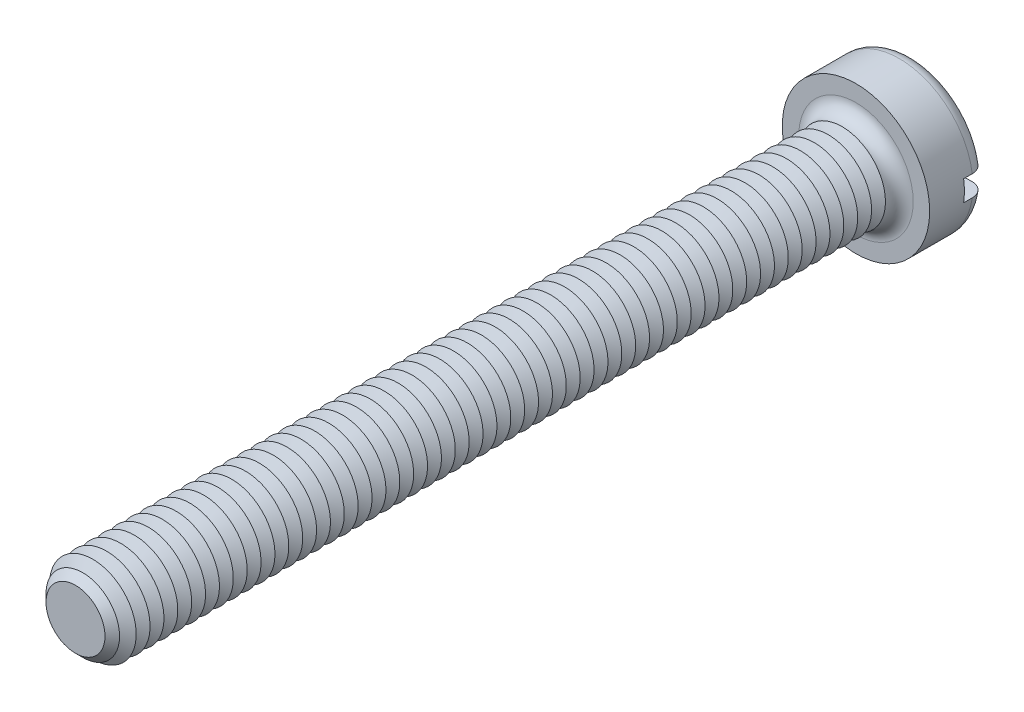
ISO-10303-21;
HEADER;
FILE_DESCRIPTION(('STEP AP214'),'2;1');
FILE_NAME('part.step','',(''),(''),'','','');
FILE_SCHEMA(('AUTOMOTIVE_DESIGN { 1 0 10303 214 1 1 1 1 }'));
ENDSEC;
DATA;
#1=APPLICATION_CONTEXT('core data for automotive mechanical design processes');
#2=APPLICATION_PROTOCOL_DEFINITION('international standard','automotive_design',2000,#1);
#3=PRODUCT_CONTEXT('',#1,'mechanical');
#4=PRODUCT('Part','Part','',(#3));
#5=PRODUCT_RELATED_PRODUCT_CATEGORY('part','',(#4));
#6=PRODUCT_DEFINITION_FORMATION('','',#4);
#7=PRODUCT_DEFINITION_CONTEXT('part definition',#1,'design');
#8=PRODUCT_DEFINITION('design','',#6,#7);
#9=PRODUCT_DEFINITION_SHAPE('','',#8);
#10=(LENGTH_UNIT() NAMED_UNIT(*) SI_UNIT(.MILLI.,.METRE.));
#11=(NAMED_UNIT(*) PLANE_ANGLE_UNIT() SI_UNIT($,.RADIAN.));
#12=(NAMED_UNIT(*) SI_UNIT($,.STERADIAN.) SOLID_ANGLE_UNIT());
#13=UNCERTAINTY_MEASURE_WITH_UNIT(LENGTH_MEASURE(1.E-05),#10,'distance_accuracy_value','');
#14=(GEOMETRIC_REPRESENTATION_CONTEXT(3) GLOBAL_UNCERTAINTY_ASSIGNED_CONTEXT((#13)) GLOBAL_UNIT_ASSIGNED_CONTEXT((#10,
#11,#12)) REPRESENTATION_CONTEXT('',''));
#15=CARTESIAN_POINT('',(0.,0.,0.));
#16=DIRECTION('',(0.,0.,1.));
#17=DIRECTION('',(1.,0.,0.));
#18=AXIS2_PLACEMENT_3D('',#15,#16,#17);
#19=CARTESIAN_POINT('',(0.,0.,-3.3));
#20=DIRECTION('',(0.,0.,1.));
#21=DIRECTION('',(1.,0.,0.));
#22=AXIS2_PLACEMENT_3D('',#19,#20,#21);
#23=PLANE('',#22);
#24=CARTESIAN_POINT('',(0.,0.,-3.3));
#25=DIRECTION('',(0.,0.,1.));
#26=DIRECTION('',(1.,0.,0.));
#27=AXIS2_PLACEMENT_3D('',#24,#25,#26);
#28=CIRCLE('',#27,3.45);
#29=CARTESIAN_POINT('',(-3.39742549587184,0.6,-3.3));
#30=VERTEX_POINT('',#29);
#31=CARTESIAN_POINT('',(3.39742549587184,0.6,-3.3));
#32=VERTEX_POINT('',#31);
#33=EDGE_CURVE('E116',#30,#32,#28,.F.);
#34=ORIENTED_EDGE('',*,*,#33,.T.);
#35=DIRECTION('',(1.,0.,0.));
#36=VECTOR('',#35,1.);
#37=CARTESIAN_POINT('',(-4.25,0.600000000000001,-3.3));
#38=LINE('',#37,#36);
#39=EDGE_CURVE('E111',#30,#32,#38,.T.);
#40=ORIENTED_EDGE('',*,*,#39,.F.);
#41=EDGE_LOOP('',(#34,#40));
#42=FACE_BOUND('',#41,.T.);
#43=ADVANCED_FACE('F39',(#42),#23,.F.);
#44=CARTESIAN_POINT('',(0.,0.,-2.5));
#45=DIRECTION('',(0.,0.,1.));
#46=DIRECTION('',(1.,0.,0.));
#47=AXIS2_PLACEMENT_3D('',#44,#45,#46);
#48=TOROIDAL_SURFACE('',#47,3.45,0.8);
#49=CARTESIAN_POINT('',(-4.06369072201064,0.600000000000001,-2.95537828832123));
#50=CARTESIAN_POINT('',(-4.03774340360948,0.600000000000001,-2.99245078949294));
#51=CARTESIAN_POINT('',(-4.00861849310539,0.600000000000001,-3.02734231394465));
#52=CARTESIAN_POINT('',(-3.94488199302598,0.600000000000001,-3.0917502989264));
#53=CARTESIAN_POINT('',(-3.91026320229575,0.600000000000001,-3.12125959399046));
#54=CARTESIAN_POINT('',(-3.83660561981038,0.600000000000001,-3.17403695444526));
#55=CARTESIAN_POINT('',(-3.79757117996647,0.6,-3.19731109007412));
#56=CARTESIAN_POINT('',(-3.71618817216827,0.6,-3.23703443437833));
#57=CARTESIAN_POINT('',(-3.67384041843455,0.6,-3.25348531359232));
#58=CARTESIAN_POINT('',(-3.58661930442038,0.6,-3.2792758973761));
#59=CARTESIAN_POINT('',(-3.54172669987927,0.6,-3.288550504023));
#60=CARTESIAN_POINT('',(-3.45102322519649,0.6,-3.29952632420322));
#61=CARTESIAN_POINT('',(-3.40521225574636,0.6,-3.30122671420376));
#62=CARTESIAN_POINT('',(-3.31340831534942,0.6,-3.29701196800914));
#63=CARTESIAN_POINT('',(-3.26741940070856,0.6,-3.29100823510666));
#64=CARTESIAN_POINT('',(-3.17708556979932,0.6,-3.27141469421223));
#65=CARTESIAN_POINT('',(-3.13274074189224,0.6,-3.25782447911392));
#66=CARTESIAN_POINT('',(-3.0466814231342,0.6,-3.22332549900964));
#67=CARTESIAN_POINT('',(-3.00498444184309,0.6,-3.20237301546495));
#68=CARTESIAN_POINT('',(-2.92572251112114,0.6,-3.15372961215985));
#69=CARTESIAN_POINT('',(-2.88815755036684,0.6,-3.12603871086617));
#70=CARTESIAN_POINT('',(-2.81847654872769,0.6,-3.06483322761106));
#71=CARTESIAN_POINT('',(-2.78633186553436,0.6,-3.03135128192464));
#72=CARTESIAN_POINT('',(-2.72824805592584,0.6,-2.95937651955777));
#73=CARTESIAN_POINT('',(-2.70230829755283,0.6,-2.92088421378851));
#74=CARTESIAN_POINT('',(-2.65791262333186,0.6,-2.84074227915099));
#75=CARTESIAN_POINT('',(-2.63932560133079,0.6,-2.79916531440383));
#76=CARTESIAN_POINT('',(-2.60958432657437,0.6,-2.7134333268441));
#77=CARTESIAN_POINT('',(-2.59842889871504,0.6,-2.66927871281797));
#78=CARTESIAN_POINT('',(-2.58411140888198,0.6,-2.58073966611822));
#79=CARTESIAN_POINT('',(-2.58077086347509,0.6,-2.5363840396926));
#80=CARTESIAN_POINT('',(-2.58167367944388,0.6,-2.44775208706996));
#81=CARTESIAN_POINT('',(-2.58591644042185,0.6,-2.40347575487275));
#82=CARTESIAN_POINT('',(-2.60175154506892,0.6,-2.31675105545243));
#83=CARTESIAN_POINT('',(-2.61326489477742,0.6,-2.27428821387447));
#84=CARTESIAN_POINT('',(-2.6431863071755,0.6,-2.19186794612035));
#85=CARTESIAN_POINT('',(-2.66159465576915,0.6,-2.15191062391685));
#86=CARTESIAN_POINT('',(-2.70494650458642,0.6,-2.07517696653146));
#87=CARTESIAN_POINT('',(-2.72995486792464,0.6,-2.03843731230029));
#88=CARTESIAN_POINT('',(-2.7856570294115,0.6,-1.96955746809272));
#89=CARTESIAN_POINT('',(-2.81635145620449,0.6,-1.93741778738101));
#90=CARTESIAN_POINT('',(-2.88329572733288,0.6,-1.87788048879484));
#91=CARTESIAN_POINT('',(-2.91965530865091,0.6,-1.85060625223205));
#92=CARTESIAN_POINT('',(-2.9963658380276,0.6,-1.80241044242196));
#93=CARTESIAN_POINT('',(-3.03671721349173,0.6,-1.78148955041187));
#94=CARTESIAN_POINT('',(-3.12111125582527,0.6,-1.74619829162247));
#95=CARTESIAN_POINT('',(-3.16521020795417,0.6,-1.73196239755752));
#96=CARTESIAN_POINT('',(-3.25516487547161,0.6,-1.71103773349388));
#97=CARTESIAN_POINT('',(-3.30102068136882,0.6,-1.70434935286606));
#98=CARTESIAN_POINT('',(-3.39352689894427,0.6,-1.69870104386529));
#99=CARTESIAN_POINT('',(-3.44018061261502,0.6,-1.69979487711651));
#100=CARTESIAN_POINT('',(-3.53263583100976,0.6,-1.70983959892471));
#101=CARTESIAN_POINT('',(-3.57843734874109,0.6,-1.71879036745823));
#102=CARTESIAN_POINT('',(-3.66763544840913,0.6,-1.74426972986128));
#103=CARTESIAN_POINT('',(-3.71104292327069,0.6,-1.76076015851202));
#104=CARTESIAN_POINT('',(-3.79442616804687,0.6,-1.80087686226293));
#105=CARTESIAN_POINT('',(-3.83440212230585,0.600000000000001,-1.82450275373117));
#106=CARTESIAN_POINT('',(-3.90929765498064,0.600000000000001,-1.87793548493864));
#107=CARTESIAN_POINT('',(-3.94426963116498,0.600000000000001,-1.90766887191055));
#108=CARTESIAN_POINT('',(-4.00864839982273,0.600000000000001,-1.9726503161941));
#109=CARTESIAN_POINT('',(-4.03805555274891,0.600000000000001,-2.00789801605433));
#110=CARTESIAN_POINT('',(-4.09009460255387,0.600000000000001,-2.08244463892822));
#111=CARTESIAN_POINT('',(-4.11280448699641,0.600000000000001,-2.12168912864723));
#112=CARTESIAN_POINT('',(-4.15124086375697,0.600000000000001,-2.2034588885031));
#113=CARTESIAN_POINT('',(-4.16696802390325,0.600000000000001,-2.24598384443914));
#114=CARTESIAN_POINT('',(-4.19085131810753,0.600000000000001,-2.33267862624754));
#115=CARTESIAN_POINT('',(-4.19907708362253,0.600000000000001,-2.37682928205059));
#116=CARTESIAN_POINT('',(-4.2079638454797,0.600000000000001,-2.46589754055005));
#117=CARTESIAN_POINT('',(-4.20862315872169,0.600000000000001,-2.51081531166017));
#118=CARTESIAN_POINT('',(-4.20236829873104,0.600000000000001,-2.59993343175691));
#119=CARTESIAN_POINT('',(-4.19548454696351,0.600000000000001,-2.64413593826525));
#120=CARTESIAN_POINT('',(-4.17439924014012,0.600000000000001,-2.73071930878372));
#121=CARTESIAN_POINT('',(-4.16020675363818,0.600000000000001,-2.77310235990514));
#122=CARTESIAN_POINT('',(-4.1318825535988,0.600000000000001,-2.83880495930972));
#123=CARTESIAN_POINT('',(-4.11991183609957,0.600000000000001,-2.86307959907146));
#124=CARTESIAN_POINT('',(-4.09356927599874,0.600000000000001,-2.91028856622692));
#125=CARTESIAN_POINT('',(-4.07919744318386,0.600000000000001,-2.9332228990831));
#126=CARTESIAN_POINT('',(-4.06369072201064,0.600000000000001,-2.95537828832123));
#127=B_SPLINE_CURVE_WITH_KNOTS('',3,(#49,#50,#51,#52,#53,#54,#55,#56,#57,#58,#59,#60,#61,#62,
#63,#64,#65,#66,#67,#68,#69,#70,#71,#72,#73,#74,#75,#76,#77,#78,#79,#80,#81,#82,#83,#84,#85,#86,
#87,#88,#89,#90,#91,#92,#93,#94,#95,#96,#97,#98,#99,#100,#101,#102,#103,#104,#105,#106,#107,
#108,#109,#110,#111,#112,#113,#114,#115,#116,#117,#118,#119,#120,#121,#122,#123,#124,#125,#126),
.UNSPECIFIED.,.T.,.F.,(4,2,2,2,2,2,2,2,2,2,2,2,2,2,2,2,2,2,2,2,2,2,2,2,2,2,2,2,2,2,2,2,2,2,2,2,
2,2,4),(0.,0.13565225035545,0.271483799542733,0.407182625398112,0.542848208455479,
0.679730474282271,0.816627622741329,0.955113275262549,1.09360635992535,1.23293614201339,
1.37226554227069,1.51083389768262,1.64938813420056,1.78534653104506,1.92128342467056,
2.0540840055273,2.18687407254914,2.31824564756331,2.44962267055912,2.58234229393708,
2.71507659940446,2.85080630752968,2.98655056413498,3.12491938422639,3.26329534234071,
3.40262816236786,3.54195885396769,3.68059194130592,3.81921757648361,3.95626453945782,
4.09330262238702,4.2286754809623,4.36403538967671,4.49812564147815,4.63224572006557,
4.76582687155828,4.89924267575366,4.98031194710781,5.0613808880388),.UNSPECIFIED.);
#128=CARTESIAN_POINT('',(-4.20743389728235,0.600000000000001,-2.50000000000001));
#129=VERTEX_POINT('',#128);
#130=EDGE_CURVE('E625',#129,#30,#127,.T.);
#131=ORIENTED_EDGE('',*,*,#130,.F.);
#132=CARTESIAN_POINT('',(0.,0.,-2.5));
#133=DIRECTION('',(0.,0.,1.));
#134=DIRECTION('',(1.,0.,0.));
#135=AXIS2_PLACEMENT_3D('',#132,#133,#134);
#136=CIRCLE('',#135,4.25);
#137=CARTESIAN_POINT('',(4.20743389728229,0.599999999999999,-2.5));
#138=VERTEX_POINT('',#137);
#139=EDGE_CURVE('E125',#138,#129,#136,.T.);
#140=ORIENTED_EDGE('',*,*,#139,.F.);
#141=CARTESIAN_POINT('',(2.63947327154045,0.6,-2.79608831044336));
#142=CARTESIAN_POINT('',(2.65655980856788,0.6,-2.83790320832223));
#143=CARTESIAN_POINT('',(2.67725642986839,0.6,-2.87828303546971));
#144=CARTESIAN_POINT('',(2.72519250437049,0.6,-2.95500233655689));
#145=CARTESIAN_POINT('',(2.75244152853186,0.6,-2.9913357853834));
#146=CARTESIAN_POINT('',(2.81257938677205,0.6,-3.05889430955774));
#147=CARTESIAN_POINT('',(2.84545995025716,0.6,-3.09012674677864));
#148=CARTESIAN_POINT('',(2.91591143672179,0.6,-3.14672620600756));
#149=CARTESIAN_POINT('',(2.95348119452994,0.6,-3.17209468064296));
#150=CARTESIAN_POINT('',(3.03291143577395,0.6,-3.21669611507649));
#151=CARTESIAN_POINT('',(3.07483186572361,0.6,-3.23582234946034));
#152=CARTESIAN_POINT('',(3.16126659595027,0.6,-3.26686062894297));
#153=CARTESIAN_POINT('',(3.2057811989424,0.6,-3.27877183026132));
#154=CARTESIAN_POINT('',(3.29669878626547,0.6,-3.29514603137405));
#155=CARTESIAN_POINT('',(3.34311773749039,0.6,-3.29952056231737));
#156=CARTESIAN_POINT('',(3.43603189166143,0.6,-3.30040472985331));
#157=CARTESIAN_POINT('',(3.48252709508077,0.6,-3.29691431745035));
#158=CARTESIAN_POINT('',(3.57420049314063,0.6,-3.28214240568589));
#159=CARTESIAN_POINT('',(3.61938038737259,0.6,-3.27087147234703));
#160=CARTESIAN_POINT('',(3.70717477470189,0.6,-3.24082890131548));
#161=CARTESIAN_POINT('',(3.74978938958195,0.6,-3.22205762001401));
#162=CARTESIAN_POINT('',(3.83078828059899,0.6,-3.17773607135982));
#163=CARTESIAN_POINT('',(3.86921015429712,0.599999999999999,-3.15225453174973));
#164=CARTESIAN_POINT('',(3.94116038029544,0.599999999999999,-3.09512672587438));
#165=CARTESIAN_POINT('',(3.9746890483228,0.599999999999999,-3.06348085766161));
#166=CARTESIAN_POINT('',(4.03545911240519,0.599999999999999,-2.99534640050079));
#167=CARTESIAN_POINT('',(4.06277344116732,0.599999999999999,-2.95892285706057));
#168=CARTESIAN_POINT('',(4.11082191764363,0.599999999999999,-2.88196698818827));
#169=CARTESIAN_POINT('',(4.13155647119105,0.599999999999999,-2.84143491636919));
#170=CARTESIAN_POINT('',(4.16563480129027,0.599999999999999,-2.75787550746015));
#171=CARTESIAN_POINT('',(4.1790544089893,0.599999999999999,-2.71487908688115));
#172=CARTESIAN_POINT('',(4.19843340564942,0.599999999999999,-2.62723691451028));
#173=CARTESIAN_POINT('',(4.20439310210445,0.599999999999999,-2.58259123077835));
#174=CARTESIAN_POINT('',(4.2086595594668,0.599999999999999,-2.49321831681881));
#175=CARTESIAN_POINT('',(4.20701422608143,0.599999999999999,-2.4484933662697));
#176=CARTESIAN_POINT('',(4.1962295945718,0.599999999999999,-2.35995704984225));
#177=CARTESIAN_POINT('',(4.18709040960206,0.599999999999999,-2.31614567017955));
#178=CARTESIAN_POINT('',(4.16160290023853,0.599999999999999,-2.23072100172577));
#179=CARTESIAN_POINT('',(4.14526169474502,0.599999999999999,-2.18910558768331));
#180=CARTESIAN_POINT('',(4.10585410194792,0.599999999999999,-2.10919238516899));
#181=CARTESIAN_POINT('',(4.08278762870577,0.599999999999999,-2.07089463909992));
#182=CARTESIAN_POINT('',(4.030487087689,0.599999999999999,-1.99851484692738));
#183=CARTESIAN_POINT('',(4.00122628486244,0.599999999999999,-1.9644521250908));
#184=CARTESIAN_POINT('',(3.93744772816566,0.599999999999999,-1.90166877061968));
#185=CARTESIAN_POINT('',(3.90292977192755,0.599999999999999,-1.87294834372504));
#186=CARTESIAN_POINT('',(3.82928727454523,0.599999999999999,-1.82137853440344));
#187=CARTESIAN_POINT('',(3.79012374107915,0.6,-1.79858484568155));
#188=CARTESIAN_POINT('',(3.70856025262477,0.6,-1.75980712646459));
#189=CARTESIAN_POINT('',(3.66616010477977,0.6,-1.74382350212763));
#190=CARTESIAN_POINT('',(3.57878495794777,0.6,-1.71891499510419));
#191=CARTESIAN_POINT('',(3.53378519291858,0.6,-1.71007699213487));
#192=CARTESIAN_POINT('',(3.44294322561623,0.6,-1.69998722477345));
#193=CARTESIAN_POINT('',(3.3971009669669,0.6,-1.69873596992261));
#194=CARTESIAN_POINT('',(3.30531297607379,0.6,-1.70385439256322));
#195=CARTESIAN_POINT('',(3.25937213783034,0.6,-1.71031204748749));
#196=CARTESIAN_POINT('',(3.1692099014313,0.6,-1.73080107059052));
#197=CARTESIAN_POINT('',(3.12498860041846,0.6,-1.74483286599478));
#198=CARTESIAN_POINT('',(3.03926209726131,0.6,-1.78018941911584));
#199=CARTESIAN_POINT('',(2.99777407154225,0.6,-1.80155586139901));
#200=CARTESIAN_POINT('',(2.91899881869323,0.6,-1.85098881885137));
#201=CARTESIAN_POINT('',(2.88171158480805,0.6,-1.8790553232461));
#202=CARTESIAN_POINT('',(2.81266124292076,0.6,-1.94094884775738));
#203=CARTESIAN_POINT('',(2.78086710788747,0.6,-1.97474122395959));
#204=CARTESIAN_POINT('',(2.72353615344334,0.6,-2.0472724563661));
#205=CARTESIAN_POINT('',(2.69799841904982,0.6,-2.08601058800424));
#206=CARTESIAN_POINT('',(2.65444718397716,0.6,-2.16655019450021));
#207=CARTESIAN_POINT('',(2.63629889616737,0.6,-2.20827875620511));
#208=CARTESIAN_POINT('',(2.60744942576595,0.6,-2.29424821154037));
#209=CARTESIAN_POINT('',(2.59674901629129,0.6,-2.33848936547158));
#210=CARTESIAN_POINT('',(2.5833312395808,0.6,-2.42714258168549));
#211=CARTESIAN_POINT('',(2.58043995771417,0.6,-2.47152848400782));
#212=CARTESIAN_POINT('',(2.58224493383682,0.6,-2.56010574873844));
#213=CARTESIAN_POINT('',(2.58693104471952,0.6,-2.60429729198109));
#214=CARTESIAN_POINT('',(2.60020046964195,0.6,-2.67311978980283));
#215=CARTESIAN_POINT('',(2.60635343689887,0.6,-2.69824441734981));
#216=CARTESIAN_POINT('',(2.62110140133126,0.6,-2.74776540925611));
#217=CARTESIAN_POINT('',(2.62969634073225,0.6,-2.77216179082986));
#218=CARTESIAN_POINT('',(2.63947327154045,0.6,-2.79608831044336));
#219=B_SPLINE_CURVE_WITH_KNOTS('',3,(#141,#142,#143,#144,#145,#146,#147,#148,#149,#150,#151,
#152,#153,#154,#155,#156,#157,#158,#159,#160,#161,#162,#163,#164,#165,#166,#167,#168,#169,#170,
#171,#172,#173,#174,#175,#176,#177,#178,#179,#180,#181,#182,#183,#184,#185,#186,#187,#188,#189,
#190,#191,#192,#193,#194,#195,#196,#197,#198,#199,#200,#201,#202,#203,#204,#205,#206,#207,#208,
#209,#210,#211,#212,#213,#214,#215,#216,#217,#218),.UNSPECIFIED.,.T.,.F.,(4,2,2,2,2,2,2,2,2,2,2,
2,2,2,2,2,2,2,2,2,2,2,2,2,2,2,2,2,2,2,2,2,2,2,2,2,2,2,4),(0.,0.135416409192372,
0.271031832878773,0.406449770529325,0.541834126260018,0.679424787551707,0.817031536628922,
0.956242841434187,1.09545501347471,1.23447850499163,1.37349539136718,1.51114036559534,
1.64877645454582,1.78470267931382,1.92062051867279,2.05510117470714,2.1895762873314,
2.32320547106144,2.45683263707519,2.59032801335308,2.72382509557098,2.85791055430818,
2.99200117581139,3.12730969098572,3.26262627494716,3.39956435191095,3.53651162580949,
3.67503685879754,3.81356990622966,3.95290367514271,4.09223721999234,4.23075602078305,
4.36925455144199,4.50509949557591,4.6409585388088,4.77376594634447,4.90639565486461,
4.98388287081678,5.06136825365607),.UNSPECIFIED.);
#220=EDGE_CURVE('E627',#32,#138,#219,.T.);
#221=ORIENTED_EDGE('',*,*,#220,.F.);
#222=ORIENTED_EDGE('',*,*,#33,.F.);
#223=EDGE_LOOP('',(#131,#140,#221,#222));
#224=FACE_BOUND('',#223,.T.);
#225=ADVANCED_FACE('F609',(#224),#48,.T.);
#226=CARTESIAN_POINT('',(0.,0.,-3.3));
#227=DIRECTION('',(0.,0.,1.));
#228=DIRECTION('',(1.,0.,0.));
#229=AXIS2_PLACEMENT_3D('',#226,#227,#228);
#230=CYLINDRICAL_SURFACE('',#229,4.25);
#231=DIRECTION('',(0.,0.,1.));
#232=VECTOR('',#231,1.);
#233=CARTESIAN_POINT('',(4.20743389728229,0.599999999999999,-3.3));
#234=LINE('',#233,#232);
#235=CARTESIAN_POINT('',(4.20743389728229,0.599999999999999,-2.));
#236=VERTEX_POINT('',#235);
#237=EDGE_CURVE('E643',#138,#236,#234,.T.);
#238=ORIENTED_EDGE('',*,*,#237,.F.);
#239=ORIENTED_EDGE('',*,*,#139,.T.);
#240=DIRECTION('',(0.,0.,1.));
#241=VECTOR('',#240,1.);
#242=CARTESIAN_POINT('',(-4.20743389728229,0.600000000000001,-3.3));
#243=LINE('',#242,#241);
#244=CARTESIAN_POINT('',(-4.20743389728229,0.600000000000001,-2.));
#245=VERTEX_POINT('',#244);
#246=EDGE_CURVE('E63',#245,#129,#243,.F.);
#247=ORIENTED_EDGE('',*,*,#246,.F.);
#248=CARTESIAN_POINT('',(0.,0.,-2.));
#249=DIRECTION('',(0.,0.,-1.));
#250=DIRECTION('',(-1.,0.,0.));
#251=AXIS2_PLACEMENT_3D('',#248,#249,#250);
#252=CIRCLE('',#251,4.25);
#253=CARTESIAN_POINT('',(-4.20743389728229,-0.599999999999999,-2.));
#254=VERTEX_POINT('',#253);
#255=EDGE_CURVE('E43',#245,#254,#252,.F.);
#256=ORIENTED_EDGE('',*,*,#255,.T.);
#257=DIRECTION('',(0.,0.,1.));
#258=VECTOR('',#257,1.);
#259=CARTESIAN_POINT('',(-4.20743389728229,-0.599999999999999,-3.3));
#260=LINE('',#259,#258);
#261=CARTESIAN_POINT('',(-4.20743389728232,-0.599999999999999,-2.5));
#262=VERTEX_POINT('',#261);
#263=EDGE_CURVE('E640',#262,#254,#260,.T.);
#264=ORIENTED_EDGE('',*,*,#263,.F.);
#265=CARTESIAN_POINT('',(4.20743389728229,-0.600000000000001,-2.5));
#266=VERTEX_POINT('',#265);
#267=EDGE_CURVE('E127',#262,#266,#136,.T.);
#268=ORIENTED_EDGE('',*,*,#267,.T.);
#269=DIRECTION('',(0.,0.,1.));
#270=VECTOR('',#269,1.);
#271=CARTESIAN_POINT('',(4.20743389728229,-0.600000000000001,-3.3));
#272=LINE('',#271,#270);
#273=CARTESIAN_POINT('',(4.20743389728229,-0.600000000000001,-2.));
#274=VERTEX_POINT('',#273);
#275=EDGE_CURVE('E55',#274,#266,#272,.F.);
#276=ORIENTED_EDGE('',*,*,#275,.F.);
#277=EDGE_CURVE('E11',#274,#236,#252,.F.);
#278=ORIENTED_EDGE('',*,*,#277,.T.);
#279=EDGE_LOOP('',(#238,#239,#247,#256,#264,#268,#276,#278));
#280=FACE_BOUND('',#279,.T.);
#281=CARTESIAN_POINT('',(0.,0.,0.));
#282=DIRECTION('',(0.,0.,1.));
#283=DIRECTION('',(1.,0.,0.));
#284=AXIS2_PLACEMENT_3D('',#281,#282,#283);
#285=CIRCLE('',#284,4.25);
#286=CARTESIAN_POINT('',(4.25,0.,0.));
#287=VERTEX_POINT('',#286);
#288=EDGE_CURVE('E646',#287,#287,#285,.T.);
#289=ORIENTED_EDGE('',*,*,#288,.F.);
#290=EDGE_LOOP('',(#289));
#291=FACE_BOUND('',#290,.T.);
#292=ADVANCED_FACE('F605',(#280,#291),#230,.T.);
#293=CARTESIAN_POINT('',(3.39742549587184,-0.6,-3.3));
#294=VERTEX_POINT('',#293);
#295=CARTESIAN_POINT('',(-3.39742549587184,-0.6,-3.3));
#296=VERTEX_POINT('',#295);
#297=EDGE_CURVE('E109',#294,#296,#28,.F.);
#298=ORIENTED_EDGE('',*,*,#297,.T.);
#299=DIRECTION('',(-1.,0.,0.));
#300=VECTOR('',#299,1.);
#301=CARTESIAN_POINT('',(-4.25,-0.599999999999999,-3.3));
#302=LINE('',#301,#300);
#303=EDGE_CURVE('E96',#294,#296,#302,.T.);
#304=ORIENTED_EDGE('',*,*,#303,.F.);
#305=EDGE_LOOP('',(#298,#304));
#306=FACE_BOUND('',#305,.T.);
#307=ADVANCED_FACE('F108',(#306),#23,.F.);
#308=CARTESIAN_POINT('',(0.,0.,0.));
#309=DIRECTION('',(0.,0.,1.));
#310=DIRECTION('',(1.,0.,0.));
#311=AXIS2_PLACEMENT_3D('',#308,#309,#310);
#312=PLANE('',#311);
#313=CARTESIAN_POINT('',(0.,0.,0.));
#314=DIRECTION('',(0.,0.,1.));
#315=DIRECTION('',(1.,0.,0.));
#316=AXIS2_PLACEMENT_3D('',#313,#314,#315);
#317=CIRCLE('',#316,3.3);
#318=CARTESIAN_POINT('',(3.3,0.,0.));
#319=VERTEX_POINT('',#318);
#320=EDGE_CURVE('E115',#319,#319,#317,.F.);
#321=ORIENTED_EDGE('',*,*,#320,.T.);
#322=EDGE_LOOP('',(#321));
#323=FACE_BOUND('',#322,.T.);
#324=ORIENTED_EDGE('',*,*,#288,.T.);
#325=EDGE_LOOP('',(#324));
#326=FACE_BOUND('',#325,.T.);
#327=ADVANCED_FACE('F604',(#323,#326),#312,.T.);
#328=CARTESIAN_POINT('',(-4.06369072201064,-0.599999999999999,-2.95537828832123));
#329=CARTESIAN_POINT('',(-4.08928577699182,-0.599999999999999,-2.91880204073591));
#330=CARTESIAN_POINT('',(-4.11182555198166,-0.599999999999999,-2.88005030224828));
#331=CARTESIAN_POINT('',(-4.15010404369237,-0.599999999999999,-2.79928452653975));
#332=CARTESIAN_POINT('',(-4.16583526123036,-0.599999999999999,-2.75726695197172));
#333=CARTESIAN_POINT('',(-4.19000286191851,-0.599999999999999,-2.67118996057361));
#334=CARTESIAN_POINT('',(-4.19844101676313,-0.599999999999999,-2.62713104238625));
#335=CARTESIAN_POINT('',(-4.20777174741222,-0.599999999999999,-2.53823222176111));
#336=CARTESIAN_POINT('',(-4.20866608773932,-0.599999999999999,-2.49339250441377));
#337=CARTESIAN_POINT('',(-4.20289683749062,-0.599999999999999,-2.40433856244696));
#338=CARTESIAN_POINT('',(-4.19625607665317,-0.599999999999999,-2.36012285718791));
#339=CARTESIAN_POINT('',(-4.17565084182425,-0.599999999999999,-2.27343166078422));
#340=CARTESIAN_POINT('',(-4.16168615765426,-0.599999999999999,-2.23095621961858));
#341=CARTESIAN_POINT('',(-4.12683188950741,-0.599999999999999,-2.14890863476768));
#342=CARTESIAN_POINT('',(-4.10593663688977,-0.599999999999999,-2.10933890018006));
#343=CARTESIAN_POINT('',(-4.05783763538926,-0.599999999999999,-2.03424145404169));
#344=CARTESIAN_POINT('',(-4.03063375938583,-0.599999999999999,-1.99871382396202));
#345=CARTESIAN_POINT('',(-3.97052236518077,-0.599999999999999,-1.93246905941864));
#346=CARTESIAN_POINT('',(-3.93758114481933,-0.599999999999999,-1.90178251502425));
#347=CARTESIAN_POINT('',(-3.86706007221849,-0.599999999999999,-1.84630837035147));
#348=CARTESIAN_POINT('',(-3.82948001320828,-0.6,-1.82152103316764));
#349=CARTESIAN_POINT('',(-3.75033766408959,-0.6,-1.77826995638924));
#350=CARTESIAN_POINT('',(-3.70873831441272,-0.6,-1.7598740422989));
#351=CARTESIAN_POINT('',(-3.62306661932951,-0.6,-1.73023196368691));
#352=CARTESIAN_POINT('',(-3.57899411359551,-0.6,-1.71898626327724));
#353=CARTESIAN_POINT('',(-3.48904845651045,-0.6,-1.70382025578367));
#354=CARTESIAN_POINT('',(-3.44315982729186,-0.6,-1.69999172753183));
#355=CARTESIAN_POINT('',(-3.35138360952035,-0.6,-1.7000083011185));
#356=CARTESIAN_POINT('',(-3.30549602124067,-0.6,-1.70385391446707));
#357=CARTESIAN_POINT('',(-3.21452492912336,-0.6,-1.71917227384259));
#358=CARTESIAN_POINT('',(-3.16945455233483,-0.6,-1.73072307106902));
#359=CARTESIAN_POINT('',(-3.08188104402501,-0.6,-1.76120640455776));
#360=CARTESIAN_POINT('',(-3.0393780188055,-0.6,-1.78013924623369));
#361=CARTESIAN_POINT('',(-2.95805296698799,-0.6,-1.82493384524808));
#362=CARTESIAN_POINT('',(-2.9192403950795,-0.6,-1.85081278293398));
#363=CARTESIAN_POINT('',(-2.84656695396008,-0.6,-1.90878317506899));
#364=CARTESIAN_POINT('',(-2.81270591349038,-0.6,-1.94087441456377));
#365=CARTESIAN_POINT('',(-2.75131050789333,-0.6,-2.01002500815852));
#366=CARTESIAN_POINT('',(-2.72371339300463,-0.6,-2.04702860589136));
#367=CARTESIAN_POINT('',(-2.67528742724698,-0.6,-2.12522869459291));
#368=CARTESIAN_POINT('',(-2.65445765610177,-0.6,-2.1664246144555));
#369=CARTESIAN_POINT('',(-2.62065354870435,-0.6,-2.25087266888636));
#370=CARTESIAN_POINT('',(-2.60751663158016,-0.6,-2.29405971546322));
#371=CARTESIAN_POINT('',(-2.58885106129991,-0.6,-2.38204659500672));
#372=CARTESIAN_POINT('',(-2.58332131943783,-0.6,-2.42684619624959));
#373=CARTESIAN_POINT('',(-2.58009777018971,-0.6,-2.51580379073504));
#374=CARTESIAN_POINT('',(-2.58224575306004,-0.6,-2.55995612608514));
#375=CARTESIAN_POINT('',(-2.59395205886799,-0.6,-2.64726495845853));
#376=CARTESIAN_POINT('',(-2.60351013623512,-0.6,-2.69042148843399));
#377=CARTESIAN_POINT('',(-2.62967159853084,-0.6,-2.77438771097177));
#378=CARTESIAN_POINT('',(-2.64625243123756,-0.6,-2.81520444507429));
#379=CARTESIAN_POINT('',(-2.68592348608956,-0.6,-2.89353901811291));
#380=CARTESIAN_POINT('',(-2.70901418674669,-0.6,-2.9310566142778));
#381=CARTESIAN_POINT('',(-2.7614318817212,-0.6,-3.00240040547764));
#382=CARTESIAN_POINT('',(-2.79085487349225,-0.6,-3.03615603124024));
#383=CARTESIAN_POINT('',(-2.85483456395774,-0.6,-3.09838834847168));
#384=CARTESIAN_POINT('',(-2.88939187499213,-0.6,-3.12686440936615));
#385=CARTESIAN_POINT('',(-2.96351967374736,-0.6,-3.17841283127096));
#386=CARTESIAN_POINT('',(-3.00318741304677,-0.6,-3.20134539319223));
#387=CARTESIAN_POINT('',(-3.08576649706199,-0.6,-3.24034364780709));
#388=CARTESIAN_POINT('',(-3.12867814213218,-0.6,-3.25640870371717));
#389=CARTESIAN_POINT('',(-3.21724048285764,-0.6,-3.28143816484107));
#390=CARTESIAN_POINT('',(-3.26292314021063,-0.6,-3.29028963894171));
#391=CARTESIAN_POINT('',(-3.35512527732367,-0.6,-3.30021681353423));
#392=CARTESIAN_POINT('',(-3.40164474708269,-0.6,-3.30129260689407));
#393=CARTESIAN_POINT('',(-3.49429978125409,-0.6,-3.29560589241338));
#394=CARTESIAN_POINT('',(-3.54043436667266,-0.6,-3.28882735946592));
#395=CARTESIAN_POINT('',(-3.63090382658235,-0.6,-3.26755492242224));
#396=CARTESIAN_POINT('',(-3.67523831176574,-0.6,-3.25305935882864));
#397=CARTESIAN_POINT('',(-3.76046509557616,-0.6,-3.21686867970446));
#398=CARTESIAN_POINT('',(-3.80138087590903,-0.599999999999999,-3.1952288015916));
#399=CARTESIAN_POINT('',(-3.8788986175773,-0.599999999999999,-3.14531817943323));
#400=CARTESIAN_POINT('',(-3.91550599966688,-0.599999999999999,-3.11705590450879));
#401=CARTESIAN_POINT('',(-3.97074313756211,-0.599999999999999,-3.06628809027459));
#402=CARTESIAN_POINT('',(-3.99100743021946,-0.599999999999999,-3.04553102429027));
#403=CARTESIAN_POINT('',(-4.02917385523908,-0.599999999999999,-3.00194762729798));
#404=CARTESIAN_POINT('',(-4.04707600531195,-0.599999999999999,-2.97912131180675));
#405=CARTESIAN_POINT('',(-4.06369072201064,-0.599999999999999,-2.95537828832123));
#406=B_SPLINE_CURVE_WITH_KNOTS('',3,(#328,#329,#330,#331,#332,#333,#334,#335,#336,#337,#338,
#339,#340,#341,#342,#343,#344,#345,#346,#347,#348,#349,#350,#351,#352,#353,#354,#355,#356,#357,
#358,#359,#360,#361,#362,#363,#364,#365,#366,#367,#368,#369,#370,#371,#372,#373,#374,#375,#376,
#377,#378,#379,#380,#381,#382,#383,#384,#385,#386,#387,#388,#389,#390,#391,#392,#393,#394,#395,
#396,#397,#398,#399,#400,#401,#402,#403,#404,#405),.UNSPECIFIED.,.T.,.F.,(4,2,2,2,2,2,2,2,2,2,2,
2,2,2,2,2,2,2,2,2,2,2,2,2,2,2,2,2,2,2,2,2,2,2,2,2,2,2,4),(0.,0.133821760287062,
0.267790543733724,0.401726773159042,0.535631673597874,0.669131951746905,0.802636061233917,
0.936249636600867,1.06986590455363,1.2042952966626,1.3387306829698,1.47455198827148,
1.61038210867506,1.74788249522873,1.88539204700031,2.02431612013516,2.16324594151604,
2.30252260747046,2.4417944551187,2.57960263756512,2.71739207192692,2.85215325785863,
2.98689515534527,3.11887666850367,3.25085380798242,3.38241030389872,3.51397647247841,
3.64769871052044,3.78143690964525,3.91826005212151,4.05509587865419,4.19403485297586,
4.33297216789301,4.47219345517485,4.61144469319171,4.74964356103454,4.887666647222,
4.97453605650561,5.06140481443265),.UNSPECIFIED.);
#407=EDGE_CURVE('E103',#296,#262,#406,.T.);
#408=ORIENTED_EDGE('',*,*,#407,.F.);
#409=ORIENTED_EDGE('',*,*,#297,.F.);
#410=CARTESIAN_POINT('',(2.63947327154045,-0.6,-2.79608831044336));
#411=CARTESIAN_POINT('',(2.62285766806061,-0.6,-2.75541510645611));
#412=CARTESIAN_POINT('',(2.60963282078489,-0.6,-2.71332585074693));
#413=CARTESIAN_POINT('',(2.59042394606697,-0.6,-2.62749460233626));
#414=CARTESIAN_POINT('',(2.58444686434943,-0.6,-2.58375106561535));
#415=CARTESIAN_POINT('',(2.57995287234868,-0.6,-2.49588524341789));
#416=CARTESIAN_POINT('',(2.58143477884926,-0.6,-2.45176301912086));
#417=CARTESIAN_POINT('',(2.59180622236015,-0.6,-2.36440906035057));
#418=CARTESIAN_POINT('',(2.60069434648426,-0.6,-2.32117715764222));
#419=CARTESIAN_POINT('',(2.62554964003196,-0.6,-2.23689909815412));
#420=CARTESIAN_POINT('',(2.6415022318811,-0.6,-2.19584863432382));
#421=CARTESIAN_POINT('',(2.67996913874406,-0.6,-2.11694797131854));
#422=CARTESIAN_POINT('',(2.70248409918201,-0.6,-2.07909808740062));
#423=CARTESIAN_POINT('',(2.75378972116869,-0.6,-2.00702296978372));
#424=CARTESIAN_POINT('',(2.7826732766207,-0.6,-1.97286389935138));
#425=CARTESIAN_POINT('',(2.84564717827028,-0.6,-1.90974167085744));
#426=CARTESIAN_POINT('',(2.87973812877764,-0.6,-1.88077911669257));
#427=CARTESIAN_POINT('',(2.95300941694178,-0.6,-1.82817307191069));
#428=CARTESIAN_POINT('',(2.99228920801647,-0.6,-1.8046680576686));
#429=CARTESIAN_POINT('',(3.07419050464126,-0.6,-1.76446470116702));
#430=CARTESIAN_POINT('',(3.11681231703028,-0.6,-1.74776698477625));
#431=CARTESIAN_POINT('',(3.20492149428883,-0.6,-1.72140945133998));
#432=CARTESIAN_POINT('',(3.25044365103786,-0.6,-1.71186578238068));
#433=CARTESIAN_POINT('',(3.34244451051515,-0.6,-1.70053183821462));
#434=CARTESIAN_POINT('',(3.38892324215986,-0.6,-1.69874179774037));
#435=CARTESIAN_POINT('',(3.48165030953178,-0.6,-1.70299737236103));
#436=CARTESIAN_POINT('',(3.52789766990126,-0.6,-1.70906439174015));
#437=CARTESIAN_POINT('',(3.61869999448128,-0.6,-1.72893768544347));
#438=CARTESIAN_POINT('',(3.6632550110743,-0.6,-1.742743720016));
#439=CARTESIAN_POINT('',(3.7490339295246,-0.6,-1.77760539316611));
#440=CARTESIAN_POINT('',(3.79028083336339,-0.600000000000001,-1.79860440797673));
#441=CARTESIAN_POINT('',(3.86860401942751,-0.600000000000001,-1.84731105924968));
#442=CARTESIAN_POINT('',(3.90568056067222,-0.600000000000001,-1.87501827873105));
#443=CARTESIAN_POINT('',(3.97412845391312,-0.600000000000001,-1.93599408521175));
#444=CARTESIAN_POINT('',(4.00556369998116,-0.600000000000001,-1.96919094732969));
#445=CARTESIAN_POINT('',(4.06233546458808,-0.600000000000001,-2.0404445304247));
#446=CARTESIAN_POINT('',(4.08767237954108,-0.600000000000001,-2.07850093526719));
#447=CARTESIAN_POINT('',(4.13122502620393,-0.600000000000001,-2.15791791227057));
#448=CARTESIAN_POINT('',(4.14951966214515,-0.600000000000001,-2.19923522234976));
#449=CARTESIAN_POINT('',(4.17884974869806,-0.600000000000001,-2.28437065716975));
#450=CARTESIAN_POINT('',(4.18988555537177,-0.600000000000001,-2.32818865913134));
#451=CARTESIAN_POINT('',(4.20430724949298,-0.600000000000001,-2.41670951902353));
#452=CARTESIAN_POINT('',(4.2077528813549,-0.600000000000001,-2.46140265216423));
#453=CARTESIAN_POINT('',(4.20706844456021,-0.600000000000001,-2.55073028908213));
#454=CARTESIAN_POINT('',(4.20293856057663,-0.600000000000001,-2.595364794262));
#455=CARTESIAN_POINT('',(4.18724926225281,-0.600000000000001,-2.68317733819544));
#456=CARTESIAN_POINT('',(4.17571081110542,-0.600000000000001,-2.72635912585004));
#457=CARTESIAN_POINT('',(4.14556645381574,-0.600000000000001,-2.81017999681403));
#458=CARTESIAN_POINT('',(4.12696052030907,-0.600000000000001,-2.85081907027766));
#459=CARTESIAN_POINT('',(4.08317014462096,-0.600000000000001,-2.92852328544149));
#460=CARTESIAN_POINT('',(4.0579684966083,-0.600000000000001,-2.96557872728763));
#461=CARTESIAN_POINT('',(4.00174565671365,-0.600000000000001,-3.034972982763));
#462=CARTESIAN_POINT('',(3.97072429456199,-0.600000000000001,-3.06731165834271));
#463=CARTESIAN_POINT('',(3.90349659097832,-0.600000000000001,-3.12662735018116));
#464=CARTESIAN_POINT('',(3.86725240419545,-0.600000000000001,-3.15356146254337));
#465=CARTESIAN_POINT('',(3.79079809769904,-0.600000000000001,-3.20104156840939));
#466=CARTESIAN_POINT('',(3.75058775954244,-0.6,-3.22158720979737));
#467=CARTESIAN_POINT('',(3.6668595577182,-0.6,-3.25595832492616));
#468=CARTESIAN_POINT('',(3.62330947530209,-0.6,-3.26970530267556));
#469=CARTESIAN_POINT('',(3.53453348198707,-0.6,-3.28979004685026));
#470=CARTESIAN_POINT('',(3.48930745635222,-0.6,-3.29612730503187));
#471=CARTESIAN_POINT('',(3.39787506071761,-0.6,-3.30128612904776));
#472=CARTESIAN_POINT('',(3.35166346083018,-0.6,-3.30001513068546));
#473=CARTESIAN_POINT('',(3.26009663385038,-0.6,-3.28980210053));
#474=CARTESIAN_POINT('',(3.21474142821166,-0.6,-3.28085987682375));
#475=CARTESIAN_POINT('',(3.12577990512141,-0.6,-3.2554540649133));
#476=CARTESIAN_POINT('',(3.08219120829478,-0.6,-3.23892872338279));
#477=CARTESIAN_POINT('',(2.99839730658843,-0.6,-3.1987810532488));
#478=CARTESIAN_POINT('',(2.95819301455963,-0.6,-3.17515681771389));
#479=CARTESIAN_POINT('',(2.88239372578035,-0.6,-3.12147666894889));
#480=CARTESIAN_POINT('',(2.84679445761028,-0.6,-3.09142678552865));
#481=CARTESIAN_POINT('',(2.78127483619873,-0.6,-3.02571584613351));
#482=CARTESIAN_POINT('',(2.75134725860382,-0.6,-2.99006203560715));
#483=CARTESIAN_POINT('',(2.70767232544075,-0.6,-2.92780516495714));
#484=CARTESIAN_POINT('',(2.69197340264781,-0.6,-2.90254809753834));
#485=CARTESIAN_POINT('',(2.66349078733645,-0.6,-2.8504392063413));
#486=CARTESIAN_POINT('',(2.65070705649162,-0.6,-2.82358740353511));
#487=CARTESIAN_POINT('',(2.63947327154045,-0.6,-2.79608831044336));
#488=B_SPLINE_CURVE_WITH_KNOTS('',3,(#410,#411,#412,#413,#414,#415,#416,#417,#418,#419,#420,
#421,#422,#423,#424,#425,#426,#427,#428,#429,#430,#431,#432,#433,#434,#435,#436,#437,#438,#439,
#440,#441,#442,#443,#444,#445,#446,#447,#448,#449,#450,#451,#452,#453,#454,#455,#456,#457,#458,
#459,#460,#461,#462,#463,#464,#465,#466,#467,#468,#469,#470,#471,#472,#473,#474,#475,#476,#477,
#478,#479,#480,#481,#482,#483,#484,#485,#486,#487),.UNSPECIFIED.,.T.,.F.,(4,2,2,2,2,2,2,2,2,2,2,
2,2,2,2,2,2,2,2,2,2,2,2,2,2,2,2,2,2,2,2,2,2,2,2,2,2,2,4),(0.,0.131701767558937,
0.263529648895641,0.395336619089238,0.527118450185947,0.658629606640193,0.790153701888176,
0.923740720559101,1.05734325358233,1.19403504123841,1.33073939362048,1.46961778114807,
1.60850037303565,1.74776210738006,1.88701952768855,2.02520497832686,2.16338184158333,
2.29987843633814,2.43636615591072,2.57127672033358,2.7061806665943,2.84001889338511,
2.97385385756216,3.1073117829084,3.24077022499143,3.37458034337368,3.50839437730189,
3.64323196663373,3.77807698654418,3.91444452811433,4.05082142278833,4.18886086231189,
4.32690375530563,4.46609131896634,4.60531630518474,4.74441121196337,4.88332773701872,
4.97237227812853,5.06141564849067),.UNSPECIFIED.);
#489=EDGE_CURVE('E92',#266,#294,#488,.T.);
#490=ORIENTED_EDGE('',*,*,#489,.F.);
#491=ORIENTED_EDGE('',*,*,#267,.F.);
#492=EDGE_LOOP('',(#408,#409,#490,#491));
#493=FACE_BOUND('',#492,.T.);
#494=ADVANCED_FACE('F113',(#493),#48,.T.);
#495=CARTESIAN_POINT('',(0.,0.,0.800000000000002));
#496=DIRECTION('',(0.,0.,1.));
#497=DIRECTION('',(1.,0.,0.));
#498=AXIS2_PLACEMENT_3D('',#495,#496,#497);
#499=TOROIDAL_SURFACE('',#498,3.3,0.8);
#500=ORIENTED_EDGE('',*,*,#320,.F.);
#501=EDGE_LOOP('',(#500));
#502=FACE_BOUND('',#501,.T.);
#503=CARTESIAN_POINT('',(0.,0.,0.800000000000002));
#504=DIRECTION('',(0.,0.,-1.));
#505=DIRECTION('',(-1.,0.,0.));
#506=AXIS2_PLACEMENT_3D('',#503,#504,#505);
#507=CIRCLE('',#506,2.5);
#508=CARTESIAN_POINT('',(-2.5,0.,0.800000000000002));
#509=VERTEX_POINT('',#508);
#510=EDGE_CURVE('E652',#509,#509,#507,.T.);
#511=ORIENTED_EDGE('',*,*,#510,.T.);
#512=EDGE_LOOP('',(#511));
#513=FACE_BOUND('',#512,.T.);
#514=ADVANCED_FACE('F597',(#502,#513),#499,.F.);
#515=CARTESIAN_POINT('',(0.,0.,1.2));
#516=DIRECTION('',(0.,0.,-1.));
#517=DIRECTION('',(-1.,0.,0.));
#518=AXIS2_PLACEMENT_3D('',#515,#516,#517);
#519=CONICAL_SURFACE('',#518,1.80717967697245,1.0471975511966);
#520=ORIENTED_EDGE('',*,*,#510,.F.);
#521=EDGE_LOOP('',(#520));
#522=FACE_BOUND('',#521,.T.);
#523=CARTESIAN_POINT('',(0.,0.,1.2));
#524=DIRECTION('',(0.,0.,-1.));
#525=DIRECTION('',(-1.,0.,0.));
#526=AXIS2_PLACEMENT_3D('',#523,#524,#525);
#527=CIRCLE('',#526,1.80717967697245);
#528=CARTESIAN_POINT('',(-1.80717967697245,0.,1.2));
#529=VERTEX_POINT('',#528);
#530=EDGE_CURVE('E658',#529,#529,#527,.T.);
#531=ORIENTED_EDGE('',*,*,#530,.T.);
#532=EDGE_LOOP('',(#531));
#533=FACE_BOUND('',#532,.T.);
#534=ADVANCED_FACE('F593',(#522,#533),#519,.T.);
#535=CARTESIAN_POINT('',(0.,0.,1.6));
#536=DIRECTION('',(0.,0.,1.));
#537=DIRECTION('',(1.,0.,0.));
#538=AXIS2_PLACEMENT_3D('',#535,#536,#537);
#539=CONICAL_SURFACE('',#538,2.5,1.0471975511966);
#540=ORIENTED_EDGE('',*,*,#530,.F.);
#541=EDGE_LOOP('',(#540));
#542=FACE_BOUND('',#541,.T.);
#543=CARTESIAN_POINT('',(0.,0.,1.6));
#544=DIRECTION('',(0.,0.,-1.));
#545=DIRECTION('',(-1.,0.,0.));
#546=AXIS2_PLACEMENT_3D('',#543,#544,#545);
#547=CIRCLE('',#546,2.5);
#548=CARTESIAN_POINT('',(-2.5,0.,1.6));
#549=VERTEX_POINT('',#548);
#550=EDGE_CURVE('E664',#549,#549,#547,.T.);
#551=ORIENTED_EDGE('',*,*,#550,.T.);
#552=EDGE_LOOP('',(#551));
#553=FACE_BOUND('',#552,.T.);
#554=ADVANCED_FACE('F589',(#542,#553),#539,.T.);
#555=CARTESIAN_POINT('',(0.,0.,2.));
#556=DIRECTION('',(0.,0.,-1.));
#557=DIRECTION('',(-1.,0.,0.));
#558=AXIS2_PLACEMENT_3D('',#555,#556,#557);
#559=CONICAL_SURFACE('',#558,1.80717967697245,1.0471975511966);
#560=ORIENTED_EDGE('',*,*,#550,.F.);
#561=EDGE_LOOP('',(#560));
#562=FACE_BOUND('',#561,.T.);
#563=CARTESIAN_POINT('',(0.,0.,2.));
#564=DIRECTION('',(0.,0.,-1.));
#565=DIRECTION('',(-1.,0.,0.));
#566=AXIS2_PLACEMENT_3D('',#563,#564,#565);
#567=CIRCLE('',#566,1.80717967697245);
#568=CARTESIAN_POINT('',(-1.80717967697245,0.,2.));
#569=VERTEX_POINT('',#568);
#570=EDGE_CURVE('E668',#569,#569,#567,.T.);
#571=ORIENTED_EDGE('',*,*,#570,.T.);
#572=EDGE_LOOP('',(#571));
#573=FACE_BOUND('',#572,.T.);
#574=ADVANCED_FACE('F585',(#562,#573),#559,.T.);
#575=CARTESIAN_POINT('',(0.,0.,2.4));
#576=DIRECTION('',(0.,0.,1.));
#577=DIRECTION('',(1.,0.,0.));
#578=AXIS2_PLACEMENT_3D('',#575,#576,#577);
#579=CONICAL_SURFACE('',#578,2.5,1.0471975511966);
#580=ORIENTED_EDGE('',*,*,#570,.F.);
#581=EDGE_LOOP('',(#580));
#582=FACE_BOUND('',#581,.T.);
#583=CARTESIAN_POINT('',(0.,0.,2.4));
#584=DIRECTION('',(0.,0.,-1.));
#585=DIRECTION('',(-1.,0.,0.));
#586=AXIS2_PLACEMENT_3D('',#583,#584,#585);
#587=CIRCLE('',#586,2.5);
#588=CARTESIAN_POINT('',(-2.5,0.,2.4));
#589=VERTEX_POINT('',#588);
#590=EDGE_CURVE('E671',#589,#589,#587,.T.);
#591=ORIENTED_EDGE('',*,*,#590,.T.);
#592=EDGE_LOOP('',(#591));
#593=FACE_BOUND('',#592,.T.);
#594=ADVANCED_FACE('F581',(#582,#593),#579,.T.);
#595=CARTESIAN_POINT('',(0.,0.,2.8));
#596=DIRECTION('',(0.,0.,-1.));
#597=DIRECTION('',(-1.,0.,0.));
#598=AXIS2_PLACEMENT_3D('',#595,#596,#597);
#599=CONICAL_SURFACE('',#598,1.80717967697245,1.0471975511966);
#600=ORIENTED_EDGE('',*,*,#590,.F.);
#601=EDGE_LOOP('',(#600));
#602=FACE_BOUND('',#601,.T.);
#603=CARTESIAN_POINT('',(0.,0.,2.8));
#604=DIRECTION('',(0.,0.,-1.));
#605=DIRECTION('',(-1.,0.,0.));
#606=AXIS2_PLACEMENT_3D('',#603,#604,#605);
#607=CIRCLE('',#606,1.80717967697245);
#608=CARTESIAN_POINT('',(-1.80717967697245,0.,2.8));
#609=VERTEX_POINT('',#608);
#610=EDGE_CURVE('E675',#609,#609,#607,.T.);
#611=ORIENTED_EDGE('',*,*,#610,.T.);
#612=EDGE_LOOP('',(#611));
#613=FACE_BOUND('',#612,.T.);
#614=ADVANCED_FACE('F577',(#602,#613),#599,.T.);
#615=CARTESIAN_POINT('',(0.,0.,3.2));
#616=DIRECTION('',(0.,0.,1.));
#617=DIRECTION('',(1.,0.,0.));
#618=AXIS2_PLACEMENT_3D('',#615,#616,#617);
#619=CONICAL_SURFACE('',#618,2.5,1.0471975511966);
#620=ORIENTED_EDGE('',*,*,#610,.F.);
#621=EDGE_LOOP('',(#620));
#622=FACE_BOUND('',#621,.T.);
#623=CARTESIAN_POINT('',(0.,0.,3.2));
#624=DIRECTION('',(0.,0.,-1.));
#625=DIRECTION('',(-1.,0.,0.));
#626=AXIS2_PLACEMENT_3D('',#623,#624,#625);
#627=CIRCLE('',#626,2.5);
#628=CARTESIAN_POINT('',(-2.5,0.,3.2));
#629=VERTEX_POINT('',#628);
#630=EDGE_CURVE('E678',#629,#629,#627,.T.);
#631=ORIENTED_EDGE('',*,*,#630,.T.);
#632=EDGE_LOOP('',(#631));
#633=FACE_BOUND('',#632,.T.);
#634=ADVANCED_FACE('F573',(#622,#633),#619,.T.);
#635=CARTESIAN_POINT('',(0.,0.,3.6));
#636=DIRECTION('',(0.,0.,-1.));
#637=DIRECTION('',(-1.,0.,0.));
#638=AXIS2_PLACEMENT_3D('',#635,#636,#637);
#639=CONICAL_SURFACE('',#638,1.80717967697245,1.0471975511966);
#640=ORIENTED_EDGE('',*,*,#630,.F.);
#641=EDGE_LOOP('',(#640));
#642=FACE_BOUND('',#641,.T.);
#643=CARTESIAN_POINT('',(0.,0.,3.6));
#644=DIRECTION('',(0.,0.,-1.));
#645=DIRECTION('',(-1.,0.,0.));
#646=AXIS2_PLACEMENT_3D('',#643,#644,#645);
#647=CIRCLE('',#646,1.80717967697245);
#648=CARTESIAN_POINT('',(-1.80717967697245,0.,3.6));
#649=VERTEX_POINT('',#648);
#650=EDGE_CURVE('E682',#649,#649,#647,.T.);
#651=ORIENTED_EDGE('',*,*,#650,.T.);
#652=EDGE_LOOP('',(#651));
#653=FACE_BOUND('',#652,.T.);
#654=ADVANCED_FACE('F569',(#642,#653),#639,.T.);
#655=CARTESIAN_POINT('',(0.,0.,4.));
#656=DIRECTION('',(0.,0.,1.));
#657=DIRECTION('',(1.,0.,0.));
#658=AXIS2_PLACEMENT_3D('',#655,#656,#657);
#659=CONICAL_SURFACE('',#658,2.5,1.0471975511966);
#660=ORIENTED_EDGE('',*,*,#650,.F.);
#661=EDGE_LOOP('',(#660));
#662=FACE_BOUND('',#661,.T.);
#663=CARTESIAN_POINT('',(0.,0.,4.));
#664=DIRECTION('',(0.,0.,-1.));
#665=DIRECTION('',(-1.,0.,0.));
#666=AXIS2_PLACEMENT_3D('',#663,#664,#665);
#667=CIRCLE('',#666,2.5);
#668=CARTESIAN_POINT('',(-2.5,0.,4.));
#669=VERTEX_POINT('',#668);
#670=EDGE_CURVE('E686',#669,#669,#667,.T.);
#671=ORIENTED_EDGE('',*,*,#670,.T.);
#672=EDGE_LOOP('',(#671));
#673=FACE_BOUND('',#672,.T.);
#674=ADVANCED_FACE('F565',(#662,#673),#659,.T.);
#675=CARTESIAN_POINT('',(0.,0.,4.4));
#676=DIRECTION('',(0.,0.,-1.));
#677=DIRECTION('',(-1.,0.,0.));
#678=AXIS2_PLACEMENT_3D('',#675,#676,#677);
#679=CONICAL_SURFACE('',#678,1.80717967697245,1.0471975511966);
#680=ORIENTED_EDGE('',*,*,#670,.F.);
#681=EDGE_LOOP('',(#680));
#682=FACE_BOUND('',#681,.T.);
#683=CARTESIAN_POINT('',(0.,0.,4.4));
#684=DIRECTION('',(0.,0.,-1.));
#685=DIRECTION('',(-1.,0.,0.));
#686=AXIS2_PLACEMENT_3D('',#683,#684,#685);
#687=CIRCLE('',#686,1.80717967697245);
#688=CARTESIAN_POINT('',(-1.80717967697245,0.,4.4));
#689=VERTEX_POINT('',#688);
#690=EDGE_CURVE('E690',#689,#689,#687,.T.);
#691=ORIENTED_EDGE('',*,*,#690,.T.);
#692=EDGE_LOOP('',(#691));
#693=FACE_BOUND('',#692,.T.);
#694=ADVANCED_FACE('F561',(#682,#693),#679,.T.);
#695=CARTESIAN_POINT('',(0.,0.,4.8));
#696=DIRECTION('',(0.,0.,1.));
#697=DIRECTION('',(1.,0.,0.));
#698=AXIS2_PLACEMENT_3D('',#695,#696,#697);
#699=CONICAL_SURFACE('',#698,2.5,1.0471975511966);
#700=ORIENTED_EDGE('',*,*,#690,.F.);
#701=EDGE_LOOP('',(#700));
#702=FACE_BOUND('',#701,.T.);
#703=CARTESIAN_POINT('',(0.,0.,4.8));
#704=DIRECTION('',(0.,0.,-1.));
#705=DIRECTION('',(-1.,0.,0.));
#706=AXIS2_PLACEMENT_3D('',#703,#704,#705);
#707=CIRCLE('',#706,2.5);
#708=CARTESIAN_POINT('',(-2.5,0.,4.8));
#709=VERTEX_POINT('',#708);
#710=EDGE_CURVE('E694',#709,#709,#707,.T.);
#711=ORIENTED_EDGE('',*,*,#710,.T.);
#712=EDGE_LOOP('',(#711));
#713=FACE_BOUND('',#712,.T.);
#714=ADVANCED_FACE('F557',(#702,#713),#699,.T.);
#715=CARTESIAN_POINT('',(0.,0.,5.2));
#716=DIRECTION('',(0.,0.,-1.));
#717=DIRECTION('',(-1.,0.,0.));
#718=AXIS2_PLACEMENT_3D('',#715,#716,#717);
#719=CONICAL_SURFACE('',#718,1.80717967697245,1.0471975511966);
#720=ORIENTED_EDGE('',*,*,#710,.F.);
#721=EDGE_LOOP('',(#720));
#722=FACE_BOUND('',#721,.T.);
#723=CARTESIAN_POINT('',(0.,0.,5.2));
#724=DIRECTION('',(0.,0.,-1.));
#725=DIRECTION('',(-1.,0.,0.));
#726=AXIS2_PLACEMENT_3D('',#723,#724,#725);
#727=CIRCLE('',#726,1.80717967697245);
#728=CARTESIAN_POINT('',(-1.80717967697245,0.,5.2));
#729=VERTEX_POINT('',#728);
#730=EDGE_CURVE('E698',#729,#729,#727,.T.);
#731=ORIENTED_EDGE('',*,*,#730,.T.);
#732=EDGE_LOOP('',(#731));
#733=FACE_BOUND('',#732,.T.);
#734=ADVANCED_FACE('F553',(#722,#733),#719,.T.);
#735=CARTESIAN_POINT('',(0.,0.,5.6));
#736=DIRECTION('',(0.,0.,1.));
#737=DIRECTION('',(1.,0.,0.));
#738=AXIS2_PLACEMENT_3D('',#735,#736,#737);
#739=CONICAL_SURFACE('',#738,2.5,1.0471975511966);
#740=ORIENTED_EDGE('',*,*,#730,.F.);
#741=EDGE_LOOP('',(#740));
#742=FACE_BOUND('',#741,.T.);
#743=CARTESIAN_POINT('',(0.,0.,5.6));
#744=DIRECTION('',(0.,0.,-1.));
#745=DIRECTION('',(-1.,0.,0.));
#746=AXIS2_PLACEMENT_3D('',#743,#744,#745);
#747=CIRCLE('',#746,2.5);
#748=CARTESIAN_POINT('',(-2.5,0.,5.6));
#749=VERTEX_POINT('',#748);
#750=EDGE_CURVE('E702',#749,#749,#747,.T.);
#751=ORIENTED_EDGE('',*,*,#750,.T.);
#752=EDGE_LOOP('',(#751));
#753=FACE_BOUND('',#752,.T.);
#754=ADVANCED_FACE('F549',(#742,#753),#739,.T.);
#755=CARTESIAN_POINT('',(0.,0.,6.));
#756=DIRECTION('',(0.,0.,-1.));
#757=DIRECTION('',(-1.,0.,0.));
#758=AXIS2_PLACEMENT_3D('',#755,#756,#757);
#759=CONICAL_SURFACE('',#758,1.80717967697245,1.0471975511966);
#760=ORIENTED_EDGE('',*,*,#750,.F.);
#761=EDGE_LOOP('',(#760));
#762=FACE_BOUND('',#761,.T.);
#763=CARTESIAN_POINT('',(0.,0.,6.));
#764=DIRECTION('',(0.,0.,-1.));
#765=DIRECTION('',(-1.,0.,0.));
#766=AXIS2_PLACEMENT_3D('',#763,#764,#765);
#767=CIRCLE('',#766,1.80717967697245);
#768=CARTESIAN_POINT('',(-1.80717967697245,0.,6.));
#769=VERTEX_POINT('',#768);
#770=EDGE_CURVE('E706',#769,#769,#767,.T.);
#771=ORIENTED_EDGE('',*,*,#770,.T.);
#772=EDGE_LOOP('',(#771));
#773=FACE_BOUND('',#772,.T.);
#774=ADVANCED_FACE('F545',(#762,#773),#759,.T.);
#775=CARTESIAN_POINT('',(0.,0.,6.4));
#776=DIRECTION('',(0.,0.,1.));
#777=DIRECTION('',(1.,0.,0.));
#778=AXIS2_PLACEMENT_3D('',#775,#776,#777);
#779=CONICAL_SURFACE('',#778,2.5,1.0471975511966);
#780=ORIENTED_EDGE('',*,*,#770,.F.);
#781=EDGE_LOOP('',(#780));
#782=FACE_BOUND('',#781,.T.);
#783=CARTESIAN_POINT('',(0.,0.,6.4));
#784=DIRECTION('',(0.,0.,-1.));
#785=DIRECTION('',(-1.,0.,0.));
#786=AXIS2_PLACEMENT_3D('',#783,#784,#785);
#787=CIRCLE('',#786,2.5);
#788=CARTESIAN_POINT('',(-2.5,0.,6.4));
#789=VERTEX_POINT('',#788);
#790=EDGE_CURVE('E710',#789,#789,#787,.T.);
#791=ORIENTED_EDGE('',*,*,#790,.T.);
#792=EDGE_LOOP('',(#791));
#793=FACE_BOUND('',#792,.T.);
#794=ADVANCED_FACE('F541',(#782,#793),#779,.T.);
#795=CARTESIAN_POINT('',(0.,0.,6.8));
#796=DIRECTION('',(0.,0.,-1.));
#797=DIRECTION('',(-1.,0.,0.));
#798=AXIS2_PLACEMENT_3D('',#795,#796,#797);
#799=CONICAL_SURFACE('',#798,1.80717967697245,1.0471975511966);
#800=ORIENTED_EDGE('',*,*,#790,.F.);
#801=EDGE_LOOP('',(#800));
#802=FACE_BOUND('',#801,.T.);
#803=CARTESIAN_POINT('',(0.,0.,6.8));
#804=DIRECTION('',(0.,0.,-1.));
#805=DIRECTION('',(-1.,0.,0.));
#806=AXIS2_PLACEMENT_3D('',#803,#804,#805);
#807=CIRCLE('',#806,1.80717967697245);
#808=CARTESIAN_POINT('',(-1.80717967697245,0.,6.8));
#809=VERTEX_POINT('',#808);
#810=EDGE_CURVE('E714',#809,#809,#807,.T.);
#811=ORIENTED_EDGE('',*,*,#810,.T.);
#812=EDGE_LOOP('',(#811));
#813=FACE_BOUND('',#812,.T.);
#814=ADVANCED_FACE('F537',(#802,#813),#799,.T.);
#815=CARTESIAN_POINT('',(0.,0.,7.2));
#816=DIRECTION('',(0.,0.,1.));
#817=DIRECTION('',(1.,0.,0.));
#818=AXIS2_PLACEMENT_3D('',#815,#816,#817);
#819=CONICAL_SURFACE('',#818,2.5,1.0471975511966);
#820=ORIENTED_EDGE('',*,*,#810,.F.);
#821=EDGE_LOOP('',(#820));
#822=FACE_BOUND('',#821,.T.);
#823=CARTESIAN_POINT('',(0.,0.,7.2));
#824=DIRECTION('',(0.,0.,-1.));
#825=DIRECTION('',(-1.,0.,0.));
#826=AXIS2_PLACEMENT_3D('',#823,#824,#825);
#827=CIRCLE('',#826,2.5);
#828=CARTESIAN_POINT('',(-2.5,0.,7.2));
#829=VERTEX_POINT('',#828);
#830=EDGE_CURVE('E718',#829,#829,#827,.T.);
#831=ORIENTED_EDGE('',*,*,#830,.T.);
#832=EDGE_LOOP('',(#831));
#833=FACE_BOUND('',#832,.T.);
#834=ADVANCED_FACE('F533',(#822,#833),#819,.T.);
#835=CARTESIAN_POINT('',(0.,0.,7.6));
#836=DIRECTION('',(0.,0.,-1.));
#837=DIRECTION('',(-1.,0.,0.));
#838=AXIS2_PLACEMENT_3D('',#835,#836,#837);
#839=CONICAL_SURFACE('',#838,1.80717967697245,1.0471975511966);
#840=ORIENTED_EDGE('',*,*,#830,.F.);
#841=EDGE_LOOP('',(#840));
#842=FACE_BOUND('',#841,.T.);
#843=CARTESIAN_POINT('',(0.,0.,7.6));
#844=DIRECTION('',(0.,0.,-1.));
#845=DIRECTION('',(-1.,0.,0.));
#846=AXIS2_PLACEMENT_3D('',#843,#844,#845);
#847=CIRCLE('',#846,1.80717967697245);
#848=CARTESIAN_POINT('',(-1.80717967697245,0.,7.6));
#849=VERTEX_POINT('',#848);
#850=EDGE_CURVE('E721',#849,#849,#847,.T.);
#851=ORIENTED_EDGE('',*,*,#850,.T.);
#852=EDGE_LOOP('',(#851));
#853=FACE_BOUND('',#852,.T.);
#854=ADVANCED_FACE('F529',(#842,#853),#839,.T.);
#855=CARTESIAN_POINT('',(0.,0.,8.));
#856=DIRECTION('',(0.,0.,1.));
#857=DIRECTION('',(1.,0.,0.));
#858=AXIS2_PLACEMENT_3D('',#855,#856,#857);
#859=CONICAL_SURFACE('',#858,2.5,1.0471975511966);
#860=ORIENTED_EDGE('',*,*,#850,.F.);
#861=EDGE_LOOP('',(#860));
#862=FACE_BOUND('',#861,.T.);
#863=CARTESIAN_POINT('',(0.,0.,8.));
#864=DIRECTION('',(0.,0.,-1.));
#865=DIRECTION('',(-1.,0.,0.));
#866=AXIS2_PLACEMENT_3D('',#863,#864,#865);
#867=CIRCLE('',#866,2.5);
#868=CARTESIAN_POINT('',(-2.5,0.,8.));
#869=VERTEX_POINT('',#868);
#870=EDGE_CURVE('E725',#869,#869,#867,.T.);
#871=ORIENTED_EDGE('',*,*,#870,.T.);
#872=EDGE_LOOP('',(#871));
#873=FACE_BOUND('',#872,.T.);
#874=ADVANCED_FACE('F525',(#862,#873),#859,.T.);
#875=CARTESIAN_POINT('',(0.,0.,8.4));
#876=DIRECTION('',(0.,0.,-1.));
#877=DIRECTION('',(-1.,0.,0.));
#878=AXIS2_PLACEMENT_3D('',#875,#876,#877);
#879=CONICAL_SURFACE('',#878,1.80717967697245,1.0471975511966);
#880=ORIENTED_EDGE('',*,*,#870,.F.);
#881=EDGE_LOOP('',(#880));
#882=FACE_BOUND('',#881,.T.);
#883=CARTESIAN_POINT('',(0.,0.,8.4));
#884=DIRECTION('',(0.,0.,-1.));
#885=DIRECTION('',(-1.,0.,0.));
#886=AXIS2_PLACEMENT_3D('',#883,#884,#885);
#887=CIRCLE('',#886,1.80717967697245);
#888=CARTESIAN_POINT('',(-1.80717967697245,0.,8.4));
#889=VERTEX_POINT('',#888);
#890=EDGE_CURVE('E729',#889,#889,#887,.T.);
#891=ORIENTED_EDGE('',*,*,#890,.T.);
#892=EDGE_LOOP('',(#891));
#893=FACE_BOUND('',#892,.T.);
#894=ADVANCED_FACE('F521',(#882,#893),#879,.T.);
#895=CARTESIAN_POINT('',(0.,0.,8.8));
#896=DIRECTION('',(0.,0.,1.));
#897=DIRECTION('',(1.,0.,0.));
#898=AXIS2_PLACEMENT_3D('',#895,#896,#897);
#899=CONICAL_SURFACE('',#898,2.5,1.0471975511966);
#900=ORIENTED_EDGE('',*,*,#890,.F.);
#901=EDGE_LOOP('',(#900));
#902=FACE_BOUND('',#901,.T.);
#903=CARTESIAN_POINT('',(0.,0.,8.8));
#904=DIRECTION('',(0.,0.,-1.));
#905=DIRECTION('',(-1.,0.,0.));
#906=AXIS2_PLACEMENT_3D('',#903,#904,#905);
#907=CIRCLE('',#906,2.5);
#908=CARTESIAN_POINT('',(-2.5,0.,8.8));
#909=VERTEX_POINT('',#908);
#910=EDGE_CURVE('E733',#909,#909,#907,.T.);
#911=ORIENTED_EDGE('',*,*,#910,.T.);
#912=EDGE_LOOP('',(#911));
#913=FACE_BOUND('',#912,.T.);
#914=ADVANCED_FACE('F517',(#902,#913),#899,.T.);
#915=CARTESIAN_POINT('',(0.,0.,9.2));
#916=DIRECTION('',(0.,0.,-1.));
#917=DIRECTION('',(-1.,0.,0.));
#918=AXIS2_PLACEMENT_3D('',#915,#916,#917);
#919=CONICAL_SURFACE('',#918,1.80717967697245,1.0471975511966);
#920=ORIENTED_EDGE('',*,*,#910,.F.);
#921=EDGE_LOOP('',(#920));
#922=FACE_BOUND('',#921,.T.);
#923=CARTESIAN_POINT('',(0.,0.,9.2));
#924=DIRECTION('',(0.,0.,-1.));
#925=DIRECTION('',(-1.,0.,0.));
#926=AXIS2_PLACEMENT_3D('',#923,#924,#925);
#927=CIRCLE('',#926,1.80717967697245);
#928=CARTESIAN_POINT('',(-1.80717967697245,0.,9.2));
#929=VERTEX_POINT('',#928);
#930=EDGE_CURVE('E737',#929,#929,#927,.T.);
#931=ORIENTED_EDGE('',*,*,#930,.T.);
#932=EDGE_LOOP('',(#931));
#933=FACE_BOUND('',#932,.T.);
#934=ADVANCED_FACE('F513',(#922,#933),#919,.T.);
#935=CARTESIAN_POINT('',(0.,0.,9.6));
#936=DIRECTION('',(0.,0.,1.));
#937=DIRECTION('',(1.,0.,0.));
#938=AXIS2_PLACEMENT_3D('',#935,#936,#937);
#939=CONICAL_SURFACE('',#938,2.5,1.0471975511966);
#940=ORIENTED_EDGE('',*,*,#930,.F.);
#941=EDGE_LOOP('',(#940));
#942=FACE_BOUND('',#941,.T.);
#943=CARTESIAN_POINT('',(0.,0.,9.6));
#944=DIRECTION('',(0.,0.,-1.));
#945=DIRECTION('',(-1.,0.,0.));
#946=AXIS2_PLACEMENT_3D('',#943,#944,#945);
#947=CIRCLE('',#946,2.5);
#948=CARTESIAN_POINT('',(-2.5,0.,9.6));
#949=VERTEX_POINT('',#948);
#950=EDGE_CURVE('E740',#949,#949,#947,.T.);
#951=ORIENTED_EDGE('',*,*,#950,.T.);
#952=EDGE_LOOP('',(#951));
#953=FACE_BOUND('',#952,.T.);
#954=ADVANCED_FACE('F509',(#942,#953),#939,.T.);
#955=CARTESIAN_POINT('',(0.,0.,10.));
#956=DIRECTION('',(0.,0.,-1.));
#957=DIRECTION('',(-1.,0.,0.));
#958=AXIS2_PLACEMENT_3D('',#955,#956,#957);
#959=CONICAL_SURFACE('',#958,1.80717967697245,1.0471975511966);
#960=ORIENTED_EDGE('',*,*,#950,.F.);
#961=EDGE_LOOP('',(#960));
#962=FACE_BOUND('',#961,.T.);
#963=CARTESIAN_POINT('',(0.,0.,10.));
#964=DIRECTION('',(0.,0.,-1.));
#965=DIRECTION('',(-1.,0.,0.));
#966=AXIS2_PLACEMENT_3D('',#963,#964,#965);
#967=CIRCLE('',#966,1.80717967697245);
#968=CARTESIAN_POINT('',(-1.80717967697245,0.,10.));
#969=VERTEX_POINT('',#968);
#970=EDGE_CURVE('E744',#969,#969,#967,.T.);
#971=ORIENTED_EDGE('',*,*,#970,.T.);
#972=EDGE_LOOP('',(#971));
#973=FACE_BOUND('',#972,.T.);
#974=ADVANCED_FACE('F505',(#962,#973),#959,.T.);
#975=CARTESIAN_POINT('',(0.,0.,10.4));
#976=DIRECTION('',(0.,0.,1.));
#977=DIRECTION('',(1.,0.,0.));
#978=AXIS2_PLACEMENT_3D('',#975,#976,#977);
#979=CONICAL_SURFACE('',#978,2.5,1.0471975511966);
#980=ORIENTED_EDGE('',*,*,#970,.F.);
#981=EDGE_LOOP('',(#980));
#982=FACE_BOUND('',#981,.T.);
#983=CARTESIAN_POINT('',(0.,0.,10.4));
#984=DIRECTION('',(0.,0.,-1.));
#985=DIRECTION('',(-1.,0.,0.));
#986=AXIS2_PLACEMENT_3D('',#983,#984,#985);
#987=CIRCLE('',#986,2.5);
#988=CARTESIAN_POINT('',(-2.5,0.,10.4));
#989=VERTEX_POINT('',#988);
#990=EDGE_CURVE('E747',#989,#989,#987,.T.);
#991=ORIENTED_EDGE('',*,*,#990,.T.);
#992=EDGE_LOOP('',(#991));
#993=FACE_BOUND('',#992,.T.);
#994=ADVANCED_FACE('F501',(#982,#993),#979,.T.);
#995=CARTESIAN_POINT('',(0.,0.,10.8));
#996=DIRECTION('',(0.,0.,-1.));
#997=DIRECTION('',(-1.,0.,0.));
#998=AXIS2_PLACEMENT_3D('',#995,#996,#997);
#999=CONICAL_SURFACE('',#998,1.80717967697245,1.0471975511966);
#1000=ORIENTED_EDGE('',*,*,#990,.F.);
#1001=EDGE_LOOP('',(#1000));
#1002=FACE_BOUND('',#1001,.T.);
#1003=CARTESIAN_POINT('',(0.,0.,10.8));
#1004=DIRECTION('',(0.,0.,-1.));
#1005=DIRECTION('',(-1.,0.,0.));
#1006=AXIS2_PLACEMENT_3D('',#1003,#1004,#1005);
#1007=CIRCLE('',#1006,1.80717967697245);
#1008=CARTESIAN_POINT('',(-1.80717967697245,0.,10.8));
#1009=VERTEX_POINT('',#1008);
#1010=EDGE_CURVE('E751',#1009,#1009,#1007,.T.);
#1011=ORIENTED_EDGE('',*,*,#1010,.T.);
#1012=EDGE_LOOP('',(#1011));
#1013=FACE_BOUND('',#1012,.T.);
#1014=ADVANCED_FACE('F497',(#1002,#1013),#999,.T.);
#1015=CARTESIAN_POINT('',(0.,0.,11.2));
#1016=DIRECTION('',(0.,0.,1.));
#1017=DIRECTION('',(1.,0.,0.));
#1018=AXIS2_PLACEMENT_3D('',#1015,#1016,#1017);
#1019=CONICAL_SURFACE('',#1018,2.5,1.0471975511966);
#1020=ORIENTED_EDGE('',*,*,#1010,.F.);
#1021=EDGE_LOOP('',(#1020));
#1022=FACE_BOUND('',#1021,.T.);
#1023=CARTESIAN_POINT('',(0.,0.,11.2));
#1024=DIRECTION('',(0.,0.,-1.));
#1025=DIRECTION('',(-1.,0.,0.));
#1026=AXIS2_PLACEMENT_3D('',#1023,#1024,#1025);
#1027=CIRCLE('',#1026,2.5);
#1028=CARTESIAN_POINT('',(-2.5,0.,11.2));
#1029=VERTEX_POINT('',#1028);
#1030=EDGE_CURVE('E755',#1029,#1029,#1027,.T.);
#1031=ORIENTED_EDGE('',*,*,#1030,.T.);
#1032=EDGE_LOOP('',(#1031));
#1033=FACE_BOUND('',#1032,.T.);
#1034=ADVANCED_FACE('F493',(#1022,#1033),#1019,.T.);
#1035=CARTESIAN_POINT('',(0.,0.,11.6));
#1036=DIRECTION('',(0.,0.,-1.));
#1037=DIRECTION('',(-1.,0.,0.));
#1038=AXIS2_PLACEMENT_3D('',#1035,#1036,#1037);
#1039=CONICAL_SURFACE('',#1038,1.80717967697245,1.0471975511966);
#1040=ORIENTED_EDGE('',*,*,#1030,.F.);
#1041=EDGE_LOOP('',(#1040));
#1042=FACE_BOUND('',#1041,.T.);
#1043=CARTESIAN_POINT('',(0.,0.,11.6));
#1044=DIRECTION('',(0.,0.,-1.));
#1045=DIRECTION('',(-1.,0.,0.));
#1046=AXIS2_PLACEMENT_3D('',#1043,#1044,#1045);
#1047=CIRCLE('',#1046,1.80717967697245);
#1048=CARTESIAN_POINT('',(-1.80717967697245,0.,11.6));
#1049=VERTEX_POINT('',#1048);
#1050=EDGE_CURVE('E759',#1049,#1049,#1047,.T.);
#1051=ORIENTED_EDGE('',*,*,#1050,.T.);
#1052=EDGE_LOOP('',(#1051));
#1053=FACE_BOUND('',#1052,.T.);
#1054=ADVANCED_FACE('F489',(#1042,#1053),#1039,.T.);
#1055=CARTESIAN_POINT('',(0.,0.,12.));
#1056=DIRECTION('',(0.,0.,1.));
#1057=DIRECTION('',(1.,0.,0.));
#1058=AXIS2_PLACEMENT_3D('',#1055,#1056,#1057);
#1059=CONICAL_SURFACE('',#1058,2.5,1.0471975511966);
#1060=ORIENTED_EDGE('',*,*,#1050,.F.);
#1061=EDGE_LOOP('',(#1060));
#1062=FACE_BOUND('',#1061,.T.);
#1063=CARTESIAN_POINT('',(0.,0.,12.));
#1064=DIRECTION('',(0.,0.,-1.));
#1065=DIRECTION('',(-1.,0.,0.));
#1066=AXIS2_PLACEMENT_3D('',#1063,#1064,#1065);
#1067=CIRCLE('',#1066,2.5);
#1068=CARTESIAN_POINT('',(-2.5,0.,12.));
#1069=VERTEX_POINT('',#1068);
#1070=EDGE_CURVE('E763',#1069,#1069,#1067,.T.);
#1071=ORIENTED_EDGE('',*,*,#1070,.T.);
#1072=EDGE_LOOP('',(#1071));
#1073=FACE_BOUND('',#1072,.T.);
#1074=ADVANCED_FACE('F485',(#1062,#1073),#1059,.T.);
#1075=CARTESIAN_POINT('',(0.,0.,12.4));
#1076=DIRECTION('',(0.,0.,-1.));
#1077=DIRECTION('',(-1.,0.,0.));
#1078=AXIS2_PLACEMENT_3D('',#1075,#1076,#1077);
#1079=CONICAL_SURFACE('',#1078,1.80717967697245,1.0471975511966);
#1080=ORIENTED_EDGE('',*,*,#1070,.F.);
#1081=EDGE_LOOP('',(#1080));
#1082=FACE_BOUND('',#1081,.T.);
#1083=CARTESIAN_POINT('',(0.,0.,12.4));
#1084=DIRECTION('',(0.,0.,-1.));
#1085=DIRECTION('',(-1.,0.,0.));
#1086=AXIS2_PLACEMENT_3D('',#1083,#1084,#1085);
#1087=CIRCLE('',#1086,1.80717967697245);
#1088=CARTESIAN_POINT('',(-1.80717967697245,0.,12.4));
#1089=VERTEX_POINT('',#1088);
#1090=EDGE_CURVE('E767',#1089,#1089,#1087,.T.);
#1091=ORIENTED_EDGE('',*,*,#1090,.T.);
#1092=EDGE_LOOP('',(#1091));
#1093=FACE_BOUND('',#1092,.T.);
#1094=ADVANCED_FACE('F481',(#1082,#1093),#1079,.T.);
#1095=CARTESIAN_POINT('',(0.,0.,12.8));
#1096=DIRECTION('',(0.,0.,1.));
#1097=DIRECTION('',(1.,0.,0.));
#1098=AXIS2_PLACEMENT_3D('',#1095,#1096,#1097);
#1099=CONICAL_SURFACE('',#1098,2.5,1.0471975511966);
#1100=ORIENTED_EDGE('',*,*,#1090,.F.);
#1101=EDGE_LOOP('',(#1100));
#1102=FACE_BOUND('',#1101,.T.);
#1103=CARTESIAN_POINT('',(0.,0.,12.8));
#1104=DIRECTION('',(0.,0.,-1.));
#1105=DIRECTION('',(-1.,0.,0.));
#1106=AXIS2_PLACEMENT_3D('',#1103,#1104,#1105);
#1107=CIRCLE('',#1106,2.5);
#1108=CARTESIAN_POINT('',(-2.5,0.,12.8));
#1109=VERTEX_POINT('',#1108);
#1110=EDGE_CURVE('E771',#1109,#1109,#1107,.T.);
#1111=ORIENTED_EDGE('',*,*,#1110,.T.);
#1112=EDGE_LOOP('',(#1111));
#1113=FACE_BOUND('',#1112,.T.);
#1114=ADVANCED_FACE('F477',(#1102,#1113),#1099,.T.);
#1115=CARTESIAN_POINT('',(0.,0.,13.2));
#1116=DIRECTION('',(0.,0.,-1.));
#1117=DIRECTION('',(-1.,0.,0.));
#1118=AXIS2_PLACEMENT_3D('',#1115,#1116,#1117);
#1119=CONICAL_SURFACE('',#1118,1.80717967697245,1.0471975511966);
#1120=ORIENTED_EDGE('',*,*,#1110,.F.);
#1121=EDGE_LOOP('',(#1120));
#1122=FACE_BOUND('',#1121,.T.);
#1123=CARTESIAN_POINT('',(0.,0.,13.2));
#1124=DIRECTION('',(0.,0.,-1.));
#1125=DIRECTION('',(-1.,0.,0.));
#1126=AXIS2_PLACEMENT_3D('',#1123,#1124,#1125);
#1127=CIRCLE('',#1126,1.80717967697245);
#1128=CARTESIAN_POINT('',(-1.80717967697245,0.,13.2));
#1129=VERTEX_POINT('',#1128);
#1130=EDGE_CURVE('E775',#1129,#1129,#1127,.T.);
#1131=ORIENTED_EDGE('',*,*,#1130,.T.);
#1132=EDGE_LOOP('',(#1131));
#1133=FACE_BOUND('',#1132,.T.);
#1134=ADVANCED_FACE('F473',(#1122,#1133),#1119,.T.);
#1135=CARTESIAN_POINT('',(0.,0.,13.6));
#1136=DIRECTION('',(0.,0.,1.));
#1137=DIRECTION('',(1.,0.,0.));
#1138=AXIS2_PLACEMENT_3D('',#1135,#1136,#1137);
#1139=CONICAL_SURFACE('',#1138,2.5,1.0471975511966);
#1140=ORIENTED_EDGE('',*,*,#1130,.F.);
#1141=EDGE_LOOP('',(#1140));
#1142=FACE_BOUND('',#1141,.T.);
#1143=CARTESIAN_POINT('',(0.,0.,13.6));
#1144=DIRECTION('',(0.,0.,-1.));
#1145=DIRECTION('',(-1.,0.,0.));
#1146=AXIS2_PLACEMENT_3D('',#1143,#1144,#1145);
#1147=CIRCLE('',#1146,2.5);
#1148=CARTESIAN_POINT('',(-2.5,0.,13.6));
#1149=VERTEX_POINT('',#1148);
#1150=EDGE_CURVE('E779',#1149,#1149,#1147,.T.);
#1151=ORIENTED_EDGE('',*,*,#1150,.T.);
#1152=EDGE_LOOP('',(#1151));
#1153=FACE_BOUND('',#1152,.T.);
#1154=ADVANCED_FACE('F469',(#1142,#1153),#1139,.T.);
#1155=CARTESIAN_POINT('',(0.,0.,14.));
#1156=DIRECTION('',(0.,0.,-1.));
#1157=DIRECTION('',(-1.,0.,0.));
#1158=AXIS2_PLACEMENT_3D('',#1155,#1156,#1157);
#1159=CONICAL_SURFACE('',#1158,1.80717967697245,1.0471975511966);
#1160=ORIENTED_EDGE('',*,*,#1150,.F.);
#1161=EDGE_LOOP('',(#1160));
#1162=FACE_BOUND('',#1161,.T.);
#1163=CARTESIAN_POINT('',(0.,0.,14.));
#1164=DIRECTION('',(0.,0.,-1.));
#1165=DIRECTION('',(-1.,0.,0.));
#1166=AXIS2_PLACEMENT_3D('',#1163,#1164,#1165);
#1167=CIRCLE('',#1166,1.80717967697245);
#1168=CARTESIAN_POINT('',(-1.80717967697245,0.,14.));
#1169=VERTEX_POINT('',#1168);
#1170=EDGE_CURVE('E783',#1169,#1169,#1167,.T.);
#1171=ORIENTED_EDGE('',*,*,#1170,.T.);
#1172=EDGE_LOOP('',(#1171));
#1173=FACE_BOUND('',#1172,.T.);
#1174=ADVANCED_FACE('F465',(#1162,#1173),#1159,.T.);
#1175=CARTESIAN_POINT('',(0.,0.,14.4));
#1176=DIRECTION('',(0.,0.,1.));
#1177=DIRECTION('',(1.,0.,0.));
#1178=AXIS2_PLACEMENT_3D('',#1175,#1176,#1177);
#1179=CONICAL_SURFACE('',#1178,2.5,1.0471975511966);
#1180=ORIENTED_EDGE('',*,*,#1170,.F.);
#1181=EDGE_LOOP('',(#1180));
#1182=FACE_BOUND('',#1181,.T.);
#1183=CARTESIAN_POINT('',(0.,0.,14.4));
#1184=DIRECTION('',(0.,0.,-1.));
#1185=DIRECTION('',(-1.,0.,0.));
#1186=AXIS2_PLACEMENT_3D('',#1183,#1184,#1185);
#1187=CIRCLE('',#1186,2.5);
#1188=CARTESIAN_POINT('',(-2.5,0.,14.4));
#1189=VERTEX_POINT('',#1188);
#1190=EDGE_CURVE('E787',#1189,#1189,#1187,.T.);
#1191=ORIENTED_EDGE('',*,*,#1190,.T.);
#1192=EDGE_LOOP('',(#1191));
#1193=FACE_BOUND('',#1192,.T.);
#1194=ADVANCED_FACE('F461',(#1182,#1193),#1179,.T.);
#1195=CARTESIAN_POINT('',(0.,0.,14.8));
#1196=DIRECTION('',(0.,0.,-1.));
#1197=DIRECTION('',(-1.,0.,0.));
#1198=AXIS2_PLACEMENT_3D('',#1195,#1196,#1197);
#1199=CONICAL_SURFACE('',#1198,1.80717967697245,1.0471975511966);
#1200=ORIENTED_EDGE('',*,*,#1190,.F.);
#1201=EDGE_LOOP('',(#1200));
#1202=FACE_BOUND('',#1201,.T.);
#1203=CARTESIAN_POINT('',(0.,0.,14.8));
#1204=DIRECTION('',(0.,0.,-1.));
#1205=DIRECTION('',(-1.,0.,0.));
#1206=AXIS2_PLACEMENT_3D('',#1203,#1204,#1205);
#1207=CIRCLE('',#1206,1.80717967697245);
#1208=CARTESIAN_POINT('',(-1.80717967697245,0.,14.8));
#1209=VERTEX_POINT('',#1208);
#1210=EDGE_CURVE('E791',#1209,#1209,#1207,.T.);
#1211=ORIENTED_EDGE('',*,*,#1210,.T.);
#1212=EDGE_LOOP('',(#1211));
#1213=FACE_BOUND('',#1212,.T.);
#1214=ADVANCED_FACE('F457',(#1202,#1213),#1199,.T.);
#1215=CARTESIAN_POINT('',(0.,0.,15.2));
#1216=DIRECTION('',(0.,0.,1.));
#1217=DIRECTION('',(1.,0.,0.));
#1218=AXIS2_PLACEMENT_3D('',#1215,#1216,#1217);
#1219=CONICAL_SURFACE('',#1218,2.5,1.0471975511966);
#1220=ORIENTED_EDGE('',*,*,#1210,.F.);
#1221=EDGE_LOOP('',(#1220));
#1222=FACE_BOUND('',#1221,.T.);
#1223=CARTESIAN_POINT('',(0.,0.,15.2));
#1224=DIRECTION('',(0.,0.,-1.));
#1225=DIRECTION('',(-1.,0.,0.));
#1226=AXIS2_PLACEMENT_3D('',#1223,#1224,#1225);
#1227=CIRCLE('',#1226,2.5);
#1228=CARTESIAN_POINT('',(-2.5,0.,15.2));
#1229=VERTEX_POINT('',#1228);
#1230=EDGE_CURVE('E795',#1229,#1229,#1227,.T.);
#1231=ORIENTED_EDGE('',*,*,#1230,.T.);
#1232=EDGE_LOOP('',(#1231));
#1233=FACE_BOUND('',#1232,.T.);
#1234=ADVANCED_FACE('F453',(#1222,#1233),#1219,.T.);
#1235=CARTESIAN_POINT('',(0.,0.,15.6));
#1236=DIRECTION('',(0.,0.,-1.));
#1237=DIRECTION('',(-1.,0.,0.));
#1238=AXIS2_PLACEMENT_3D('',#1235,#1236,#1237);
#1239=CONICAL_SURFACE('',#1238,1.80717967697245,1.0471975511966);
#1240=ORIENTED_EDGE('',*,*,#1230,.F.);
#1241=EDGE_LOOP('',(#1240));
#1242=FACE_BOUND('',#1241,.T.);
#1243=CARTESIAN_POINT('',(0.,0.,15.6));
#1244=DIRECTION('',(0.,0.,-1.));
#1245=DIRECTION('',(-1.,0.,0.));
#1246=AXIS2_PLACEMENT_3D('',#1243,#1244,#1245);
#1247=CIRCLE('',#1246,1.80717967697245);
#1248=CARTESIAN_POINT('',(-1.80717967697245,0.,15.6));
#1249=VERTEX_POINT('',#1248);
#1250=EDGE_CURVE('E799',#1249,#1249,#1247,.T.);
#1251=ORIENTED_EDGE('',*,*,#1250,.T.);
#1252=EDGE_LOOP('',(#1251));
#1253=FACE_BOUND('',#1252,.T.);
#1254=ADVANCED_FACE('F449',(#1242,#1253),#1239,.T.);
#1255=CARTESIAN_POINT('',(0.,0.,16.));
#1256=DIRECTION('',(0.,0.,1.));
#1257=DIRECTION('',(1.,0.,0.));
#1258=AXIS2_PLACEMENT_3D('',#1255,#1256,#1257);
#1259=CONICAL_SURFACE('',#1258,2.5,1.0471975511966);
#1260=ORIENTED_EDGE('',*,*,#1250,.F.);
#1261=EDGE_LOOP('',(#1260));
#1262=FACE_BOUND('',#1261,.T.);
#1263=CARTESIAN_POINT('',(0.,0.,16.));
#1264=DIRECTION('',(0.,0.,-1.));
#1265=DIRECTION('',(-1.,0.,0.));
#1266=AXIS2_PLACEMENT_3D('',#1263,#1264,#1265);
#1267=CIRCLE('',#1266,2.5);
#1268=CARTESIAN_POINT('',(-2.5,0.,16.));
#1269=VERTEX_POINT('',#1268);
#1270=EDGE_CURVE('E803',#1269,#1269,#1267,.T.);
#1271=ORIENTED_EDGE('',*,*,#1270,.T.);
#1272=EDGE_LOOP('',(#1271));
#1273=FACE_BOUND('',#1272,.T.);
#1274=ADVANCED_FACE('F445',(#1262,#1273),#1259,.T.);
#1275=CARTESIAN_POINT('',(0.,0.,16.4));
#1276=DIRECTION('',(0.,0.,-1.));
#1277=DIRECTION('',(-1.,0.,0.));
#1278=AXIS2_PLACEMENT_3D('',#1275,#1276,#1277);
#1279=CONICAL_SURFACE('',#1278,1.80717967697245,1.0471975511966);
#1280=ORIENTED_EDGE('',*,*,#1270,.F.);
#1281=EDGE_LOOP('',(#1280));
#1282=FACE_BOUND('',#1281,.T.);
#1283=CARTESIAN_POINT('',(0.,0.,16.4));
#1284=DIRECTION('',(0.,0.,-1.));
#1285=DIRECTION('',(-1.,0.,0.));
#1286=AXIS2_PLACEMENT_3D('',#1283,#1284,#1285);
#1287=CIRCLE('',#1286,1.80717967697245);
#1288=CARTESIAN_POINT('',(-1.80717967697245,0.,16.4));
#1289=VERTEX_POINT('',#1288);
#1290=EDGE_CURVE('E807',#1289,#1289,#1287,.T.);
#1291=ORIENTED_EDGE('',*,*,#1290,.T.);
#1292=EDGE_LOOP('',(#1291));
#1293=FACE_BOUND('',#1292,.T.);
#1294=ADVANCED_FACE('F441',(#1282,#1293),#1279,.T.);
#1295=CARTESIAN_POINT('',(0.,0.,16.8));
#1296=DIRECTION('',(0.,0.,1.));
#1297=DIRECTION('',(1.,0.,0.));
#1298=AXIS2_PLACEMENT_3D('',#1295,#1296,#1297);
#1299=CONICAL_SURFACE('',#1298,2.5,1.0471975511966);
#1300=ORIENTED_EDGE('',*,*,#1290,.F.);
#1301=EDGE_LOOP('',(#1300));
#1302=FACE_BOUND('',#1301,.T.);
#1303=CARTESIAN_POINT('',(0.,0.,16.8));
#1304=DIRECTION('',(0.,0.,-1.));
#1305=DIRECTION('',(-1.,0.,0.));
#1306=AXIS2_PLACEMENT_3D('',#1303,#1304,#1305);
#1307=CIRCLE('',#1306,2.5);
#1308=CARTESIAN_POINT('',(-2.5,0.,16.8));
#1309=VERTEX_POINT('',#1308);
#1310=EDGE_CURVE('E811',#1309,#1309,#1307,.T.);
#1311=ORIENTED_EDGE('',*,*,#1310,.T.);
#1312=EDGE_LOOP('',(#1311));
#1313=FACE_BOUND('',#1312,.T.);
#1314=ADVANCED_FACE('F437',(#1302,#1313),#1299,.T.);
#1315=CARTESIAN_POINT('',(0.,0.,17.2));
#1316=DIRECTION('',(0.,0.,-1.));
#1317=DIRECTION('',(-1.,0.,0.));
#1318=AXIS2_PLACEMENT_3D('',#1315,#1316,#1317);
#1319=CONICAL_SURFACE('',#1318,1.80717967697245,1.0471975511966);
#1320=ORIENTED_EDGE('',*,*,#1310,.F.);
#1321=EDGE_LOOP('',(#1320));
#1322=FACE_BOUND('',#1321,.T.);
#1323=CARTESIAN_POINT('',(0.,0.,17.2));
#1324=DIRECTION('',(0.,0.,-1.));
#1325=DIRECTION('',(-1.,0.,0.));
#1326=AXIS2_PLACEMENT_3D('',#1323,#1324,#1325);
#1327=CIRCLE('',#1326,1.80717967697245);
#1328=CARTESIAN_POINT('',(-1.80717967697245,0.,17.2));
#1329=VERTEX_POINT('',#1328);
#1330=EDGE_CURVE('E815',#1329,#1329,#1327,.T.);
#1331=ORIENTED_EDGE('',*,*,#1330,.T.);
#1332=EDGE_LOOP('',(#1331));
#1333=FACE_BOUND('',#1332,.T.);
#1334=ADVANCED_FACE('F433',(#1322,#1333),#1319,.T.);
#1335=CARTESIAN_POINT('',(0.,0.,17.6));
#1336=DIRECTION('',(0.,0.,1.));
#1337=DIRECTION('',(1.,0.,0.));
#1338=AXIS2_PLACEMENT_3D('',#1335,#1336,#1337);
#1339=CONICAL_SURFACE('',#1338,2.5,1.0471975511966);
#1340=ORIENTED_EDGE('',*,*,#1330,.F.);
#1341=EDGE_LOOP('',(#1340));
#1342=FACE_BOUND('',#1341,.T.);
#1343=CARTESIAN_POINT('',(0.,0.,17.6));
#1344=DIRECTION('',(0.,0.,-1.));
#1345=DIRECTION('',(-1.,0.,0.));
#1346=AXIS2_PLACEMENT_3D('',#1343,#1344,#1345);
#1347=CIRCLE('',#1346,2.5);
#1348=CARTESIAN_POINT('',(-2.5,0.,17.6));
#1349=VERTEX_POINT('',#1348);
#1350=EDGE_CURVE('E819',#1349,#1349,#1347,.T.);
#1351=ORIENTED_EDGE('',*,*,#1350,.T.);
#1352=EDGE_LOOP('',(#1351));
#1353=FACE_BOUND('',#1352,.T.);
#1354=ADVANCED_FACE('F429',(#1342,#1353),#1339,.T.);
#1355=CARTESIAN_POINT('',(0.,0.,18.));
#1356=DIRECTION('',(0.,0.,-1.));
#1357=DIRECTION('',(-1.,0.,0.));
#1358=AXIS2_PLACEMENT_3D('',#1355,#1356,#1357);
#1359=CONICAL_SURFACE('',#1358,1.80717967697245,1.0471975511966);
#1360=ORIENTED_EDGE('',*,*,#1350,.F.);
#1361=EDGE_LOOP('',(#1360));
#1362=FACE_BOUND('',#1361,.T.);
#1363=CARTESIAN_POINT('',(0.,0.,18.));
#1364=DIRECTION('',(0.,0.,-1.));
#1365=DIRECTION('',(-1.,0.,0.));
#1366=AXIS2_PLACEMENT_3D('',#1363,#1364,#1365);
#1367=CIRCLE('',#1366,1.80717967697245);
#1368=CARTESIAN_POINT('',(-1.80717967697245,0.,18.));
#1369=VERTEX_POINT('',#1368);
#1370=EDGE_CURVE('E823',#1369,#1369,#1367,.T.);
#1371=ORIENTED_EDGE('',*,*,#1370,.T.);
#1372=EDGE_LOOP('',(#1371));
#1373=FACE_BOUND('',#1372,.T.);
#1374=ADVANCED_FACE('F425',(#1362,#1373),#1359,.T.);
#1375=CARTESIAN_POINT('',(0.,0.,18.4));
#1376=DIRECTION('',(0.,0.,1.));
#1377=DIRECTION('',(1.,0.,0.));
#1378=AXIS2_PLACEMENT_3D('',#1375,#1376,#1377);
#1379=CONICAL_SURFACE('',#1378,2.5,1.0471975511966);
#1380=ORIENTED_EDGE('',*,*,#1370,.F.);
#1381=EDGE_LOOP('',(#1380));
#1382=FACE_BOUND('',#1381,.T.);
#1383=CARTESIAN_POINT('',(0.,0.,18.4));
#1384=DIRECTION('',(0.,0.,-1.));
#1385=DIRECTION('',(-1.,0.,0.));
#1386=AXIS2_PLACEMENT_3D('',#1383,#1384,#1385);
#1387=CIRCLE('',#1386,2.5);
#1388=CARTESIAN_POINT('',(-2.5,0.,18.4));
#1389=VERTEX_POINT('',#1388);
#1390=EDGE_CURVE('E827',#1389,#1389,#1387,.T.);
#1391=ORIENTED_EDGE('',*,*,#1390,.T.);
#1392=EDGE_LOOP('',(#1391));
#1393=FACE_BOUND('',#1392,.T.);
#1394=ADVANCED_FACE('F421',(#1382,#1393),#1379,.T.);
#1395=CARTESIAN_POINT('',(0.,0.,18.8));
#1396=DIRECTION('',(0.,0.,-1.));
#1397=DIRECTION('',(-1.,0.,0.));
#1398=AXIS2_PLACEMENT_3D('',#1395,#1396,#1397);
#1399=CONICAL_SURFACE('',#1398,1.80717967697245,1.0471975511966);
#1400=ORIENTED_EDGE('',*,*,#1390,.F.);
#1401=EDGE_LOOP('',(#1400));
#1402=FACE_BOUND('',#1401,.T.);
#1403=CARTESIAN_POINT('',(0.,0.,18.8));
#1404=DIRECTION('',(0.,0.,-1.));
#1405=DIRECTION('',(-1.,0.,0.));
#1406=AXIS2_PLACEMENT_3D('',#1403,#1404,#1405);
#1407=CIRCLE('',#1406,1.80717967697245);
#1408=CARTESIAN_POINT('',(-1.80717967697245,0.,18.8));
#1409=VERTEX_POINT('',#1408);
#1410=EDGE_CURVE('E831',#1409,#1409,#1407,.T.);
#1411=ORIENTED_EDGE('',*,*,#1410,.T.);
#1412=EDGE_LOOP('',(#1411));
#1413=FACE_BOUND('',#1412,.T.);
#1414=ADVANCED_FACE('F417',(#1402,#1413),#1399,.T.);
#1415=CARTESIAN_POINT('',(0.,0.,19.2));
#1416=DIRECTION('',(0.,0.,1.));
#1417=DIRECTION('',(1.,0.,0.));
#1418=AXIS2_PLACEMENT_3D('',#1415,#1416,#1417);
#1419=CONICAL_SURFACE('',#1418,2.5,1.0471975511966);
#1420=ORIENTED_EDGE('',*,*,#1410,.F.);
#1421=EDGE_LOOP('',(#1420));
#1422=FACE_BOUND('',#1421,.T.);
#1423=CARTESIAN_POINT('',(0.,0.,19.2));
#1424=DIRECTION('',(0.,0.,-1.));
#1425=DIRECTION('',(-1.,0.,0.));
#1426=AXIS2_PLACEMENT_3D('',#1423,#1424,#1425);
#1427=CIRCLE('',#1426,2.5);
#1428=CARTESIAN_POINT('',(-2.5,0.,19.2));
#1429=VERTEX_POINT('',#1428);
#1430=EDGE_CURVE('E835',#1429,#1429,#1427,.T.);
#1431=ORIENTED_EDGE('',*,*,#1430,.T.);
#1432=EDGE_LOOP('',(#1431));
#1433=FACE_BOUND('',#1432,.T.);
#1434=ADVANCED_FACE('F413',(#1422,#1433),#1419,.T.);
#1435=CARTESIAN_POINT('',(0.,0.,19.6));
#1436=DIRECTION('',(0.,0.,-1.));
#1437=DIRECTION('',(-1.,0.,0.));
#1438=AXIS2_PLACEMENT_3D('',#1435,#1436,#1437);
#1439=CONICAL_SURFACE('',#1438,1.80717967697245,1.0471975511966);
#1440=ORIENTED_EDGE('',*,*,#1430,.F.);
#1441=EDGE_LOOP('',(#1440));
#1442=FACE_BOUND('',#1441,.T.);
#1443=CARTESIAN_POINT('',(0.,0.,19.6));
#1444=DIRECTION('',(0.,0.,-1.));
#1445=DIRECTION('',(-1.,0.,0.));
#1446=AXIS2_PLACEMENT_3D('',#1443,#1444,#1445);
#1447=CIRCLE('',#1446,1.80717967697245);
#1448=CARTESIAN_POINT('',(-1.80717967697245,0.,19.6));
#1449=VERTEX_POINT('',#1448);
#1450=EDGE_CURVE('E839',#1449,#1449,#1447,.T.);
#1451=ORIENTED_EDGE('',*,*,#1450,.T.);
#1452=EDGE_LOOP('',(#1451));
#1453=FACE_BOUND('',#1452,.T.);
#1454=ADVANCED_FACE('F409',(#1442,#1453),#1439,.T.);
#1455=CARTESIAN_POINT('',(0.,0.,20.));
#1456=DIRECTION('',(0.,0.,1.));
#1457=DIRECTION('',(1.,0.,0.));
#1458=AXIS2_PLACEMENT_3D('',#1455,#1456,#1457);
#1459=CONICAL_SURFACE('',#1458,2.5,1.0471975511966);
#1460=ORIENTED_EDGE('',*,*,#1450,.F.);
#1461=EDGE_LOOP('',(#1460));
#1462=FACE_BOUND('',#1461,.T.);
#1463=CARTESIAN_POINT('',(0.,0.,20.));
#1464=DIRECTION('',(0.,0.,-1.));
#1465=DIRECTION('',(-1.,0.,0.));
#1466=AXIS2_PLACEMENT_3D('',#1463,#1464,#1465);
#1467=CIRCLE('',#1466,2.5);
#1468=CARTESIAN_POINT('',(-2.5,0.,20.));
#1469=VERTEX_POINT('',#1468);
#1470=EDGE_CURVE('E843',#1469,#1469,#1467,.T.);
#1471=ORIENTED_EDGE('',*,*,#1470,.T.);
#1472=EDGE_LOOP('',(#1471));
#1473=FACE_BOUND('',#1472,.T.);
#1474=ADVANCED_FACE('F405',(#1462,#1473),#1459,.T.);
#1475=CARTESIAN_POINT('',(0.,0.,20.4));
#1476=DIRECTION('',(0.,0.,-1.));
#1477=DIRECTION('',(-1.,0.,0.));
#1478=AXIS2_PLACEMENT_3D('',#1475,#1476,#1477);
#1479=CONICAL_SURFACE('',#1478,1.80717967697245,1.0471975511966);
#1480=ORIENTED_EDGE('',*,*,#1470,.F.);
#1481=EDGE_LOOP('',(#1480));
#1482=FACE_BOUND('',#1481,.T.);
#1483=CARTESIAN_POINT('',(0.,0.,20.4));
#1484=DIRECTION('',(0.,0.,-1.));
#1485=DIRECTION('',(-1.,0.,0.));
#1486=AXIS2_PLACEMENT_3D('',#1483,#1484,#1485);
#1487=CIRCLE('',#1486,1.80717967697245);
#1488=CARTESIAN_POINT('',(-1.80717967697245,0.,20.4));
#1489=VERTEX_POINT('',#1488);
#1490=EDGE_CURVE('E847',#1489,#1489,#1487,.T.);
#1491=ORIENTED_EDGE('',*,*,#1490,.T.);
#1492=EDGE_LOOP('',(#1491));
#1493=FACE_BOUND('',#1492,.T.);
#1494=ADVANCED_FACE('F401',(#1482,#1493),#1479,.T.);
#1495=CARTESIAN_POINT('',(0.,0.,20.8));
#1496=DIRECTION('',(0.,0.,1.));
#1497=DIRECTION('',(1.,0.,0.));
#1498=AXIS2_PLACEMENT_3D('',#1495,#1496,#1497);
#1499=CONICAL_SURFACE('',#1498,2.5,1.0471975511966);
#1500=ORIENTED_EDGE('',*,*,#1490,.F.);
#1501=EDGE_LOOP('',(#1500));
#1502=FACE_BOUND('',#1501,.T.);
#1503=CARTESIAN_POINT('',(0.,0.,20.8));
#1504=DIRECTION('',(0.,0.,-1.));
#1505=DIRECTION('',(-1.,0.,0.));
#1506=AXIS2_PLACEMENT_3D('',#1503,#1504,#1505);
#1507=CIRCLE('',#1506,2.5);
#1508=CARTESIAN_POINT('',(-2.5,0.,20.8));
#1509=VERTEX_POINT('',#1508);
#1510=EDGE_CURVE('E851',#1509,#1509,#1507,.T.);
#1511=ORIENTED_EDGE('',*,*,#1510,.T.);
#1512=EDGE_LOOP('',(#1511));
#1513=FACE_BOUND('',#1512,.T.);
#1514=ADVANCED_FACE('F397',(#1502,#1513),#1499,.T.);
#1515=CARTESIAN_POINT('',(0.,0.,21.2));
#1516=DIRECTION('',(0.,0.,-1.));
#1517=DIRECTION('',(-1.,0.,0.));
#1518=AXIS2_PLACEMENT_3D('',#1515,#1516,#1517);
#1519=CONICAL_SURFACE('',#1518,1.80717967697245,1.0471975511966);
#1520=ORIENTED_EDGE('',*,*,#1510,.F.);
#1521=EDGE_LOOP('',(#1520));
#1522=FACE_BOUND('',#1521,.T.);
#1523=CARTESIAN_POINT('',(0.,0.,21.2));
#1524=DIRECTION('',(0.,0.,-1.));
#1525=DIRECTION('',(-1.,0.,0.));
#1526=AXIS2_PLACEMENT_3D('',#1523,#1524,#1525);
#1527=CIRCLE('',#1526,1.80717967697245);
#1528=CARTESIAN_POINT('',(-1.80717967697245,0.,21.2));
#1529=VERTEX_POINT('',#1528);
#1530=EDGE_CURVE('E855',#1529,#1529,#1527,.T.);
#1531=ORIENTED_EDGE('',*,*,#1530,.T.);
#1532=EDGE_LOOP('',(#1531));
#1533=FACE_BOUND('',#1532,.T.);
#1534=ADVANCED_FACE('F393',(#1522,#1533),#1519,.T.);
#1535=CARTESIAN_POINT('',(0.,0.,21.6));
#1536=DIRECTION('',(0.,0.,1.));
#1537=DIRECTION('',(1.,0.,0.));
#1538=AXIS2_PLACEMENT_3D('',#1535,#1536,#1537);
#1539=CONICAL_SURFACE('',#1538,2.5,1.0471975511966);
#1540=ORIENTED_EDGE('',*,*,#1530,.F.);
#1541=EDGE_LOOP('',(#1540));
#1542=FACE_BOUND('',#1541,.T.);
#1543=CARTESIAN_POINT('',(0.,0.,21.6));
#1544=DIRECTION('',(0.,0.,-1.));
#1545=DIRECTION('',(-1.,0.,0.));
#1546=AXIS2_PLACEMENT_3D('',#1543,#1544,#1545);
#1547=CIRCLE('',#1546,2.5);
#1548=CARTESIAN_POINT('',(-2.5,0.,21.6));
#1549=VERTEX_POINT('',#1548);
#1550=EDGE_CURVE('E859',#1549,#1549,#1547,.T.);
#1551=ORIENTED_EDGE('',*,*,#1550,.T.);
#1552=EDGE_LOOP('',(#1551));
#1553=FACE_BOUND('',#1552,.T.);
#1554=ADVANCED_FACE('F389',(#1542,#1553),#1539,.T.);
#1555=CARTESIAN_POINT('',(0.,0.,22.));
#1556=DIRECTION('',(0.,0.,-1.));
#1557=DIRECTION('',(-1.,0.,0.));
#1558=AXIS2_PLACEMENT_3D('',#1555,#1556,#1557);
#1559=CONICAL_SURFACE('',#1558,1.80717967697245,1.0471975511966);
#1560=ORIENTED_EDGE('',*,*,#1550,.F.);
#1561=EDGE_LOOP('',(#1560));
#1562=FACE_BOUND('',#1561,.T.);
#1563=CARTESIAN_POINT('',(0.,0.,22.));
#1564=DIRECTION('',(0.,0.,-1.));
#1565=DIRECTION('',(-1.,0.,0.));
#1566=AXIS2_PLACEMENT_3D('',#1563,#1564,#1565);
#1567=CIRCLE('',#1566,1.80717967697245);
#1568=CARTESIAN_POINT('',(-1.80717967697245,0.,22.));
#1569=VERTEX_POINT('',#1568);
#1570=EDGE_CURVE('E863',#1569,#1569,#1567,.T.);
#1571=ORIENTED_EDGE('',*,*,#1570,.T.);
#1572=EDGE_LOOP('',(#1571));
#1573=FACE_BOUND('',#1572,.T.);
#1574=ADVANCED_FACE('F385',(#1562,#1573),#1559,.T.);
#1575=CARTESIAN_POINT('',(0.,0.,22.4));
#1576=DIRECTION('',(0.,0.,1.));
#1577=DIRECTION('',(1.,0.,0.));
#1578=AXIS2_PLACEMENT_3D('',#1575,#1576,#1577);
#1579=CONICAL_SURFACE('',#1578,2.5,1.0471975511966);
#1580=ORIENTED_EDGE('',*,*,#1570,.F.);
#1581=EDGE_LOOP('',(#1580));
#1582=FACE_BOUND('',#1581,.T.);
#1583=CARTESIAN_POINT('',(0.,0.,22.4));
#1584=DIRECTION('',(0.,0.,-1.));
#1585=DIRECTION('',(-1.,0.,0.));
#1586=AXIS2_PLACEMENT_3D('',#1583,#1584,#1585);
#1587=CIRCLE('',#1586,2.5);
#1588=CARTESIAN_POINT('',(-2.5,0.,22.4));
#1589=VERTEX_POINT('',#1588);
#1590=EDGE_CURVE('E867',#1589,#1589,#1587,.T.);
#1591=ORIENTED_EDGE('',*,*,#1590,.T.);
#1592=EDGE_LOOP('',(#1591));
#1593=FACE_BOUND('',#1592,.T.);
#1594=ADVANCED_FACE('F381',(#1582,#1593),#1579,.T.);
#1595=CARTESIAN_POINT('',(0.,0.,22.8));
#1596=DIRECTION('',(0.,0.,-1.));
#1597=DIRECTION('',(-1.,0.,0.));
#1598=AXIS2_PLACEMENT_3D('',#1595,#1596,#1597);
#1599=CONICAL_SURFACE('',#1598,1.80717967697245,1.0471975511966);
#1600=ORIENTED_EDGE('',*,*,#1590,.F.);
#1601=EDGE_LOOP('',(#1600));
#1602=FACE_BOUND('',#1601,.T.);
#1603=CARTESIAN_POINT('',(0.,0.,22.8));
#1604=DIRECTION('',(0.,0.,-1.));
#1605=DIRECTION('',(-1.,0.,0.));
#1606=AXIS2_PLACEMENT_3D('',#1603,#1604,#1605);
#1607=CIRCLE('',#1606,1.80717967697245);
#1608=CARTESIAN_POINT('',(-1.80717967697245,0.,22.8));
#1609=VERTEX_POINT('',#1608);
#1610=EDGE_CURVE('E871',#1609,#1609,#1607,.T.);
#1611=ORIENTED_EDGE('',*,*,#1610,.T.);
#1612=EDGE_LOOP('',(#1611));
#1613=FACE_BOUND('',#1612,.T.);
#1614=ADVANCED_FACE('F377',(#1602,#1613),#1599,.T.);
#1615=CARTESIAN_POINT('',(0.,0.,23.2));
#1616=DIRECTION('',(0.,0.,1.));
#1617=DIRECTION('',(1.,0.,0.));
#1618=AXIS2_PLACEMENT_3D('',#1615,#1616,#1617);
#1619=CONICAL_SURFACE('',#1618,2.5,1.0471975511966);
#1620=ORIENTED_EDGE('',*,*,#1610,.F.);
#1621=EDGE_LOOP('',(#1620));
#1622=FACE_BOUND('',#1621,.T.);
#1623=CARTESIAN_POINT('',(0.,0.,23.2));
#1624=DIRECTION('',(0.,0.,-1.));
#1625=DIRECTION('',(-1.,0.,0.));
#1626=AXIS2_PLACEMENT_3D('',#1623,#1624,#1625);
#1627=CIRCLE('',#1626,2.5);
#1628=CARTESIAN_POINT('',(-2.5,0.,23.2));
#1629=VERTEX_POINT('',#1628);
#1630=EDGE_CURVE('E875',#1629,#1629,#1627,.T.);
#1631=ORIENTED_EDGE('',*,*,#1630,.T.);
#1632=EDGE_LOOP('',(#1631));
#1633=FACE_BOUND('',#1632,.T.);
#1634=ADVANCED_FACE('F373',(#1622,#1633),#1619,.T.);
#1635=CARTESIAN_POINT('',(0.,0.,23.6));
#1636=DIRECTION('',(0.,0.,-1.));
#1637=DIRECTION('',(-1.,0.,0.));
#1638=AXIS2_PLACEMENT_3D('',#1635,#1636,#1637);
#1639=CONICAL_SURFACE('',#1638,1.80717967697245,1.0471975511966);
#1640=ORIENTED_EDGE('',*,*,#1630,.F.);
#1641=EDGE_LOOP('',(#1640));
#1642=FACE_BOUND('',#1641,.T.);
#1643=CARTESIAN_POINT('',(0.,0.,23.6));
#1644=DIRECTION('',(0.,0.,-1.));
#1645=DIRECTION('',(-1.,0.,0.));
#1646=AXIS2_PLACEMENT_3D('',#1643,#1644,#1645);
#1647=CIRCLE('',#1646,1.80717967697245);
#1648=CARTESIAN_POINT('',(-1.80717967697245,0.,23.6));
#1649=VERTEX_POINT('',#1648);
#1650=EDGE_CURVE('E879',#1649,#1649,#1647,.T.);
#1651=ORIENTED_EDGE('',*,*,#1650,.T.);
#1652=EDGE_LOOP('',(#1651));
#1653=FACE_BOUND('',#1652,.T.);
#1654=ADVANCED_FACE('F369',(#1642,#1653),#1639,.T.);
#1655=CARTESIAN_POINT('',(0.,0.,24.));
#1656=DIRECTION('',(0.,0.,1.));
#1657=DIRECTION('',(1.,0.,0.));
#1658=AXIS2_PLACEMENT_3D('',#1655,#1656,#1657);
#1659=CONICAL_SURFACE('',#1658,2.5,1.0471975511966);
#1660=ORIENTED_EDGE('',*,*,#1650,.F.);
#1661=EDGE_LOOP('',(#1660));
#1662=FACE_BOUND('',#1661,.T.);
#1663=CARTESIAN_POINT('',(0.,0.,24.));
#1664=DIRECTION('',(0.,0.,-1.));
#1665=DIRECTION('',(-1.,0.,0.));
#1666=AXIS2_PLACEMENT_3D('',#1663,#1664,#1665);
#1667=CIRCLE('',#1666,2.5);
#1668=CARTESIAN_POINT('',(-2.5,0.,24.));
#1669=VERTEX_POINT('',#1668);
#1670=EDGE_CURVE('E883',#1669,#1669,#1667,.T.);
#1671=ORIENTED_EDGE('',*,*,#1670,.T.);
#1672=EDGE_LOOP('',(#1671));
#1673=FACE_BOUND('',#1672,.T.);
#1674=ADVANCED_FACE('F365',(#1662,#1673),#1659,.T.);
#1675=CARTESIAN_POINT('',(0.,0.,24.4));
#1676=DIRECTION('',(0.,0.,-1.));
#1677=DIRECTION('',(-1.,0.,0.));
#1678=AXIS2_PLACEMENT_3D('',#1675,#1676,#1677);
#1679=CONICAL_SURFACE('',#1678,1.80717967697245,1.0471975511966);
#1680=ORIENTED_EDGE('',*,*,#1670,.F.);
#1681=EDGE_LOOP('',(#1680));
#1682=FACE_BOUND('',#1681,.T.);
#1683=CARTESIAN_POINT('',(0.,0.,24.4));
#1684=DIRECTION('',(0.,0.,-1.));
#1685=DIRECTION('',(-1.,0.,0.));
#1686=AXIS2_PLACEMENT_3D('',#1683,#1684,#1685);
#1687=CIRCLE('',#1686,1.80717967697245);
#1688=CARTESIAN_POINT('',(-1.80717967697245,0.,24.4));
#1689=VERTEX_POINT('',#1688);
#1690=EDGE_CURVE('E887',#1689,#1689,#1687,.T.);
#1691=ORIENTED_EDGE('',*,*,#1690,.T.);
#1692=EDGE_LOOP('',(#1691));
#1693=FACE_BOUND('',#1692,.T.);
#1694=ADVANCED_FACE('F361',(#1682,#1693),#1679,.T.);
#1695=CARTESIAN_POINT('',(0.,0.,24.8));
#1696=DIRECTION('',(0.,0.,1.));
#1697=DIRECTION('',(1.,0.,0.));
#1698=AXIS2_PLACEMENT_3D('',#1695,#1696,#1697);
#1699=CONICAL_SURFACE('',#1698,2.5,1.0471975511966);
#1700=ORIENTED_EDGE('',*,*,#1690,.F.);
#1701=EDGE_LOOP('',(#1700));
#1702=FACE_BOUND('',#1701,.T.);
#1703=CARTESIAN_POINT('',(0.,0.,24.8));
#1704=DIRECTION('',(0.,0.,-1.));
#1705=DIRECTION('',(-1.,0.,0.));
#1706=AXIS2_PLACEMENT_3D('',#1703,#1704,#1705);
#1707=CIRCLE('',#1706,2.5);
#1708=CARTESIAN_POINT('',(-2.5,0.,24.8));
#1709=VERTEX_POINT('',#1708);
#1710=EDGE_CURVE('E891',#1709,#1709,#1707,.T.);
#1711=ORIENTED_EDGE('',*,*,#1710,.T.);
#1712=EDGE_LOOP('',(#1711));
#1713=FACE_BOUND('',#1712,.T.);
#1714=ADVANCED_FACE('F357',(#1702,#1713),#1699,.T.);
#1715=CARTESIAN_POINT('',(0.,0.,25.2));
#1716=DIRECTION('',(0.,0.,-1.));
#1717=DIRECTION('',(-1.,0.,0.));
#1718=AXIS2_PLACEMENT_3D('',#1715,#1716,#1717);
#1719=CONICAL_SURFACE('',#1718,1.80717967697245,1.0471975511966);
#1720=ORIENTED_EDGE('',*,*,#1710,.F.);
#1721=EDGE_LOOP('',(#1720));
#1722=FACE_BOUND('',#1721,.T.);
#1723=CARTESIAN_POINT('',(0.,0.,25.2));
#1724=DIRECTION('',(0.,0.,-1.));
#1725=DIRECTION('',(-1.,0.,0.));
#1726=AXIS2_PLACEMENT_3D('',#1723,#1724,#1725);
#1727=CIRCLE('',#1726,1.80717967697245);
#1728=CARTESIAN_POINT('',(-1.80717967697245,0.,25.2));
#1729=VERTEX_POINT('',#1728);
#1730=EDGE_CURVE('E895',#1729,#1729,#1727,.T.);
#1731=ORIENTED_EDGE('',*,*,#1730,.T.);
#1732=EDGE_LOOP('',(#1731));
#1733=FACE_BOUND('',#1732,.T.);
#1734=ADVANCED_FACE('F353',(#1722,#1733),#1719,.T.);
#1735=CARTESIAN_POINT('',(0.,0.,25.6));
#1736=DIRECTION('',(0.,0.,1.));
#1737=DIRECTION('',(1.,0.,0.));
#1738=AXIS2_PLACEMENT_3D('',#1735,#1736,#1737);
#1739=CONICAL_SURFACE('',#1738,2.5,1.0471975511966);
#1740=ORIENTED_EDGE('',*,*,#1730,.F.);
#1741=EDGE_LOOP('',(#1740));
#1742=FACE_BOUND('',#1741,.T.);
#1743=CARTESIAN_POINT('',(0.,0.,25.6));
#1744=DIRECTION('',(0.,0.,-1.));
#1745=DIRECTION('',(-1.,0.,0.));
#1746=AXIS2_PLACEMENT_3D('',#1743,#1744,#1745);
#1747=CIRCLE('',#1746,2.5);
#1748=CARTESIAN_POINT('',(-2.5,0.,25.6));
#1749=VERTEX_POINT('',#1748);
#1750=EDGE_CURVE('E899',#1749,#1749,#1747,.T.);
#1751=ORIENTED_EDGE('',*,*,#1750,.T.);
#1752=EDGE_LOOP('',(#1751));
#1753=FACE_BOUND('',#1752,.T.);
#1754=ADVANCED_FACE('F349',(#1742,#1753),#1739,.T.);
#1755=CARTESIAN_POINT('',(0.,0.,26.));
#1756=DIRECTION('',(0.,0.,-1.));
#1757=DIRECTION('',(-1.,0.,0.));
#1758=AXIS2_PLACEMENT_3D('',#1755,#1756,#1757);
#1759=CONICAL_SURFACE('',#1758,1.80717967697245,1.0471975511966);
#1760=ORIENTED_EDGE('',*,*,#1750,.F.);
#1761=EDGE_LOOP('',(#1760));
#1762=FACE_BOUND('',#1761,.T.);
#1763=CARTESIAN_POINT('',(0.,0.,26.));
#1764=DIRECTION('',(0.,0.,-1.));
#1765=DIRECTION('',(-1.,0.,0.));
#1766=AXIS2_PLACEMENT_3D('',#1763,#1764,#1765);
#1767=CIRCLE('',#1766,1.80717967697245);
#1768=CARTESIAN_POINT('',(-1.80717967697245,0.,26.));
#1769=VERTEX_POINT('',#1768);
#1770=EDGE_CURVE('E903',#1769,#1769,#1767,.T.);
#1771=ORIENTED_EDGE('',*,*,#1770,.T.);
#1772=EDGE_LOOP('',(#1771));
#1773=FACE_BOUND('',#1772,.T.);
#1774=ADVANCED_FACE('F345',(#1762,#1773),#1759,.T.);
#1775=CARTESIAN_POINT('',(0.,0.,26.4));
#1776=DIRECTION('',(0.,0.,1.));
#1777=DIRECTION('',(1.,0.,0.));
#1778=AXIS2_PLACEMENT_3D('',#1775,#1776,#1777);
#1779=CONICAL_SURFACE('',#1778,2.5,1.0471975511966);
#1780=ORIENTED_EDGE('',*,*,#1770,.F.);
#1781=EDGE_LOOP('',(#1780));
#1782=FACE_BOUND('',#1781,.T.);
#1783=CARTESIAN_POINT('',(0.,0.,26.4));
#1784=DIRECTION('',(0.,0.,-1.));
#1785=DIRECTION('',(-1.,0.,0.));
#1786=AXIS2_PLACEMENT_3D('',#1783,#1784,#1785);
#1787=CIRCLE('',#1786,2.5);
#1788=CARTESIAN_POINT('',(-2.5,0.,26.4));
#1789=VERTEX_POINT('',#1788);
#1790=EDGE_CURVE('E907',#1789,#1789,#1787,.T.);
#1791=ORIENTED_EDGE('',*,*,#1790,.T.);
#1792=EDGE_LOOP('',(#1791));
#1793=FACE_BOUND('',#1792,.T.);
#1794=ADVANCED_FACE('F341',(#1782,#1793),#1779,.T.);
#1795=CARTESIAN_POINT('',(0.,0.,26.8));
#1796=DIRECTION('',(0.,0.,-1.));
#1797=DIRECTION('',(-1.,0.,0.));
#1798=AXIS2_PLACEMENT_3D('',#1795,#1796,#1797);
#1799=CONICAL_SURFACE('',#1798,1.80717967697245,1.0471975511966);
#1800=ORIENTED_EDGE('',*,*,#1790,.F.);
#1801=EDGE_LOOP('',(#1800));
#1802=FACE_BOUND('',#1801,.T.);
#1803=CARTESIAN_POINT('',(0.,0.,26.8));
#1804=DIRECTION('',(0.,0.,-1.));
#1805=DIRECTION('',(-1.,0.,0.));
#1806=AXIS2_PLACEMENT_3D('',#1803,#1804,#1805);
#1807=CIRCLE('',#1806,1.80717967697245);
#1808=CARTESIAN_POINT('',(-1.80717967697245,0.,26.8));
#1809=VERTEX_POINT('',#1808);
#1810=EDGE_CURVE('E911',#1809,#1809,#1807,.T.);
#1811=ORIENTED_EDGE('',*,*,#1810,.T.);
#1812=EDGE_LOOP('',(#1811));
#1813=FACE_BOUND('',#1812,.T.);
#1814=ADVANCED_FACE('F337',(#1802,#1813),#1799,.T.);
#1815=CARTESIAN_POINT('',(0.,0.,27.2));
#1816=DIRECTION('',(0.,0.,1.));
#1817=DIRECTION('',(1.,0.,0.));
#1818=AXIS2_PLACEMENT_3D('',#1815,#1816,#1817);
#1819=CONICAL_SURFACE('',#1818,2.5,1.0471975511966);
#1820=ORIENTED_EDGE('',*,*,#1810,.F.);
#1821=EDGE_LOOP('',(#1820));
#1822=FACE_BOUND('',#1821,.T.);
#1823=CARTESIAN_POINT('',(0.,0.,27.2));
#1824=DIRECTION('',(0.,0.,-1.));
#1825=DIRECTION('',(-1.,0.,0.));
#1826=AXIS2_PLACEMENT_3D('',#1823,#1824,#1825);
#1827=CIRCLE('',#1826,2.5);
#1828=CARTESIAN_POINT('',(-2.5,0.,27.2));
#1829=VERTEX_POINT('',#1828);
#1830=EDGE_CURVE('E915',#1829,#1829,#1827,.T.);
#1831=ORIENTED_EDGE('',*,*,#1830,.T.);
#1832=EDGE_LOOP('',(#1831));
#1833=FACE_BOUND('',#1832,.T.);
#1834=ADVANCED_FACE('F333',(#1822,#1833),#1819,.T.);
#1835=CARTESIAN_POINT('',(0.,0.,27.6));
#1836=DIRECTION('',(0.,0.,-1.));
#1837=DIRECTION('',(-1.,0.,0.));
#1838=AXIS2_PLACEMENT_3D('',#1835,#1836,#1837);
#1839=CONICAL_SURFACE('',#1838,1.80717967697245,1.0471975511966);
#1840=ORIENTED_EDGE('',*,*,#1830,.F.);
#1841=EDGE_LOOP('',(#1840));
#1842=FACE_BOUND('',#1841,.T.);
#1843=CARTESIAN_POINT('',(0.,0.,27.6));
#1844=DIRECTION('',(0.,0.,-1.));
#1845=DIRECTION('',(-1.,0.,0.));
#1846=AXIS2_PLACEMENT_3D('',#1843,#1844,#1845);
#1847=CIRCLE('',#1846,1.80717967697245);
#1848=CARTESIAN_POINT('',(-1.80717967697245,0.,27.6));
#1849=VERTEX_POINT('',#1848);
#1850=EDGE_CURVE('E919',#1849,#1849,#1847,.T.);
#1851=ORIENTED_EDGE('',*,*,#1850,.T.);
#1852=EDGE_LOOP('',(#1851));
#1853=FACE_BOUND('',#1852,.T.);
#1854=ADVANCED_FACE('F329',(#1842,#1853),#1839,.T.);
#1855=CARTESIAN_POINT('',(0.,0.,28.));
#1856=DIRECTION('',(0.,0.,1.));
#1857=DIRECTION('',(1.,0.,0.));
#1858=AXIS2_PLACEMENT_3D('',#1855,#1856,#1857);
#1859=CONICAL_SURFACE('',#1858,2.5,1.0471975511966);
#1860=ORIENTED_EDGE('',*,*,#1850,.F.);
#1861=EDGE_LOOP('',(#1860));
#1862=FACE_BOUND('',#1861,.T.);
#1863=CARTESIAN_POINT('',(0.,0.,28.));
#1864=DIRECTION('',(0.,0.,-1.));
#1865=DIRECTION('',(-1.,0.,0.));
#1866=AXIS2_PLACEMENT_3D('',#1863,#1864,#1865);
#1867=CIRCLE('',#1866,2.5);
#1868=CARTESIAN_POINT('',(-2.5,0.,28.));
#1869=VERTEX_POINT('',#1868);
#1870=EDGE_CURVE('E923',#1869,#1869,#1867,.T.);
#1871=ORIENTED_EDGE('',*,*,#1870,.T.);
#1872=EDGE_LOOP('',(#1871));
#1873=FACE_BOUND('',#1872,.T.);
#1874=ADVANCED_FACE('F325',(#1862,#1873),#1859,.T.);
#1875=CARTESIAN_POINT('',(0.,0.,28.4));
#1876=DIRECTION('',(0.,0.,-1.));
#1877=DIRECTION('',(-1.,0.,0.));
#1878=AXIS2_PLACEMENT_3D('',#1875,#1876,#1877);
#1879=CONICAL_SURFACE('',#1878,1.80717967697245,1.0471975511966);
#1880=ORIENTED_EDGE('',*,*,#1870,.F.);
#1881=EDGE_LOOP('',(#1880));
#1882=FACE_BOUND('',#1881,.T.);
#1883=CARTESIAN_POINT('',(0.,0.,28.4));
#1884=DIRECTION('',(0.,0.,-1.));
#1885=DIRECTION('',(-1.,0.,0.));
#1886=AXIS2_PLACEMENT_3D('',#1883,#1884,#1885);
#1887=CIRCLE('',#1886,1.80717967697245);
#1888=CARTESIAN_POINT('',(-1.80717967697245,0.,28.4));
#1889=VERTEX_POINT('',#1888);
#1890=EDGE_CURVE('E927',#1889,#1889,#1887,.T.);
#1891=ORIENTED_EDGE('',*,*,#1890,.T.);
#1892=EDGE_LOOP('',(#1891));
#1893=FACE_BOUND('',#1892,.T.);
#1894=ADVANCED_FACE('F321',(#1882,#1893),#1879,.T.);
#1895=CARTESIAN_POINT('',(0.,0.,28.8));
#1896=DIRECTION('',(0.,0.,1.));
#1897=DIRECTION('',(1.,0.,0.));
#1898=AXIS2_PLACEMENT_3D('',#1895,#1896,#1897);
#1899=CONICAL_SURFACE('',#1898,2.5,1.0471975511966);
#1900=ORIENTED_EDGE('',*,*,#1890,.F.);
#1901=EDGE_LOOP('',(#1900));
#1902=FACE_BOUND('',#1901,.T.);
#1903=CARTESIAN_POINT('',(0.,0.,28.8));
#1904=DIRECTION('',(0.,0.,-1.));
#1905=DIRECTION('',(-1.,0.,0.));
#1906=AXIS2_PLACEMENT_3D('',#1903,#1904,#1905);
#1907=CIRCLE('',#1906,2.5);
#1908=CARTESIAN_POINT('',(-2.5,0.,28.8));
#1909=VERTEX_POINT('',#1908);
#1910=EDGE_CURVE('E931',#1909,#1909,#1907,.T.);
#1911=ORIENTED_EDGE('',*,*,#1910,.T.);
#1912=EDGE_LOOP('',(#1911));
#1913=FACE_BOUND('',#1912,.T.);
#1914=ADVANCED_FACE('F317',(#1902,#1913),#1899,.T.);
#1915=CARTESIAN_POINT('',(0.,0.,29.2));
#1916=DIRECTION('',(0.,0.,-1.));
#1917=DIRECTION('',(-1.,0.,0.));
#1918=AXIS2_PLACEMENT_3D('',#1915,#1916,#1917);
#1919=CONICAL_SURFACE('',#1918,1.80717967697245,1.0471975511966);
#1920=ORIENTED_EDGE('',*,*,#1910,.F.);
#1921=EDGE_LOOP('',(#1920));
#1922=FACE_BOUND('',#1921,.T.);
#1923=CARTESIAN_POINT('',(0.,0.,29.2));
#1924=DIRECTION('',(0.,0.,-1.));
#1925=DIRECTION('',(-1.,0.,0.));
#1926=AXIS2_PLACEMENT_3D('',#1923,#1924,#1925);
#1927=CIRCLE('',#1926,1.80717967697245);
#1928=CARTESIAN_POINT('',(-1.80717967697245,0.,29.2));
#1929=VERTEX_POINT('',#1928);
#1930=EDGE_CURVE('E935',#1929,#1929,#1927,.T.);
#1931=ORIENTED_EDGE('',*,*,#1930,.T.);
#1932=EDGE_LOOP('',(#1931));
#1933=FACE_BOUND('',#1932,.T.);
#1934=ADVANCED_FACE('F313',(#1922,#1933),#1919,.T.);
#1935=CARTESIAN_POINT('',(0.,0.,29.6));
#1936=DIRECTION('',(0.,0.,1.));
#1937=DIRECTION('',(1.,0.,0.));
#1938=AXIS2_PLACEMENT_3D('',#1935,#1936,#1937);
#1939=CONICAL_SURFACE('',#1938,2.5,1.0471975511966);
#1940=ORIENTED_EDGE('',*,*,#1930,.F.);
#1941=EDGE_LOOP('',(#1940));
#1942=FACE_BOUND('',#1941,.T.);
#1943=CARTESIAN_POINT('',(0.,0.,29.6));
#1944=DIRECTION('',(0.,0.,-1.));
#1945=DIRECTION('',(-1.,0.,0.));
#1946=AXIS2_PLACEMENT_3D('',#1943,#1944,#1945);
#1947=CIRCLE('',#1946,2.5);
#1948=CARTESIAN_POINT('',(-2.5,0.,29.6));
#1949=VERTEX_POINT('',#1948);
#1950=EDGE_CURVE('E939',#1949,#1949,#1947,.T.);
#1951=ORIENTED_EDGE('',*,*,#1950,.T.);
#1952=EDGE_LOOP('',(#1951));
#1953=FACE_BOUND('',#1952,.T.);
#1954=ADVANCED_FACE('F309',(#1942,#1953),#1939,.T.);
#1955=CARTESIAN_POINT('',(0.,0.,30.));
#1956=DIRECTION('',(0.,0.,-1.));
#1957=DIRECTION('',(-1.,0.,0.));
#1958=AXIS2_PLACEMENT_3D('',#1955,#1956,#1957);
#1959=CONICAL_SURFACE('',#1958,1.80717967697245,1.0471975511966);
#1960=ORIENTED_EDGE('',*,*,#1950,.F.);
#1961=EDGE_LOOP('',(#1960));
#1962=FACE_BOUND('',#1961,.T.);
#1963=CARTESIAN_POINT('',(0.,0.,30.));
#1964=DIRECTION('',(0.,0.,-1.));
#1965=DIRECTION('',(-1.,0.,0.));
#1966=AXIS2_PLACEMENT_3D('',#1963,#1964,#1965);
#1967=CIRCLE('',#1966,1.80717967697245);
#1968=CARTESIAN_POINT('',(-1.80717967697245,0.,30.));
#1969=VERTEX_POINT('',#1968);
#1970=EDGE_CURVE('E943',#1969,#1969,#1967,.T.);
#1971=ORIENTED_EDGE('',*,*,#1970,.T.);
#1972=EDGE_LOOP('',(#1971));
#1973=FACE_BOUND('',#1972,.T.);
#1974=ADVANCED_FACE('F305',(#1962,#1973),#1959,.T.);
#1975=CARTESIAN_POINT('',(0.,0.,30.4));
#1976=DIRECTION('',(0.,0.,1.));
#1977=DIRECTION('',(1.,0.,0.));
#1978=AXIS2_PLACEMENT_3D('',#1975,#1976,#1977);
#1979=CONICAL_SURFACE('',#1978,2.5,1.0471975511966);
#1980=ORIENTED_EDGE('',*,*,#1970,.F.);
#1981=EDGE_LOOP('',(#1980));
#1982=FACE_BOUND('',#1981,.T.);
#1983=CARTESIAN_POINT('',(0.,0.,30.4));
#1984=DIRECTION('',(0.,0.,-1.));
#1985=DIRECTION('',(-1.,0.,0.));
#1986=AXIS2_PLACEMENT_3D('',#1983,#1984,#1985);
#1987=CIRCLE('',#1986,2.5);
#1988=CARTESIAN_POINT('',(-2.5,0.,30.4));
#1989=VERTEX_POINT('',#1988);
#1990=EDGE_CURVE('E947',#1989,#1989,#1987,.T.);
#1991=ORIENTED_EDGE('',*,*,#1990,.T.);
#1992=EDGE_LOOP('',(#1991));
#1993=FACE_BOUND('',#1992,.T.);
#1994=ADVANCED_FACE('F301',(#1982,#1993),#1979,.T.);
#1995=CARTESIAN_POINT('',(0.,0.,30.8));
#1996=DIRECTION('',(0.,0.,-1.));
#1997=DIRECTION('',(-1.,0.,0.));
#1998=AXIS2_PLACEMENT_3D('',#1995,#1996,#1997);
#1999=CONICAL_SURFACE('',#1998,1.80717967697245,1.0471975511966);
#2000=ORIENTED_EDGE('',*,*,#1990,.F.);
#2001=EDGE_LOOP('',(#2000));
#2002=FACE_BOUND('',#2001,.T.);
#2003=CARTESIAN_POINT('',(0.,0.,30.8));
#2004=DIRECTION('',(0.,0.,-1.));
#2005=DIRECTION('',(-1.,0.,0.));
#2006=AXIS2_PLACEMENT_3D('',#2003,#2004,#2005);
#2007=CIRCLE('',#2006,1.80717967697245);
#2008=CARTESIAN_POINT('',(-1.80717967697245,0.,30.8));
#2009=VERTEX_POINT('',#2008);
#2010=EDGE_CURVE('E951',#2009,#2009,#2007,.T.);
#2011=ORIENTED_EDGE('',*,*,#2010,.T.);
#2012=EDGE_LOOP('',(#2011));
#2013=FACE_BOUND('',#2012,.T.);
#2014=ADVANCED_FACE('F297',(#2002,#2013),#1999,.T.);
#2015=CARTESIAN_POINT('',(0.,0.,31.2));
#2016=DIRECTION('',(0.,0.,1.));
#2017=DIRECTION('',(1.,0.,0.));
#2018=AXIS2_PLACEMENT_3D('',#2015,#2016,#2017);
#2019=CONICAL_SURFACE('',#2018,2.5,1.0471975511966);
#2020=ORIENTED_EDGE('',*,*,#2010,.F.);
#2021=EDGE_LOOP('',(#2020));
#2022=FACE_BOUND('',#2021,.T.);
#2023=CARTESIAN_POINT('',(0.,0.,31.2));
#2024=DIRECTION('',(0.,0.,-1.));
#2025=DIRECTION('',(-1.,0.,0.));
#2026=AXIS2_PLACEMENT_3D('',#2023,#2024,#2025);
#2027=CIRCLE('',#2026,2.5);
#2028=CARTESIAN_POINT('',(-2.5,0.,31.2));
#2029=VERTEX_POINT('',#2028);
#2030=EDGE_CURVE('E955',#2029,#2029,#2027,.T.);
#2031=ORIENTED_EDGE('',*,*,#2030,.T.);
#2032=EDGE_LOOP('',(#2031));
#2033=FACE_BOUND('',#2032,.T.);
#2034=ADVANCED_FACE('F293',(#2022,#2033),#2019,.T.);
#2035=CARTESIAN_POINT('',(0.,0.,31.6));
#2036=DIRECTION('',(0.,0.,-1.));
#2037=DIRECTION('',(-1.,0.,0.));
#2038=AXIS2_PLACEMENT_3D('',#2035,#2036,#2037);
#2039=CONICAL_SURFACE('',#2038,1.80717967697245,1.0471975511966);
#2040=ORIENTED_EDGE('',*,*,#2030,.F.);
#2041=EDGE_LOOP('',(#2040));
#2042=FACE_BOUND('',#2041,.T.);
#2043=CARTESIAN_POINT('',(0.,0.,31.6));
#2044=DIRECTION('',(0.,0.,-1.));
#2045=DIRECTION('',(-1.,0.,0.));
#2046=AXIS2_PLACEMENT_3D('',#2043,#2044,#2045);
#2047=CIRCLE('',#2046,1.80717967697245);
#2048=CARTESIAN_POINT('',(-1.80717967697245,0.,31.6));
#2049=VERTEX_POINT('',#2048);
#2050=EDGE_CURVE('E959',#2049,#2049,#2047,.T.);
#2051=ORIENTED_EDGE('',*,*,#2050,.T.);
#2052=EDGE_LOOP('',(#2051));
#2053=FACE_BOUND('',#2052,.T.);
#2054=ADVANCED_FACE('F289',(#2042,#2053),#2039,.T.);
#2055=CARTESIAN_POINT('',(0.,0.,32.));
#2056=DIRECTION('',(0.,0.,1.));
#2057=DIRECTION('',(1.,0.,0.));
#2058=AXIS2_PLACEMENT_3D('',#2055,#2056,#2057);
#2059=CONICAL_SURFACE('',#2058,2.5,1.0471975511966);
#2060=ORIENTED_EDGE('',*,*,#2050,.F.);
#2061=EDGE_LOOP('',(#2060));
#2062=FACE_BOUND('',#2061,.T.);
#2063=CARTESIAN_POINT('',(0.,0.,32.));
#2064=DIRECTION('',(0.,0.,-1.));
#2065=DIRECTION('',(-1.,0.,0.));
#2066=AXIS2_PLACEMENT_3D('',#2063,#2064,#2065);
#2067=CIRCLE('',#2066,2.5);
#2068=CARTESIAN_POINT('',(-2.5,0.,32.));
#2069=VERTEX_POINT('',#2068);
#2070=EDGE_CURVE('E963',#2069,#2069,#2067,.T.);
#2071=ORIENTED_EDGE('',*,*,#2070,.T.);
#2072=EDGE_LOOP('',(#2071));
#2073=FACE_BOUND('',#2072,.T.);
#2074=ADVANCED_FACE('F285',(#2062,#2073),#2059,.T.);
#2075=CARTESIAN_POINT('',(0.,0.,32.4));
#2076=DIRECTION('',(0.,0.,-1.));
#2077=DIRECTION('',(-1.,0.,0.));
#2078=AXIS2_PLACEMENT_3D('',#2075,#2076,#2077);
#2079=CONICAL_SURFACE('',#2078,1.80717967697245,1.0471975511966);
#2080=ORIENTED_EDGE('',*,*,#2070,.F.);
#2081=EDGE_LOOP('',(#2080));
#2082=FACE_BOUND('',#2081,.T.);
#2083=CARTESIAN_POINT('',(0.,0.,32.4));
#2084=DIRECTION('',(0.,0.,-1.));
#2085=DIRECTION('',(-1.,0.,0.));
#2086=AXIS2_PLACEMENT_3D('',#2083,#2084,#2085);
#2087=CIRCLE('',#2086,1.80717967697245);
#2088=CARTESIAN_POINT('',(-1.80717967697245,0.,32.4));
#2089=VERTEX_POINT('',#2088);
#2090=EDGE_CURVE('E967',#2089,#2089,#2087,.T.);
#2091=ORIENTED_EDGE('',*,*,#2090,.T.);
#2092=EDGE_LOOP('',(#2091));
#2093=FACE_BOUND('',#2092,.T.);
#2094=ADVANCED_FACE('F281',(#2082,#2093),#2079,.T.);
#2095=CARTESIAN_POINT('',(0.,0.,32.8));
#2096=DIRECTION('',(0.,0.,1.));
#2097=DIRECTION('',(1.,0.,0.));
#2098=AXIS2_PLACEMENT_3D('',#2095,#2096,#2097);
#2099=CONICAL_SURFACE('',#2098,2.5,1.0471975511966);
#2100=ORIENTED_EDGE('',*,*,#2090,.F.);
#2101=EDGE_LOOP('',(#2100));
#2102=FACE_BOUND('',#2101,.T.);
#2103=CARTESIAN_POINT('',(0.,0.,32.8));
#2104=DIRECTION('',(0.,0.,-1.));
#2105=DIRECTION('',(-1.,0.,0.));
#2106=AXIS2_PLACEMENT_3D('',#2103,#2104,#2105);
#2107=CIRCLE('',#2106,2.5);
#2108=CARTESIAN_POINT('',(-2.5,0.,32.8));
#2109=VERTEX_POINT('',#2108);
#2110=EDGE_CURVE('E971',#2109,#2109,#2107,.T.);
#2111=ORIENTED_EDGE('',*,*,#2110,.T.);
#2112=EDGE_LOOP('',(#2111));
#2113=FACE_BOUND('',#2112,.T.);
#2114=ADVANCED_FACE('F277',(#2102,#2113),#2099,.T.);
#2115=CARTESIAN_POINT('',(0.,0.,33.2));
#2116=DIRECTION('',(0.,0.,-1.));
#2117=DIRECTION('',(-1.,0.,0.));
#2118=AXIS2_PLACEMENT_3D('',#2115,#2116,#2117);
#2119=CONICAL_SURFACE('',#2118,1.80717967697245,1.0471975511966);
#2120=ORIENTED_EDGE('',*,*,#2110,.F.);
#2121=EDGE_LOOP('',(#2120));
#2122=FACE_BOUND('',#2121,.T.);
#2123=CARTESIAN_POINT('',(0.,0.,33.2));
#2124=DIRECTION('',(0.,0.,-1.));
#2125=DIRECTION('',(-1.,0.,0.));
#2126=AXIS2_PLACEMENT_3D('',#2123,#2124,#2125);
#2127=CIRCLE('',#2126,1.80717967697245);
#2128=CARTESIAN_POINT('',(-1.80717967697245,0.,33.2));
#2129=VERTEX_POINT('',#2128);
#2130=EDGE_CURVE('E975',#2129,#2129,#2127,.T.);
#2131=ORIENTED_EDGE('',*,*,#2130,.T.);
#2132=EDGE_LOOP('',(#2131));
#2133=FACE_BOUND('',#2132,.T.);
#2134=ADVANCED_FACE('F273',(#2122,#2133),#2119,.T.);
#2135=CARTESIAN_POINT('',(0.,0.,33.6));
#2136=DIRECTION('',(0.,0.,1.));
#2137=DIRECTION('',(1.,0.,0.));
#2138=AXIS2_PLACEMENT_3D('',#2135,#2136,#2137);
#2139=CONICAL_SURFACE('',#2138,2.5,1.0471975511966);
#2140=ORIENTED_EDGE('',*,*,#2130,.F.);
#2141=EDGE_LOOP('',(#2140));
#2142=FACE_BOUND('',#2141,.T.);
#2143=CARTESIAN_POINT('',(0.,0.,33.6));
#2144=DIRECTION('',(0.,0.,-1.));
#2145=DIRECTION('',(-1.,0.,0.));
#2146=AXIS2_PLACEMENT_3D('',#2143,#2144,#2145);
#2147=CIRCLE('',#2146,2.5);
#2148=CARTESIAN_POINT('',(-2.5,0.,33.6));
#2149=VERTEX_POINT('',#2148);
#2150=EDGE_CURVE('E979',#2149,#2149,#2147,.T.);
#2151=ORIENTED_EDGE('',*,*,#2150,.T.);
#2152=EDGE_LOOP('',(#2151));
#2153=FACE_BOUND('',#2152,.T.);
#2154=ADVANCED_FACE('F269',(#2142,#2153),#2139,.T.);
#2155=CARTESIAN_POINT('',(0.,0.,34.));
#2156=DIRECTION('',(0.,0.,-1.));
#2157=DIRECTION('',(-1.,0.,0.));
#2158=AXIS2_PLACEMENT_3D('',#2155,#2156,#2157);
#2159=CONICAL_SURFACE('',#2158,1.80717967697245,1.0471975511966);
#2160=ORIENTED_EDGE('',*,*,#2150,.F.);
#2161=EDGE_LOOP('',(#2160));
#2162=FACE_BOUND('',#2161,.T.);
#2163=CARTESIAN_POINT('',(0.,0.,34.));
#2164=DIRECTION('',(0.,0.,-1.));
#2165=DIRECTION('',(-1.,0.,0.));
#2166=AXIS2_PLACEMENT_3D('',#2163,#2164,#2165);
#2167=CIRCLE('',#2166,1.80717967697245);
#2168=CARTESIAN_POINT('',(-1.80717967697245,0.,34.));
#2169=VERTEX_POINT('',#2168);
#2170=EDGE_CURVE('E983',#2169,#2169,#2167,.T.);
#2171=ORIENTED_EDGE('',*,*,#2170,.T.);
#2172=EDGE_LOOP('',(#2171));
#2173=FACE_BOUND('',#2172,.T.);
#2174=ADVANCED_FACE('F265',(#2162,#2173),#2159,.T.);
#2175=CARTESIAN_POINT('',(0.,0.,34.4));
#2176=DIRECTION('',(0.,0.,1.));
#2177=DIRECTION('',(1.,0.,0.));
#2178=AXIS2_PLACEMENT_3D('',#2175,#2176,#2177);
#2179=CONICAL_SURFACE('',#2178,2.5,1.0471975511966);
#2180=ORIENTED_EDGE('',*,*,#2170,.F.);
#2181=EDGE_LOOP('',(#2180));
#2182=FACE_BOUND('',#2181,.T.);
#2183=CARTESIAN_POINT('',(0.,0.,34.4));
#2184=DIRECTION('',(0.,0.,-1.));
#2185=DIRECTION('',(-1.,0.,0.));
#2186=AXIS2_PLACEMENT_3D('',#2183,#2184,#2185);
#2187=CIRCLE('',#2186,2.5);
#2188=CARTESIAN_POINT('',(-2.5,0.,34.4));
#2189=VERTEX_POINT('',#2188);
#2190=EDGE_CURVE('E987',#2189,#2189,#2187,.T.);
#2191=ORIENTED_EDGE('',*,*,#2190,.T.);
#2192=EDGE_LOOP('',(#2191));
#2193=FACE_BOUND('',#2192,.T.);
#2194=ADVANCED_FACE('F261',(#2182,#2193),#2179,.T.);
#2195=CARTESIAN_POINT('',(0.,0.,34.8));
#2196=DIRECTION('',(0.,0.,-1.));
#2197=DIRECTION('',(-1.,0.,0.));
#2198=AXIS2_PLACEMENT_3D('',#2195,#2196,#2197);
#2199=CONICAL_SURFACE('',#2198,1.80717967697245,1.0471975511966);
#2200=ORIENTED_EDGE('',*,*,#2190,.F.);
#2201=EDGE_LOOP('',(#2200));
#2202=FACE_BOUND('',#2201,.T.);
#2203=CARTESIAN_POINT('',(0.,0.,34.8));
#2204=DIRECTION('',(0.,0.,-1.));
#2205=DIRECTION('',(-1.,0.,0.));
#2206=AXIS2_PLACEMENT_3D('',#2203,#2204,#2205);
#2207=CIRCLE('',#2206,1.80717967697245);
#2208=CARTESIAN_POINT('',(-1.80717967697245,0.,34.8));
#2209=VERTEX_POINT('',#2208);
#2210=EDGE_CURVE('E991',#2209,#2209,#2207,.T.);
#2211=ORIENTED_EDGE('',*,*,#2210,.T.);
#2212=EDGE_LOOP('',(#2211));
#2213=FACE_BOUND('',#2212,.T.);
#2214=ADVANCED_FACE('F257',(#2202,#2213),#2199,.T.);
#2215=CARTESIAN_POINT('',(0.,0.,35.2));
#2216=DIRECTION('',(0.,0.,1.));
#2217=DIRECTION('',(1.,0.,0.));
#2218=AXIS2_PLACEMENT_3D('',#2215,#2216,#2217);
#2219=CONICAL_SURFACE('',#2218,2.5,1.0471975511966);
#2220=ORIENTED_EDGE('',*,*,#2210,.F.);
#2221=EDGE_LOOP('',(#2220));
#2222=FACE_BOUND('',#2221,.T.);
#2223=CARTESIAN_POINT('',(0.,0.,35.2));
#2224=DIRECTION('',(0.,0.,-1.));
#2225=DIRECTION('',(-1.,0.,0.));
#2226=AXIS2_PLACEMENT_3D('',#2223,#2224,#2225);
#2227=CIRCLE('',#2226,2.5);
#2228=CARTESIAN_POINT('',(-2.5,0.,35.2));
#2229=VERTEX_POINT('',#2228);
#2230=EDGE_CURVE('E995',#2229,#2229,#2227,.T.);
#2231=ORIENTED_EDGE('',*,*,#2230,.T.);
#2232=EDGE_LOOP('',(#2231));
#2233=FACE_BOUND('',#2232,.T.);
#2234=ADVANCED_FACE('F253',(#2222,#2233),#2219,.T.);
#2235=CARTESIAN_POINT('',(0.,0.,35.6));
#2236=DIRECTION('',(0.,0.,-1.));
#2237=DIRECTION('',(-1.,0.,0.));
#2238=AXIS2_PLACEMENT_3D('',#2235,#2236,#2237);
#2239=CONICAL_SURFACE('',#2238,1.80717967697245,1.0471975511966);
#2240=ORIENTED_EDGE('',*,*,#2230,.F.);
#2241=EDGE_LOOP('',(#2240));
#2242=FACE_BOUND('',#2241,.T.);
#2243=CARTESIAN_POINT('',(0.,0.,35.6));
#2244=DIRECTION('',(0.,0.,-1.));
#2245=DIRECTION('',(-1.,0.,0.));
#2246=AXIS2_PLACEMENT_3D('',#2243,#2244,#2245);
#2247=CIRCLE('',#2246,1.80717967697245);
#2248=CARTESIAN_POINT('',(-1.80717967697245,0.,35.6));
#2249=VERTEX_POINT('',#2248);
#2250=EDGE_CURVE('E999',#2249,#2249,#2247,.T.);
#2251=ORIENTED_EDGE('',*,*,#2250,.T.);
#2252=EDGE_LOOP('',(#2251));
#2253=FACE_BOUND('',#2252,.T.);
#2254=ADVANCED_FACE('F249',(#2242,#2253),#2239,.T.);
#2255=CARTESIAN_POINT('',(0.,0.,36.));
#2256=DIRECTION('',(0.,0.,1.));
#2257=DIRECTION('',(1.,0.,0.));
#2258=AXIS2_PLACEMENT_3D('',#2255,#2256,#2257);
#2259=CONICAL_SURFACE('',#2258,2.5,1.0471975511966);
#2260=ORIENTED_EDGE('',*,*,#2250,.F.);
#2261=EDGE_LOOP('',(#2260));
#2262=FACE_BOUND('',#2261,.T.);
#2263=CARTESIAN_POINT('',(0.,0.,36.));
#2264=DIRECTION('',(0.,0.,-1.));
#2265=DIRECTION('',(-1.,0.,0.));
#2266=AXIS2_PLACEMENT_3D('',#2263,#2264,#2265);
#2267=CIRCLE('',#2266,2.5);
#2268=CARTESIAN_POINT('',(-2.5,0.,36.));
#2269=VERTEX_POINT('',#2268);
#2270=EDGE_CURVE('E1003',#2269,#2269,#2267,.T.);
#2271=ORIENTED_EDGE('',*,*,#2270,.T.);
#2272=EDGE_LOOP('',(#2271));
#2273=FACE_BOUND('',#2272,.T.);
#2274=ADVANCED_FACE('F245',(#2262,#2273),#2259,.T.);
#2275=CARTESIAN_POINT('',(0.,0.,36.4));
#2276=DIRECTION('',(0.,0.,-1.));
#2277=DIRECTION('',(-1.,0.,0.));
#2278=AXIS2_PLACEMENT_3D('',#2275,#2276,#2277);
#2279=CONICAL_SURFACE('',#2278,1.80717967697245,1.0471975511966);
#2280=ORIENTED_EDGE('',*,*,#2270,.F.);
#2281=EDGE_LOOP('',(#2280));
#2282=FACE_BOUND('',#2281,.T.);
#2283=CARTESIAN_POINT('',(0.,0.,36.4));
#2284=DIRECTION('',(0.,0.,-1.));
#2285=DIRECTION('',(-1.,0.,0.));
#2286=AXIS2_PLACEMENT_3D('',#2283,#2284,#2285);
#2287=CIRCLE('',#2286,1.80717967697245);
#2288=CARTESIAN_POINT('',(-1.80717967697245,0.,36.4));
#2289=VERTEX_POINT('',#2288);
#2290=EDGE_CURVE('E1007',#2289,#2289,#2287,.T.);
#2291=ORIENTED_EDGE('',*,*,#2290,.T.);
#2292=EDGE_LOOP('',(#2291));
#2293=FACE_BOUND('',#2292,.T.);
#2294=ADVANCED_FACE('F241',(#2282,#2293),#2279,.T.);
#2295=CARTESIAN_POINT('',(0.,0.,36.8));
#2296=DIRECTION('',(0.,0.,1.));
#2297=DIRECTION('',(1.,0.,0.));
#2298=AXIS2_PLACEMENT_3D('',#2295,#2296,#2297);
#2299=CONICAL_SURFACE('',#2298,2.5,1.0471975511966);
#2300=ORIENTED_EDGE('',*,*,#2290,.F.);
#2301=EDGE_LOOP('',(#2300));
#2302=FACE_BOUND('',#2301,.T.);
#2303=CARTESIAN_POINT('',(0.,0.,36.8));
#2304=DIRECTION('',(0.,0.,-1.));
#2305=DIRECTION('',(-1.,0.,0.));
#2306=AXIS2_PLACEMENT_3D('',#2303,#2304,#2305);
#2307=CIRCLE('',#2306,2.5);
#2308=CARTESIAN_POINT('',(-2.5,0.,36.8));
#2309=VERTEX_POINT('',#2308);
#2310=EDGE_CURVE('E1011',#2309,#2309,#2307,.T.);
#2311=ORIENTED_EDGE('',*,*,#2310,.T.);
#2312=EDGE_LOOP('',(#2311));
#2313=FACE_BOUND('',#2312,.T.);
#2314=ADVANCED_FACE('F237',(#2302,#2313),#2299,.T.);
#2315=CARTESIAN_POINT('',(0.,0.,37.2));
#2316=DIRECTION('',(0.,0.,-1.));
#2317=DIRECTION('',(-1.,0.,0.));
#2318=AXIS2_PLACEMENT_3D('',#2315,#2316,#2317);
#2319=CONICAL_SURFACE('',#2318,1.80717967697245,1.0471975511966);
#2320=ORIENTED_EDGE('',*,*,#2310,.F.);
#2321=EDGE_LOOP('',(#2320));
#2322=FACE_BOUND('',#2321,.T.);
#2323=CARTESIAN_POINT('',(0.,0.,37.2));
#2324=DIRECTION('',(0.,0.,-1.));
#2325=DIRECTION('',(-1.,0.,0.));
#2326=AXIS2_PLACEMENT_3D('',#2323,#2324,#2325);
#2327=CIRCLE('',#2326,1.80717967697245);
#2328=CARTESIAN_POINT('',(-1.80717967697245,0.,37.2));
#2329=VERTEX_POINT('',#2328);
#2330=EDGE_CURVE('E1015',#2329,#2329,#2327,.T.);
#2331=ORIENTED_EDGE('',*,*,#2330,.T.);
#2332=EDGE_LOOP('',(#2331));
#2333=FACE_BOUND('',#2332,.T.);
#2334=ADVANCED_FACE('F233',(#2322,#2333),#2319,.T.);
#2335=CARTESIAN_POINT('',(0.,0.,37.6));
#2336=DIRECTION('',(0.,0.,1.));
#2337=DIRECTION('',(1.,0.,0.));
#2338=AXIS2_PLACEMENT_3D('',#2335,#2336,#2337);
#2339=CONICAL_SURFACE('',#2338,2.5,1.0471975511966);
#2340=ORIENTED_EDGE('',*,*,#2330,.F.);
#2341=EDGE_LOOP('',(#2340));
#2342=FACE_BOUND('',#2341,.T.);
#2343=CARTESIAN_POINT('',(0.,0.,37.6));
#2344=DIRECTION('',(0.,0.,-1.));
#2345=DIRECTION('',(-1.,0.,0.));
#2346=AXIS2_PLACEMENT_3D('',#2343,#2344,#2345);
#2347=CIRCLE('',#2346,2.5);
#2348=CARTESIAN_POINT('',(-2.5,0.,37.6));
#2349=VERTEX_POINT('',#2348);
#2350=EDGE_CURVE('E1019',#2349,#2349,#2347,.T.);
#2351=ORIENTED_EDGE('',*,*,#2350,.T.);
#2352=EDGE_LOOP('',(#2351));
#2353=FACE_BOUND('',#2352,.T.);
#2354=ADVANCED_FACE('F229',(#2342,#2353),#2339,.T.);
#2355=CARTESIAN_POINT('',(0.,0.,38.));
#2356=DIRECTION('',(0.,0.,-1.));
#2357=DIRECTION('',(-1.,0.,0.));
#2358=AXIS2_PLACEMENT_3D('',#2355,#2356,#2357);
#2359=CONICAL_SURFACE('',#2358,1.80717967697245,1.0471975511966);
#2360=ORIENTED_EDGE('',*,*,#2350,.F.);
#2361=EDGE_LOOP('',(#2360));
#2362=FACE_BOUND('',#2361,.T.);
#2363=CARTESIAN_POINT('',(0.,0.,38.));
#2364=DIRECTION('',(0.,0.,-1.));
#2365=DIRECTION('',(-1.,0.,0.));
#2366=AXIS2_PLACEMENT_3D('',#2363,#2364,#2365);
#2367=CIRCLE('',#2366,1.80717967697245);
#2368=CARTESIAN_POINT('',(-1.80717967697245,0.,38.));
#2369=VERTEX_POINT('',#2368);
#2370=EDGE_CURVE('E1023',#2369,#2369,#2367,.T.);
#2371=ORIENTED_EDGE('',*,*,#2370,.T.);
#2372=EDGE_LOOP('',(#2371));
#2373=FACE_BOUND('',#2372,.T.);
#2374=ADVANCED_FACE('F225',(#2362,#2373),#2359,.T.);
#2375=CARTESIAN_POINT('',(0.,0.,38.4));
#2376=DIRECTION('',(0.,0.,1.));
#2377=DIRECTION('',(1.,0.,0.));
#2378=AXIS2_PLACEMENT_3D('',#2375,#2376,#2377);
#2379=CONICAL_SURFACE('',#2378,2.5,1.0471975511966);
#2380=ORIENTED_EDGE('',*,*,#2370,.F.);
#2381=EDGE_LOOP('',(#2380));
#2382=FACE_BOUND('',#2381,.T.);
#2383=CARTESIAN_POINT('',(0.,0.,38.4));
#2384=DIRECTION('',(0.,0.,-1.));
#2385=DIRECTION('',(-1.,0.,0.));
#2386=AXIS2_PLACEMENT_3D('',#2383,#2384,#2385);
#2387=CIRCLE('',#2386,2.5);
#2388=CARTESIAN_POINT('',(-2.5,0.,38.4));
#2389=VERTEX_POINT('',#2388);
#2390=EDGE_CURVE('E1027',#2389,#2389,#2387,.T.);
#2391=ORIENTED_EDGE('',*,*,#2390,.T.);
#2392=EDGE_LOOP('',(#2391));
#2393=FACE_BOUND('',#2392,.T.);
#2394=ADVANCED_FACE('F221',(#2382,#2393),#2379,.T.);
#2395=CARTESIAN_POINT('',(0.,0.,38.8));
#2396=DIRECTION('',(0.,0.,-1.));
#2397=DIRECTION('',(-1.,0.,0.));
#2398=AXIS2_PLACEMENT_3D('',#2395,#2396,#2397);
#2399=CONICAL_SURFACE('',#2398,1.80717967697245,1.0471975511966);
#2400=ORIENTED_EDGE('',*,*,#2390,.F.);
#2401=EDGE_LOOP('',(#2400));
#2402=FACE_BOUND('',#2401,.T.);
#2403=CARTESIAN_POINT('',(0.,0.,38.8));
#2404=DIRECTION('',(0.,0.,-1.));
#2405=DIRECTION('',(-1.,0.,0.));
#2406=AXIS2_PLACEMENT_3D('',#2403,#2404,#2405);
#2407=CIRCLE('',#2406,1.80717967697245);
#2408=CARTESIAN_POINT('',(-1.80717967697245,0.,38.8));
#2409=VERTEX_POINT('',#2408);
#2410=EDGE_CURVE('E1031',#2409,#2409,#2407,.T.);
#2411=ORIENTED_EDGE('',*,*,#2410,.T.);
#2412=EDGE_LOOP('',(#2411));
#2413=FACE_BOUND('',#2412,.T.);
#2414=ADVANCED_FACE('F217',(#2402,#2413),#2399,.T.);
#2415=CARTESIAN_POINT('',(0.,0.,39.2));
#2416=DIRECTION('',(0.,0.,1.));
#2417=DIRECTION('',(1.,0.,0.));
#2418=AXIS2_PLACEMENT_3D('',#2415,#2416,#2417);
#2419=CONICAL_SURFACE('',#2418,2.5,1.0471975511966);
#2420=ORIENTED_EDGE('',*,*,#2410,.F.);
#2421=EDGE_LOOP('',(#2420));
#2422=FACE_BOUND('',#2421,.T.);
#2423=CARTESIAN_POINT('',(0.,0.,39.2));
#2424=DIRECTION('',(0.,0.,-1.));
#2425=DIRECTION('',(-1.,0.,0.));
#2426=AXIS2_PLACEMENT_3D('',#2423,#2424,#2425);
#2427=CIRCLE('',#2426,2.5);
#2428=CARTESIAN_POINT('',(-2.5,0.,39.2));
#2429=VERTEX_POINT('',#2428);
#2430=EDGE_CURVE('E1034',#2429,#2429,#2427,.T.);
#2431=ORIENTED_EDGE('',*,*,#2430,.T.);
#2432=EDGE_LOOP('',(#2431));
#2433=FACE_BOUND('',#2432,.T.);
#2434=ADVANCED_FACE('F213',(#2422,#2433),#2419,.T.);
#2435=CARTESIAN_POINT('',(0.,0.,39.6));
#2436=DIRECTION('',(0.,0.,-1.));
#2437=DIRECTION('',(-1.,0.,0.));
#2438=AXIS2_PLACEMENT_3D('',#2435,#2436,#2437);
#2439=CONICAL_SURFACE('',#2438,1.80717967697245,1.0471975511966);
#2440=ORIENTED_EDGE('',*,*,#2430,.F.);
#2441=EDGE_LOOP('',(#2440));
#2442=FACE_BOUND('',#2441,.T.);
#2443=CARTESIAN_POINT('',(0.,0.,39.6));
#2444=DIRECTION('',(0.,0.,-1.));
#2445=DIRECTION('',(-1.,0.,0.));
#2446=AXIS2_PLACEMENT_3D('',#2443,#2444,#2445);
#2447=CIRCLE('',#2446,1.80717967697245);
#2448=CARTESIAN_POINT('',(-1.80717967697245,0.,39.6));
#2449=VERTEX_POINT('',#2448);
#2450=EDGE_CURVE('E1038',#2449,#2449,#2447,.T.);
#2451=ORIENTED_EDGE('',*,*,#2450,.T.);
#2452=EDGE_LOOP('',(#2451));
#2453=FACE_BOUND('',#2452,.T.);
#2454=ADVANCED_FACE('F209',(#2442,#2453),#2439,.T.);
#2455=CARTESIAN_POINT('',(0.,0.,40.));
#2456=DIRECTION('',(0.,0.,1.));
#2457=DIRECTION('',(1.,0.,0.));
#2458=AXIS2_PLACEMENT_3D('',#2455,#2456,#2457);
#2459=CONICAL_SURFACE('',#2458,2.5,1.0471975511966);
#2460=ORIENTED_EDGE('',*,*,#2450,.F.);
#2461=EDGE_LOOP('',(#2460));
#2462=FACE_BOUND('',#2461,.T.);
#2463=CARTESIAN_POINT('',(0.,0.,40.));
#2464=DIRECTION('',(0.,0.,-1.));
#2465=DIRECTION('',(-1.,0.,0.));
#2466=AXIS2_PLACEMENT_3D('',#2463,#2464,#2465);
#2467=CIRCLE('',#2466,2.5);
#2468=CARTESIAN_POINT('',(-2.5,0.,40.));
#2469=VERTEX_POINT('',#2468);
#2470=EDGE_CURVE('E1042',#2469,#2469,#2467,.T.);
#2471=ORIENTED_EDGE('',*,*,#2470,.T.);
#2472=EDGE_LOOP('',(#2471));
#2473=FACE_BOUND('',#2472,.T.);
#2474=ADVANCED_FACE('F205',(#2462,#2473),#2459,.T.);
#2475=CARTESIAN_POINT('',(0.,0.,40.4));
#2476=DIRECTION('',(0.,0.,-1.));
#2477=DIRECTION('',(-1.,0.,0.));
#2478=AXIS2_PLACEMENT_3D('',#2475,#2476,#2477);
#2479=CONICAL_SURFACE('',#2478,1.80717967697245,1.0471975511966);
#2480=ORIENTED_EDGE('',*,*,#2470,.F.);
#2481=EDGE_LOOP('',(#2480));
#2482=FACE_BOUND('',#2481,.T.);
#2483=CARTESIAN_POINT('',(0.,0.,40.4));
#2484=DIRECTION('',(0.,0.,-1.));
#2485=DIRECTION('',(-1.,0.,0.));
#2486=AXIS2_PLACEMENT_3D('',#2483,#2484,#2485);
#2487=CIRCLE('',#2486,1.80717967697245);
#2488=CARTESIAN_POINT('',(-1.80717967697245,0.,40.4));
#2489=VERTEX_POINT('',#2488);
#2490=EDGE_CURVE('E1046',#2489,#2489,#2487,.T.);
#2491=ORIENTED_EDGE('',*,*,#2490,.T.);
#2492=EDGE_LOOP('',(#2491));
#2493=FACE_BOUND('',#2492,.T.);
#2494=ADVANCED_FACE('F201',(#2482,#2493),#2479,.T.);
#2495=CARTESIAN_POINT('',(0.,0.,40.8));
#2496=DIRECTION('',(0.,0.,1.));
#2497=DIRECTION('',(1.,0.,0.));
#2498=AXIS2_PLACEMENT_3D('',#2495,#2496,#2497);
#2499=CONICAL_SURFACE('',#2498,2.5,1.0471975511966);
#2500=ORIENTED_EDGE('',*,*,#2490,.F.);
#2501=EDGE_LOOP('',(#2500));
#2502=FACE_BOUND('',#2501,.T.);
#2503=CARTESIAN_POINT('',(0.,0.,40.8));
#2504=DIRECTION('',(0.,0.,-1.));
#2505=DIRECTION('',(-1.,0.,0.));
#2506=AXIS2_PLACEMENT_3D('',#2503,#2504,#2505);
#2507=CIRCLE('',#2506,2.5);
#2508=CARTESIAN_POINT('',(-2.5,0.,40.8));
#2509=VERTEX_POINT('',#2508);
#2510=EDGE_CURVE('E1050',#2509,#2509,#2507,.T.);
#2511=ORIENTED_EDGE('',*,*,#2510,.T.);
#2512=EDGE_LOOP('',(#2511));
#2513=FACE_BOUND('',#2512,.T.);
#2514=ADVANCED_FACE('F197',(#2502,#2513),#2499,.T.);
#2515=CARTESIAN_POINT('',(0.,0.,41.2));
#2516=DIRECTION('',(0.,0.,-1.));
#2517=DIRECTION('',(-1.,0.,0.));
#2518=AXIS2_PLACEMENT_3D('',#2515,#2516,#2517);
#2519=CONICAL_SURFACE('',#2518,1.80717967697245,1.0471975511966);
#2520=ORIENTED_EDGE('',*,*,#2510,.F.);
#2521=EDGE_LOOP('',(#2520));
#2522=FACE_BOUND('',#2521,.T.);
#2523=CARTESIAN_POINT('',(0.,0.,41.2));
#2524=DIRECTION('',(0.,0.,-1.));
#2525=DIRECTION('',(-1.,0.,0.));
#2526=AXIS2_PLACEMENT_3D('',#2523,#2524,#2525);
#2527=CIRCLE('',#2526,1.80717967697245);
#2528=CARTESIAN_POINT('',(-1.80717967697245,0.,41.2));
#2529=VERTEX_POINT('',#2528);
#2530=EDGE_CURVE('E1054',#2529,#2529,#2527,.T.);
#2531=ORIENTED_EDGE('',*,*,#2530,.T.);
#2532=EDGE_LOOP('',(#2531));
#2533=FACE_BOUND('',#2532,.T.);
#2534=ADVANCED_FACE('F193',(#2522,#2533),#2519,.T.);
#2535=CARTESIAN_POINT('',(0.,0.,41.6));
#2536=DIRECTION('',(0.,0.,1.));
#2537=DIRECTION('',(1.,0.,0.));
#2538=AXIS2_PLACEMENT_3D('',#2535,#2536,#2537);
#2539=CONICAL_SURFACE('',#2538,2.5,1.0471975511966);
#2540=ORIENTED_EDGE('',*,*,#2530,.F.);
#2541=EDGE_LOOP('',(#2540));
#2542=FACE_BOUND('',#2541,.T.);
#2543=CARTESIAN_POINT('',(0.,0.,41.6));
#2544=DIRECTION('',(0.,0.,-1.));
#2545=DIRECTION('',(-1.,0.,0.));
#2546=AXIS2_PLACEMENT_3D('',#2543,#2544,#2545);
#2547=CIRCLE('',#2546,2.5);
#2548=CARTESIAN_POINT('',(-2.5,0.,41.6));
#2549=VERTEX_POINT('',#2548);
#2550=EDGE_CURVE('E1058',#2549,#2549,#2547,.T.);
#2551=ORIENTED_EDGE('',*,*,#2550,.T.);
#2552=EDGE_LOOP('',(#2551));
#2553=FACE_BOUND('',#2552,.T.);
#2554=ADVANCED_FACE('F189',(#2542,#2553),#2539,.T.);
#2555=CARTESIAN_POINT('',(0.,0.,42.));
#2556=DIRECTION('',(0.,0.,-1.));
#2557=DIRECTION('',(-1.,0.,0.));
#2558=AXIS2_PLACEMENT_3D('',#2555,#2556,#2557);
#2559=CONICAL_SURFACE('',#2558,1.80717967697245,1.0471975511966);
#2560=ORIENTED_EDGE('',*,*,#2550,.F.);
#2561=EDGE_LOOP('',(#2560));
#2562=FACE_BOUND('',#2561,.T.);
#2563=CARTESIAN_POINT('',(0.,0.,42.));
#2564=DIRECTION('',(0.,0.,-1.));
#2565=DIRECTION('',(-1.,0.,0.));
#2566=AXIS2_PLACEMENT_3D('',#2563,#2564,#2565);
#2567=CIRCLE('',#2566,1.80717967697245);
#2568=CARTESIAN_POINT('',(-1.80717967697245,0.,42.));
#2569=VERTEX_POINT('',#2568);
#2570=EDGE_CURVE('E1062',#2569,#2569,#2567,.T.);
#2571=ORIENTED_EDGE('',*,*,#2570,.T.);
#2572=EDGE_LOOP('',(#2571));
#2573=FACE_BOUND('',#2572,.T.);
#2574=ADVANCED_FACE('F185',(#2562,#2573),#2559,.T.);
#2575=CARTESIAN_POINT('',(0.,0.,42.4));
#2576=DIRECTION('',(0.,0.,1.));
#2577=DIRECTION('',(1.,0.,0.));
#2578=AXIS2_PLACEMENT_3D('',#2575,#2576,#2577);
#2579=CONICAL_SURFACE('',#2578,2.5,1.0471975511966);
#2580=ORIENTED_EDGE('',*,*,#2570,.F.);
#2581=EDGE_LOOP('',(#2580));
#2582=FACE_BOUND('',#2581,.T.);
#2583=CARTESIAN_POINT('',(0.,0.,42.4));
#2584=DIRECTION('',(0.,0.,-1.));
#2585=DIRECTION('',(-1.,0.,0.));
#2586=AXIS2_PLACEMENT_3D('',#2583,#2584,#2585);
#2587=CIRCLE('',#2586,2.5);
#2588=CARTESIAN_POINT('',(-2.5,0.,42.4));
#2589=VERTEX_POINT('',#2588);
#2590=EDGE_CURVE('E1066',#2589,#2589,#2587,.T.);
#2591=ORIENTED_EDGE('',*,*,#2590,.T.);
#2592=EDGE_LOOP('',(#2591));
#2593=FACE_BOUND('',#2592,.T.);
#2594=ADVANCED_FACE('F181',(#2582,#2593),#2579,.T.);
#2595=CARTESIAN_POINT('',(0.,0.,42.8));
#2596=DIRECTION('',(0.,0.,-1.));
#2597=DIRECTION('',(-1.,0.,0.));
#2598=AXIS2_PLACEMENT_3D('',#2595,#2596,#2597);
#2599=CONICAL_SURFACE('',#2598,1.80717967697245,1.0471975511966);
#2600=ORIENTED_EDGE('',*,*,#2590,.F.);
#2601=EDGE_LOOP('',(#2600));
#2602=FACE_BOUND('',#2601,.T.);
#2603=CARTESIAN_POINT('',(0.,0.,42.8));
#2604=DIRECTION('',(0.,0.,-1.));
#2605=DIRECTION('',(-1.,0.,0.));
#2606=AXIS2_PLACEMENT_3D('',#2603,#2604,#2605);
#2607=CIRCLE('',#2606,1.80717967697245);
#2608=CARTESIAN_POINT('',(-1.80717967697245,0.,42.8));
#2609=VERTEX_POINT('',#2608);
#2610=EDGE_CURVE('E1070',#2609,#2609,#2607,.T.);
#2611=ORIENTED_EDGE('',*,*,#2610,.T.);
#2612=EDGE_LOOP('',(#2611));
#2613=FACE_BOUND('',#2612,.T.);
#2614=ADVANCED_FACE('F177',(#2602,#2613),#2599,.T.);
#2615=CARTESIAN_POINT('',(0.,0.,43.2));
#2616=DIRECTION('',(0.,0.,1.));
#2617=DIRECTION('',(1.,0.,0.));
#2618=AXIS2_PLACEMENT_3D('',#2615,#2616,#2617);
#2619=CONICAL_SURFACE('',#2618,2.5,1.0471975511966);
#2620=ORIENTED_EDGE('',*,*,#2610,.F.);
#2621=EDGE_LOOP('',(#2620));
#2622=FACE_BOUND('',#2621,.T.);
#2623=CARTESIAN_POINT('',(0.,0.,43.2));
#2624=DIRECTION('',(0.,0.,-1.));
#2625=DIRECTION('',(-1.,0.,0.));
#2626=AXIS2_PLACEMENT_3D('',#2623,#2624,#2625);
#2627=CIRCLE('',#2626,2.5);
#2628=CARTESIAN_POINT('',(-2.5,0.,43.2));
#2629=VERTEX_POINT('',#2628);
#2630=EDGE_CURVE('E1073',#2629,#2629,#2627,.T.);
#2631=ORIENTED_EDGE('',*,*,#2630,.T.);
#2632=EDGE_LOOP('',(#2631));
#2633=FACE_BOUND('',#2632,.T.);
#2634=ADVANCED_FACE('F173',(#2622,#2633),#2619,.T.);
#2635=CARTESIAN_POINT('',(0.,0.,43.6));
#2636=DIRECTION('',(0.,0.,-1.));
#2637=DIRECTION('',(-1.,0.,0.));
#2638=AXIS2_PLACEMENT_3D('',#2635,#2636,#2637);
#2639=CONICAL_SURFACE('',#2638,1.80717967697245,1.0471975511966);
#2640=ORIENTED_EDGE('',*,*,#2630,.F.);
#2641=EDGE_LOOP('',(#2640));
#2642=FACE_BOUND('',#2641,.T.);
#2643=CARTESIAN_POINT('',(0.,0.,43.6));
#2644=DIRECTION('',(0.,0.,-1.));
#2645=DIRECTION('',(-1.,0.,0.));
#2646=AXIS2_PLACEMENT_3D('',#2643,#2644,#2645);
#2647=CIRCLE('',#2646,1.80717967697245);
#2648=CARTESIAN_POINT('',(-1.80717967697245,0.,43.6));
#2649=VERTEX_POINT('',#2648);
#2650=EDGE_CURVE('E136',#2649,#2649,#2647,.T.);
#2651=ORIENTED_EDGE('',*,*,#2650,.T.);
#2652=EDGE_LOOP('',(#2651));
#2653=FACE_BOUND('',#2652,.T.);
#2654=ADVANCED_FACE('F169',(#2642,#2653),#2639,.T.);
#2655=CARTESIAN_POINT('',(0.,0.,44.));
#2656=DIRECTION('',(0.,0.,1.));
#2657=DIRECTION('',(1.,0.,0.));
#2658=AXIS2_PLACEMENT_3D('',#2655,#2656,#2657);
#2659=CONICAL_SURFACE('',#2658,2.5,1.0471975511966);
#2660=ORIENTED_EDGE('',*,*,#2650,.F.);
#2661=EDGE_LOOP('',(#2660));
#2662=FACE_BOUND('',#2661,.T.);
#2663=CARTESIAN_POINT('',(0.,0.,44.));
#2664=DIRECTION('',(0.,0.,-1.));
#2665=DIRECTION('',(-1.,0.,0.));
#2666=AXIS2_PLACEMENT_3D('',#2663,#2664,#2665);
#2667=CIRCLE('',#2666,2.5);
#2668=CARTESIAN_POINT('',(-2.5,0.,44.));
#2669=VERTEX_POINT('',#2668);
#2670=EDGE_CURVE('E137',#2669,#2669,#2667,.T.);
#2671=ORIENTED_EDGE('',*,*,#2670,.T.);
#2672=EDGE_LOOP('',(#2671));
#2673=FACE_BOUND('',#2672,.T.);
#2674=ADVANCED_FACE('F165',(#2662,#2673),#2659,.T.);
#2675=CARTESIAN_POINT('',(0.,0.,44.4));
#2676=DIRECTION('',(0.,0.,-1.));
#2677=DIRECTION('',(-1.,0.,0.));
#2678=AXIS2_PLACEMENT_3D('',#2675,#2676,#2677);
#2679=CONICAL_SURFACE('',#2678,1.80717967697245,1.0471975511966);
#2680=ORIENTED_EDGE('',*,*,#2670,.F.);
#2681=EDGE_LOOP('',(#2680));
#2682=FACE_BOUND('',#2681,.T.);
#2683=CARTESIAN_POINT('',(0.,0.,44.4));
#2684=DIRECTION('',(0.,0.,-1.));
#2685=DIRECTION('',(-1.,0.,0.));
#2686=AXIS2_PLACEMENT_3D('',#2683,#2684,#2685);
#2687=CIRCLE('',#2686,1.80717967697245);
#2688=CARTESIAN_POINT('',(-1.80717967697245,0.,44.4));
#2689=VERTEX_POINT('',#2688);
#2690=EDGE_CURVE('E1082',#2689,#2689,#2687,.T.);
#2691=ORIENTED_EDGE('',*,*,#2690,.T.);
#2692=EDGE_LOOP('',(#2691));
#2693=FACE_BOUND('',#2692,.T.);
#2694=ADVANCED_FACE('F161',(#2682,#2693),#2679,.T.);
#2695=CARTESIAN_POINT('',(0.,0.,44.8));
#2696=DIRECTION('',(0.,0.,1.));
#2697=DIRECTION('',(1.,0.,0.));
#2698=AXIS2_PLACEMENT_3D('',#2695,#2696,#2697);
#2699=CONICAL_SURFACE('',#2698,2.5,1.0471975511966);
#2700=CARTESIAN_POINT('',(0.,0.,44.5803847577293));
#2701=DIRECTION('',(0.,0.,1.));
#2702=DIRECTION('',(1.,0.,0.));
#2703=AXIS2_PLACEMENT_3D('',#2700,#2701,#2702);
#2704=CIRCLE('',#2703,2.11961524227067);
#2705=CARTESIAN_POINT('',(2.11961524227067,0.,44.5803847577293));
#2706=VERTEX_POINT('',#2705);
#2707=EDGE_CURVE('E133',#2706,#2706,#2704,.F.);
#2708=ORIENTED_EDGE('',*,*,#2707,.T.);
#2709=EDGE_LOOP('',(#2708));
#2710=FACE_BOUND('',#2709,.T.);
#2711=ORIENTED_EDGE('',*,*,#2690,.F.);
#2712=EDGE_LOOP('',(#2711));
#2713=FACE_BOUND('',#2712,.T.);
#2714=ADVANCED_FACE('F156',(#2710,#2713),#2699,.T.);
#2715=CARTESIAN_POINT('',(0.,0.,45.));
#2716=DIRECTION('',(0.,0.,1.));
#2717=DIRECTION('',(1.,0.,0.));
#2718=AXIS2_PLACEMENT_3D('',#2715,#2716,#2717);
#2719=PLANE('',#2718);
#2720=CARTESIAN_POINT('',(0.,0.,45.));
#2721=DIRECTION('',(0.,0.,1.));
#2722=DIRECTION('',(1.,0.,0.));
#2723=AXIS2_PLACEMENT_3D('',#2720,#2721,#2722);
#2724=CIRCLE('',#2723,1.70000000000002);
#2725=CARTESIAN_POINT('',(1.70000000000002,0.,45.));
#2726=VERTEX_POINT('',#2725);
#2727=EDGE_CURVE('E104',#2726,#2726,#2724,.T.);
#2728=ORIENTED_EDGE('',*,*,#2727,.T.);
#2729=EDGE_LOOP('',(#2728));
#2730=FACE_BOUND('',#2729,.T.);
#2731=ADVANCED_FACE('F160',(#2730),#2719,.T.);
#2732=CARTESIAN_POINT('',(0.,0.,45.));
#2733=DIRECTION('',(0.,0.,-1.));
#2734=DIRECTION('',(-1.,0.,0.));
#2735=AXIS2_PLACEMENT_3D('',#2732,#2733,#2734);
#2736=CONICAL_SURFACE('',#2735,1.70000000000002,0.785398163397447);
#2737=ORIENTED_EDGE('',*,*,#2707,.F.);
#2738=EDGE_LOOP('',(#2737));
#2739=FACE_BOUND('',#2738,.T.);
#2740=ORIENTED_EDGE('',*,*,#2727,.F.);
#2741=EDGE_LOOP('',(#2740));
#2742=FACE_BOUND('',#2741,.T.);
#2743=ADVANCED_FACE('F41',(#2739,#2742),#2736,.T.);
#2744=CARTESIAN_POINT('',(-4.25,0.600000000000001,-2.));
#2745=DIRECTION('',(0.,1.,0.));
#2746=DIRECTION('',(-1.,0.,0.));
#2747=AXIS2_PLACEMENT_3D('',#2744,#2745,#2746);
#2748=PLANE('',#2747);
#2749=ORIENTED_EDGE('',*,*,#246,.T.);
#2750=ORIENTED_EDGE('',*,*,#130,.T.);
#2751=ORIENTED_EDGE('',*,*,#39,.T.);
#2752=ORIENTED_EDGE('',*,*,#220,.T.);
#2753=ORIENTED_EDGE('',*,*,#237,.T.);
#2754=DIRECTION('',(1.,0.,0.));
#2755=VECTOR('',#2754,1.);
#2756=CARTESIAN_POINT('',(-4.25,0.600000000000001,-2.));
#2757=LINE('',#2756,#2755);
#2758=EDGE_CURVE('E1092',#245,#236,#2757,.T.);
#2759=ORIENTED_EDGE('',*,*,#2758,.F.);
#2760=EDGE_LOOP('',(#2749,#2750,#2751,#2752,#2753,#2759));
#2761=FACE_BOUND('',#2760,.T.);
#2762=ADVANCED_FACE('F153',(#2761),#2748,.F.);
#2763=CARTESIAN_POINT('',(-4.25,-0.599999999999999,-2.));
#2764=DIRECTION('',(0.,-1.,0.));
#2765=DIRECTION('',(1.,0.,0.));
#2766=AXIS2_PLACEMENT_3D('',#2763,#2764,#2765);
#2767=PLANE('',#2766);
#2768=ORIENTED_EDGE('',*,*,#263,.T.);
#2769=DIRECTION('',(-1.,0.,0.));
#2770=VECTOR('',#2769,1.);
#2771=CARTESIAN_POINT('',(-4.25,-0.599999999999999,-2.));
#2772=LINE('',#2771,#2770);
#2773=EDGE_CURVE('E1094',#274,#254,#2772,.T.);
#2774=ORIENTED_EDGE('',*,*,#2773,.F.);
#2775=ORIENTED_EDGE('',*,*,#275,.T.);
#2776=ORIENTED_EDGE('',*,*,#489,.T.);
#2777=ORIENTED_EDGE('',*,*,#303,.T.);
#2778=ORIENTED_EDGE('',*,*,#407,.T.);
#2779=EDGE_LOOP('',(#2768,#2774,#2775,#2776,#2777,#2778));
#2780=FACE_BOUND('',#2779,.T.);
#2781=ADVANCED_FACE('F95',(#2780),#2767,.F.);
#2782=CARTESIAN_POINT('',(0.,0.,-2.));
#2783=DIRECTION('',(0.,0.,-1.));
#2784=DIRECTION('',(-1.,0.,0.));
#2785=AXIS2_PLACEMENT_3D('',#2782,#2783,#2784);
#2786=PLANE('',#2785);
#2787=ORIENTED_EDGE('',*,*,#2773,.T.);
#2788=ORIENTED_EDGE('',*,*,#255,.F.);
#2789=ORIENTED_EDGE('',*,*,#2758,.T.);
#2790=ORIENTED_EDGE('',*,*,#277,.F.);
#2791=EDGE_LOOP('',(#2787,#2788,#2789,#2790));
#2792=FACE_BOUND('',#2791,.T.);
#2793=ADVANCED_FACE('F152',(#2792),#2786,.T.);
#2794=CLOSED_SHELL('',(#43,#225,#292,#307,#327,#494,#514,#534,#554,#574,#594,#614,#634,#654,
#674,#694,#714,#734,#754,#774,#794,#814,#834,#854,#874,#894,#914,#934,#954,#974,#994,#1014,
#1034,#1054,#1074,#1094,#1114,#1134,#1154,#1174,#1194,#1214,#1234,#1254,#1274,#1294,#1314,#1334,
#1354,#1374,#1394,#1414,#1434,#1454,#1474,#1494,#1514,#1534,#1554,#1574,#1594,#1614,#1634,#1654,
#1674,#1694,#1714,#1734,#1754,#1774,#1794,#1814,#1834,#1854,#1874,#1894,#1914,#1934,#1954,#1974,
#1994,#2014,#2034,#2054,#2074,#2094,#2114,#2134,#2154,#2174,#2194,#2214,#2234,#2254,#2274,#2294,
#2314,#2334,#2354,#2374,#2394,#2414,#2434,#2454,#2474,#2494,#2514,#2534,#2554,#2574,#2594,#2614,
#2634,#2654,#2674,#2694,#2714,#2731,#2743,#2762,#2781,#2793));
#2795=MANIFOLD_SOLID_BREP('B2',#2794);
#2796=ADVANCED_BREP_SHAPE_REPRESENTATION('',(#18,#2795),#14);
#2797=SHAPE_DEFINITION_REPRESENTATION(#9,#2796);
ENDSEC;
END-ISO-10303-21;
